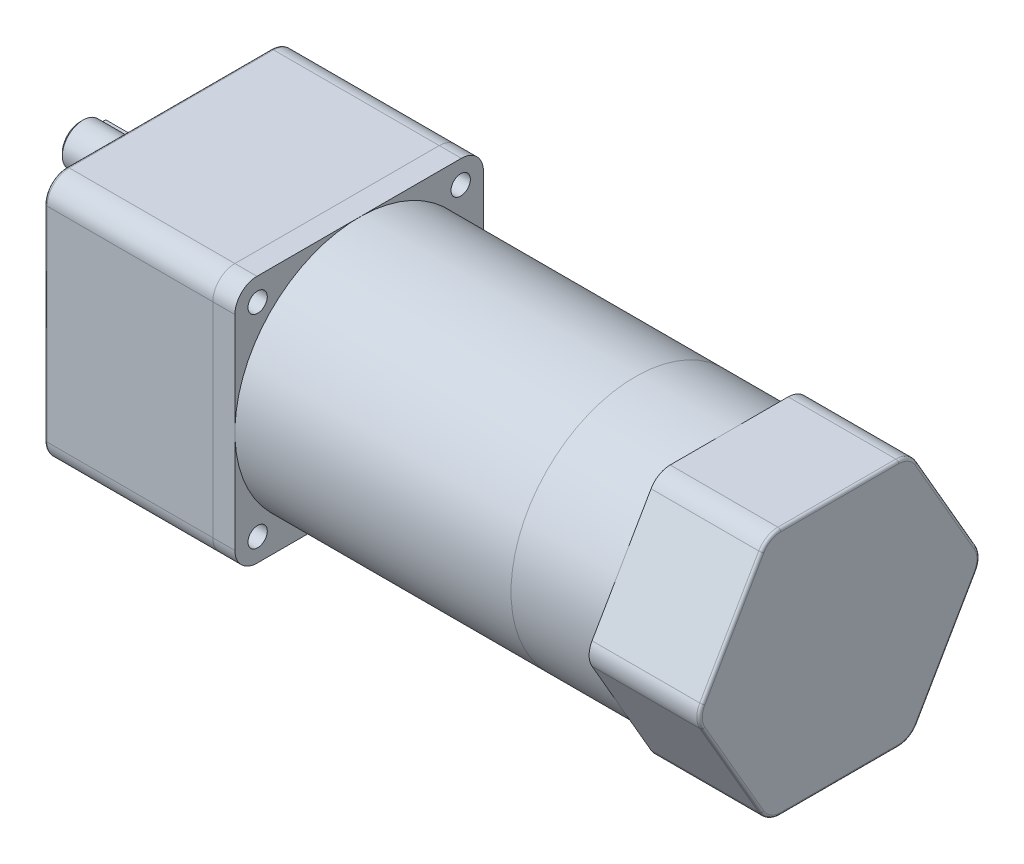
ISO-10303-21;
HEADER;
FILE_DESCRIPTION(('STEP AP214'),'2;1');
FILE_NAME('part.step','',(''),(''),'','','');
FILE_SCHEMA(('AUTOMOTIVE_DESIGN { 1 0 10303 214 1 1 1 1 }'));
ENDSEC;
DATA;
#1=APPLICATION_CONTEXT('core data for automotive mechanical design processes');
#2=APPLICATION_PROTOCOL_DEFINITION('international standard','automotive_design',2000,#1);
#3=PRODUCT_CONTEXT('',#1,'mechanical');
#4=PRODUCT('Part','Part','',(#3));
#5=PRODUCT_RELATED_PRODUCT_CATEGORY('part','',(#4));
#6=PRODUCT_DEFINITION_FORMATION('','',#4);
#7=PRODUCT_DEFINITION_CONTEXT('part definition',#1,'design');
#8=PRODUCT_DEFINITION('design','',#6,#7);
#9=PRODUCT_DEFINITION_SHAPE('','',#8);
#10=(LENGTH_UNIT() NAMED_UNIT(*) SI_UNIT(.MILLI.,.METRE.));
#11=(NAMED_UNIT(*) PLANE_ANGLE_UNIT() SI_UNIT($,.RADIAN.));
#12=(NAMED_UNIT(*) SI_UNIT($,.STERADIAN.) SOLID_ANGLE_UNIT());
#13=UNCERTAINTY_MEASURE_WITH_UNIT(LENGTH_MEASURE(1.E-05),#10,'distance_accuracy_value','');
#14=(GEOMETRIC_REPRESENTATION_CONTEXT(3) GLOBAL_UNCERTAINTY_ASSIGNED_CONTEXT((#13)) GLOBAL_UNIT_ASSIGNED_CONTEXT((#10,
#11,#12)) REPRESENTATION_CONTEXT('',''));
#15=CARTESIAN_POINT('',(0.,0.,0.));
#16=DIRECTION('',(0.,0.,1.));
#17=DIRECTION('',(1.,0.,0.));
#18=AXIS2_PLACEMENT_3D('',#15,#16,#17);
#19=CARTESIAN_POINT('',(-9.5,18.,-9.5));
#20=DIRECTION('',(0.,0.,1.));
#21=DIRECTION('',(1.,0.,0.));
#22=AXIS2_PLACEMENT_3D('',#19,#20,#21);
#23=CYLINDRICAL_SURFACE('',#22,2.5);
#24=DIRECTION('',(0.,0.,1.));
#25=VECTOR('',#24,1.);
#26=CARTESIAN_POINT('',(-9.5,15.5,-9.5));
#27=LINE('',#26,#25);
#28=CARTESIAN_POINT('',(-9.5,15.5,-9.2));
#29=VERTEX_POINT('',#28);
#30=CARTESIAN_POINT('',(-9.5,15.5,-4.5));
#31=VERTEX_POINT('',#30);
#32=EDGE_CURVE('E101',#29,#31,#27,.T.);
#33=ORIENTED_EDGE('',*,*,#32,.F.);
#34=CARTESIAN_POINT('',(-9.5,18.,-9.2));
#35=DIRECTION('',(0.,0.,-1.));
#36=DIRECTION('',(-1.,0.,0.));
#37=AXIS2_PLACEMENT_3D('',#34,#35,#36);
#38=CIRCLE('',#37,2.5);
#39=CARTESIAN_POINT('',(-9.5,20.5,-9.2));
#40=VERTEX_POINT('',#39);
#41=EDGE_CURVE('E144',#29,#40,#38,.F.);
#42=ORIENTED_EDGE('',*,*,#41,.T.);
#43=DIRECTION('',(0.,0.,1.));
#44=VECTOR('',#43,1.);
#45=CARTESIAN_POINT('',(-9.5,20.5,-9.5));
#46=LINE('',#45,#44);
#47=CARTESIAN_POINT('',(-9.5,20.5,-4.5));
#48=VERTEX_POINT('',#47);
#49=EDGE_CURVE('E123',#40,#48,#46,.T.);
#50=ORIENTED_EDGE('',*,*,#49,.T.);
#51=CARTESIAN_POINT('',(-9.5,18.,-4.5));
#52=DIRECTION('',(0.,0.,-1.));
#53=DIRECTION('',(-1.,0.,0.));
#54=AXIS2_PLACEMENT_3D('',#51,#52,#53);
#55=CIRCLE('',#54,2.5);
#56=EDGE_CURVE('E119',#48,#31,#55,.T.);
#57=ORIENTED_EDGE('',*,*,#56,.T.);
#58=EDGE_LOOP('',(#33,#42,#50,#57));
#59=FACE_BOUND('',#58,.T.);
#60=ADVANCED_FACE('F48',(#59),#23,.T.);
#61=CARTESIAN_POINT('',(-32.,15.5,-9.5));
#62=DIRECTION('',(0.,1.,0.));
#63=DIRECTION('',(-1.,0.,0.));
#64=AXIS2_PLACEMENT_3D('',#61,#62,#63);
#65=PLANE('',#64);
#66=DIRECTION('',(0.,0.,1.));
#67=VECTOR('',#66,1.);
#68=CARTESIAN_POINT('',(-32.,15.5,-9.5));
#69=LINE('',#68,#67);
#70=CARTESIAN_POINT('',(-32.,15.5,-9.2));
#71=VERTEX_POINT('',#70);
#72=CARTESIAN_POINT('',(-32.,15.5,-4.5));
#73=VERTEX_POINT('',#72);
#74=EDGE_CURVE('E113',#71,#73,#69,.T.);
#75=ORIENTED_EDGE('',*,*,#74,.F.);
#76=DIRECTION('',(1.,0.,0.));
#77=VECTOR('',#76,1.);
#78=CARTESIAN_POINT('',(-9.5,15.5,-9.2));
#79=LINE('',#78,#77);
#80=EDGE_CURVE('E107',#71,#29,#79,.T.);
#81=ORIENTED_EDGE('',*,*,#80,.T.);
#82=ORIENTED_EDGE('',*,*,#32,.T.);
#83=DIRECTION('',(-1.,0.,0.));
#84=VECTOR('',#83,1.);
#85=CARTESIAN_POINT('',(-32.,15.5,-4.5));
#86=LINE('',#85,#84);
#87=EDGE_CURVE('E104',#31,#73,#86,.T.);
#88=ORIENTED_EDGE('',*,*,#87,.T.);
#89=EDGE_LOOP('',(#75,#81,#82,#88));
#90=FACE_BOUND('',#89,.T.);
#91=ADVANCED_FACE('F103',(#90),#65,.F.);
#92=CARTESIAN_POINT('',(-32.,20.5,-9.5));
#93=DIRECTION('',(1.,0.,0.));
#94=DIRECTION('',(0.,0.,-1.));
#95=AXIS2_PLACEMENT_3D('',#92,#93,#94);
#96=PLANE('',#95);
#97=DIRECTION('',(0.,0.,1.));
#98=VECTOR('',#97,1.);
#99=CARTESIAN_POINT('',(-32.,20.5,-9.5));
#100=LINE('',#99,#98);
#101=CARTESIAN_POINT('',(-32.,20.5,-9.2));
#102=VERTEX_POINT('',#101);
#103=CARTESIAN_POINT('',(-32.,20.5,-4.5));
#104=VERTEX_POINT('',#103);
#105=EDGE_CURVE('E133',#102,#104,#100,.T.);
#106=ORIENTED_EDGE('',*,*,#105,.F.);
#107=DIRECTION('',(0.,-1.,0.));
#108=VECTOR('',#107,1.);
#109=CARTESIAN_POINT('',(-32.,15.5,-9.2));
#110=LINE('',#109,#108);
#111=EDGE_CURVE('E57',#102,#71,#110,.T.);
#112=ORIENTED_EDGE('',*,*,#111,.T.);
#113=ORIENTED_EDGE('',*,*,#74,.T.);
#114=DIRECTION('',(0.,1.,0.));
#115=VECTOR('',#114,1.);
#116=CARTESIAN_POINT('',(-32.,20.5,-4.5));
#117=LINE('',#116,#115);
#118=EDGE_CURVE('E121',#73,#104,#117,.T.);
#119=ORIENTED_EDGE('',*,*,#118,.T.);
#120=EDGE_LOOP('',(#106,#112,#113,#119));
#121=FACE_BOUND('',#120,.T.);
#122=ADVANCED_FACE('F168',(#121),#96,.F.);
#123=CARTESIAN_POINT('',(-9.5,20.5,-9.5));
#124=DIRECTION('',(0.,-1.,0.));
#125=DIRECTION('',(0.,0.,-1.));
#126=AXIS2_PLACEMENT_3D('',#123,#124,#125);
#127=PLANE('',#126);
#128=ORIENTED_EDGE('',*,*,#49,.F.);
#129=DIRECTION('',(-1.,0.,0.));
#130=VECTOR('',#129,1.);
#131=CARTESIAN_POINT('',(-32.,20.5,-9.2));
#132=LINE('',#131,#130);
#133=EDGE_CURVE('E12',#40,#102,#132,.T.);
#134=ORIENTED_EDGE('',*,*,#133,.T.);
#135=ORIENTED_EDGE('',*,*,#105,.T.);
#136=DIRECTION('',(1.,0.,0.));
#137=VECTOR('',#136,1.);
#138=CARTESIAN_POINT('',(-9.5,20.5,-4.5));
#139=LINE('',#138,#137);
#140=EDGE_CURVE('E130',#104,#48,#139,.T.);
#141=ORIENTED_EDGE('',*,*,#140,.T.);
#142=EDGE_LOOP('',(#128,#134,#135,#141));
#143=FACE_BOUND('',#142,.T.);
#144=ADVANCED_FACE('F167',(#143),#127,.F.);
#145=CARTESIAN_POINT('',(-9.5,18.,-9.5));
#146=DIRECTION('',(0.,0.,-1.));
#147=DIRECTION('',(-1.,0.,0.));
#148=AXIS2_PLACEMENT_3D('',#145,#146,#147);
#149=PLANE('',#148);
#150=DIRECTION('',(1.,0.,0.));
#151=VECTOR('',#150,1.);
#152=CARTESIAN_POINT('',(-9.5,20.2,-9.5));
#153=LINE('',#152,#151);
#154=CARTESIAN_POINT('',(-31.7,20.2,-9.5));
#155=VERTEX_POINT('',#154);
#156=CARTESIAN_POINT('',(-9.5,20.2,-9.5));
#157=VERTEX_POINT('',#156);
#158=EDGE_CURVE('E112',#155,#157,#153,.T.);
#159=ORIENTED_EDGE('',*,*,#158,.T.);
#160=CARTESIAN_POINT('',(-9.5,18.,-9.5));
#161=DIRECTION('',(0.,0.,-1.));
#162=DIRECTION('',(-1.,0.,0.));
#163=AXIS2_PLACEMENT_3D('',#160,#161,#162);
#164=CIRCLE('',#163,2.2);
#165=CARTESIAN_POINT('',(-9.5,15.8,-9.5));
#166=VERTEX_POINT('',#165);
#167=EDGE_CURVE('E141',#157,#166,#164,.T.);
#168=ORIENTED_EDGE('',*,*,#167,.T.);
#169=DIRECTION('',(-1.,0.,0.));
#170=VECTOR('',#169,1.);
#171=CARTESIAN_POINT('',(-32.,15.8,-9.5));
#172=LINE('',#171,#170);
#173=CARTESIAN_POINT('',(-31.7,15.8,-9.5));
#174=VERTEX_POINT('',#173);
#175=EDGE_CURVE('E139',#166,#174,#172,.T.);
#176=ORIENTED_EDGE('',*,*,#175,.T.);
#177=DIRECTION('',(0.,1.,0.));
#178=VECTOR('',#177,1.);
#179=CARTESIAN_POINT('',(-31.7,20.5,-9.5));
#180=LINE('',#179,#178);
#181=EDGE_CURVE('E137',#174,#155,#180,.T.);
#182=ORIENTED_EDGE('',*,*,#181,.T.);
#183=EDGE_LOOP('',(#159,#168,#176,#182));
#184=FACE_BOUND('',#183,.T.);
#185=ADVANCED_FACE('F162',(#184),#149,.T.);
#186=CARTESIAN_POINT('',(-9.5,18.,-4.5));
#187=DIRECTION('',(0.,0.,-1.));
#188=DIRECTION('',(-1.,0.,0.));
#189=AXIS2_PLACEMENT_3D('',#186,#187,#188);
#190=PLANE('',#189);
#191=ORIENTED_EDGE('',*,*,#56,.F.);
#192=ORIENTED_EDGE('',*,*,#140,.F.);
#193=ORIENTED_EDGE('',*,*,#118,.F.);
#194=ORIENTED_EDGE('',*,*,#87,.F.);
#195=EDGE_LOOP('',(#191,#192,#193,#194));
#196=FACE_BOUND('',#195,.T.);
#197=ADVANCED_FACE('F117',(#196),#190,.F.);
#198=CARTESIAN_POINT('',(-31.7,18.,-9.5));
#199=DIRECTION('',(-0.707106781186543,0.,-0.707106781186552));
#200=DIRECTION('',(0.,-1.,0.));
#201=AXIS2_PLACEMENT_3D('',#198,#199,#200);
#202=PLANE('',#201);
#203=DIRECTION('',(-0.577350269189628,-0.577350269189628,0.577350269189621));
#204=VECTOR('',#203,1.);
#205=CARTESIAN_POINT('',(-30.9666666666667,16.5333333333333,-10.2333333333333));
#206=LINE('',#205,#204);
#207=EDGE_CURVE('E127',#71,#174,#206,.F.);
#208=ORIENTED_EDGE('',*,*,#207,.F.);
#209=ORIENTED_EDGE('',*,*,#111,.F.);
#210=DIRECTION('',(-0.577350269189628,0.577350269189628,0.577350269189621));
#211=VECTOR('',#210,1.);
#212=CARTESIAN_POINT('',(-24.2999999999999,12.7999999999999,-16.9));
#213=LINE('',#212,#211);
#214=EDGE_CURVE('E52',#155,#102,#213,.T.);
#215=ORIENTED_EDGE('',*,*,#214,.F.);
#216=ORIENTED_EDGE('',*,*,#181,.F.);
#217=EDGE_LOOP('',(#208,#209,#215,#216));
#218=FACE_BOUND('',#217,.T.);
#219=ADVANCED_FACE('F50',(#218),#202,.T.);
#220=CARTESIAN_POINT('',(-9.5,20.2,-9.5));
#221=DIRECTION('',(0.,0.707106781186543,-0.707106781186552));
#222=DIRECTION('',(-1.,0.,0.));
#223=AXIS2_PLACEMENT_3D('',#220,#221,#222);
#224=PLANE('',#223);
#225=ORIENTED_EDGE('',*,*,#214,.T.);
#226=ORIENTED_EDGE('',*,*,#133,.F.);
#227=DIRECTION('',(0.,0.707106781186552,0.707106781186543));
#228=VECTOR('',#227,1.);
#229=CARTESIAN_POINT('',(-9.5,20.2,-9.5));
#230=LINE('',#229,#228);
#231=EDGE_CURVE('E150',#157,#40,#230,.T.);
#232=ORIENTED_EDGE('',*,*,#231,.F.);
#233=ORIENTED_EDGE('',*,*,#158,.F.);
#234=EDGE_LOOP('',(#225,#226,#232,#233));
#235=FACE_BOUND('',#234,.T.);
#236=ADVANCED_FACE('F185',(#235),#224,.T.);
#237=CARTESIAN_POINT('',(-9.5,15.8,-9.5));
#238=DIRECTION('',(0.,-0.707106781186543,-0.707106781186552));
#239=DIRECTION('',(1.,0.,0.));
#240=AXIS2_PLACEMENT_3D('',#237,#238,#239);
#241=PLANE('',#240);
#242=ORIENTED_EDGE('',*,*,#207,.T.);
#243=ORIENTED_EDGE('',*,*,#175,.F.);
#244=DIRECTION('',(0.,0.707106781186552,-0.707106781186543));
#245=VECTOR('',#244,1.);
#246=CARTESIAN_POINT('',(-9.5,15.5,-9.2));
#247=LINE('',#246,#245);
#248=EDGE_CURVE('E148',#29,#166,#247,.T.);
#249=ORIENTED_EDGE('',*,*,#248,.F.);
#250=ORIENTED_EDGE('',*,*,#80,.F.);
#251=EDGE_LOOP('',(#242,#243,#249,#250));
#252=FACE_BOUND('',#251,.T.);
#253=ADVANCED_FACE('F155',(#252),#241,.T.);
#254=CARTESIAN_POINT('',(-9.5,18.,-9.5));
#255=DIRECTION('',(0.,0.,1.));
#256=DIRECTION('',(1.,0.,0.));
#257=AXIS2_PLACEMENT_3D('',#254,#255,#256);
#258=CONICAL_SURFACE('',#257,2.2,0.785398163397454);
#259=ORIENTED_EDGE('',*,*,#231,.T.);
#260=ORIENTED_EDGE('',*,*,#41,.F.);
#261=ORIENTED_EDGE('',*,*,#248,.T.);
#262=ORIENTED_EDGE('',*,*,#167,.F.);
#263=EDGE_LOOP('',(#259,#260,#261,#262));
#264=FACE_BOUND('',#263,.T.);
#265=ADVANCED_FACE('F166',(#264),#258,.T.);
#266=CLOSED_SHELL('',(#60,#91,#122,#144,#185,#197,#219,#236,#253,#265));
#267=MANIFOLD_SOLID_BREP('B2',#266);
#268=CARTESIAN_POINT('',(-32.,18.,0.));
#269=DIRECTION('',(1.,0.,0.));
#270=DIRECTION('',(0.,0.,-1.));
#271=AXIS2_PLACEMENT_3D('',#268,#269,#270);
#272=CYLINDRICAL_SURFACE('',#271,7.5);
#273=CARTESIAN_POINT('',(-3.,18.,0.));
#274=DIRECTION('',(-1.,0.,0.));
#275=DIRECTION('',(0.,0.,1.));
#276=AXIS2_PLACEMENT_3D('',#273,#274,#275);
#277=CIRCLE('',#276,7.5);
#278=CARTESIAN_POINT('',(-3.,18.,7.5));
#279=VERTEX_POINT('',#278);
#280=EDGE_CURVE('E342',#279,#279,#277,.T.);
#281=ORIENTED_EDGE('',*,*,#280,.T.);
#282=EDGE_LOOP('',(#281));
#283=FACE_BOUND('',#282,.T.);
#284=DIRECTION('',(1.,0.,0.));
#285=VECTOR('',#284,1.);
#286=CARTESIAN_POINT('',(-32.,20.5,-7.07106781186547));
#287=LINE('',#286,#285);
#288=CARTESIAN_POINT('',(-31.,20.5,-7.07106781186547));
#289=VERTEX_POINT('',#288);
#290=CARTESIAN_POINT('',(-9.5,20.5,-7.07106781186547));
#291=VERTEX_POINT('',#290);
#292=EDGE_CURVE('E331',#289,#291,#287,.T.);
#293=ORIENTED_EDGE('',*,*,#292,.F.);
#294=CARTESIAN_POINT('',(-31.,18.,0.));
#295=DIRECTION('',(-1.,0.,0.));
#296=DIRECTION('',(0.,0.,1.));
#297=AXIS2_PLACEMENT_3D('',#294,#295,#296);
#298=CIRCLE('',#297,7.5);
#299=CARTESIAN_POINT('',(-31.,15.5,-7.07106781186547));
#300=VERTEX_POINT('',#299);
#301=EDGE_CURVE('E275',#289,#300,#298,.F.);
#302=ORIENTED_EDGE('',*,*,#301,.T.);
#303=DIRECTION('',(1.,0.,0.));
#304=VECTOR('',#303,1.);
#305=CARTESIAN_POINT('',(-32.,15.5,-7.07106781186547));
#306=LINE('',#305,#304);
#307=CARTESIAN_POINT('',(-9.5,15.5,-7.07106781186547));
#308=VERTEX_POINT('',#307);
#309=EDGE_CURVE('E333',#308,#300,#306,.F.);
#310=ORIENTED_EDGE('',*,*,#309,.F.);
#311=CARTESIAN_POINT('',(-9.5,20.5,-7.07106781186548));
#312=CARTESIAN_POINT('',(-9.43179292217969,20.5000089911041,-7.07105693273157));
#313=CARTESIAN_POINT('',(-9.36359192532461,20.4972088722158,-7.07205443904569));
#314=CARTESIAN_POINT('',(-9.22771896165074,20.4860604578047,-7.07598524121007));
#315=CARTESIAN_POINT('',(-9.16004685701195,20.477713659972,-7.07891801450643));
#316=CARTESIAN_POINT('',(-9.02590951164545,20.455574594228,-7.08662705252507));
#317=CARTESIAN_POINT('',(-8.95944129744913,20.4417984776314,-7.09139784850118));
#318=CARTESIAN_POINT('',(-8.8279917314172,20.4089418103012,-7.10262619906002));
#319=CARTESIAN_POINT('',(-8.7630104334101,20.3898610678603,-7.10908381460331));
#320=CARTESIAN_POINT('',(-8.57103842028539,20.324915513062,-7.13069940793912));
#321=CARTESIAN_POINT('',(-8.44682084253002,20.2713141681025,-7.14811243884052));
#322=CARTESIAN_POINT('',(-8.20912318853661,20.1451778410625,-7.1869703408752));
#323=CARTESIAN_POINT('',(-8.09564976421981,20.0726312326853,-7.20841768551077));
#324=CARTESIAN_POINT('',(-7.8782070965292,19.9076299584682,-7.25386182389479));
#325=CARTESIAN_POINT('',(-7.7747148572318,19.8145628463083,-7.27792189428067));
#326=CARTESIAN_POINT('',(-7.5844828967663,19.6124707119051,-7.32534626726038));
#327=CARTESIAN_POINT('',(-7.497746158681,19.5034428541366,-7.34871044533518));
#328=CARTESIAN_POINT('',(-7.34130177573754,19.2690092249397,-7.39284706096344));
#329=CARTESIAN_POINT('',(-7.27209769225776,19.1432502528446,-7.41353593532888));
#330=CARTESIAN_POINT('',(-7.1560192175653,18.8810730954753,-7.44924021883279));
#331=CARTESIAN_POINT('',(-7.10913800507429,18.7446581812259,-7.46425736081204));
#332=CARTESIAN_POINT('',(-7.04066072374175,18.4700733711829,-7.48647677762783));
#333=CARTESIAN_POINT('',(-7.01824182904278,18.3321295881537,-7.49393272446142));
#334=CARTESIAN_POINT('',(-6.99670924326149,18.0542474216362,-7.50109021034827));
#335=CARTESIAN_POINT('',(-6.99758999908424,17.9143095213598,-7.50079359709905));
#336=CARTESIAN_POINT('',(-7.0221107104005,17.6422403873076,-7.49265096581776));
#337=CARTESIAN_POINT('',(-7.04485659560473,17.5100182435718,-7.48510152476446));
#338=CARTESIAN_POINT('',(-7.1109829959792,17.2513898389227,-7.46367401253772));
#339=CARTESIAN_POINT('',(-7.15436465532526,17.1249839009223,-7.44979559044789));
#340=CARTESIAN_POINT('',(-7.26105342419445,16.8796184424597,-7.41689170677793));
#341=CARTESIAN_POINT('',(-7.32461511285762,16.760778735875,-7.39780094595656));
#342=CARTESIAN_POINT('',(-7.46964987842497,16.5351885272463,-7.35645969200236));
#343=CARTESIAN_POINT('',(-7.55112782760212,16.4284413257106,-7.33420833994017));
#344=CARTESIAN_POINT('',(-7.73417762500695,16.2247566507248,-7.28765679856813));
#345=CARTESIAN_POINT('',(-7.83651385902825,16.128515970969,-7.26330946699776));
#346=CARTESIAN_POINT('',(-8.05610372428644,15.9543199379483,-7.21618726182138));
#347=CARTESIAN_POINT('',(-8.17336215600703,15.8763704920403,-7.19341289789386));
#348=CARTESIAN_POINT('',(-8.42170044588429,15.7399916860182,-7.15175078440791));
#349=CARTESIAN_POINT('',(-8.55295878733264,15.6818674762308,-7.13292537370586));
#350=CARTESIAN_POINT('',(-8.8241174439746,15.5888494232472,-7.10202742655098));
#351=CARTESIAN_POINT('',(-8.96400373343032,15.5539189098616,-7.08994423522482));
#352=CARTESIAN_POINT('',(-9.17104659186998,15.5208546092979,-7.078413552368));
#353=CARTESIAN_POINT('',(-9.23660347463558,15.5130373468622,-7.07566669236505));
#354=CARTESIAN_POINT('',(-9.36809519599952,15.502613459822,-7.07199258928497));
#355=CARTESIAN_POINT('',(-9.43402943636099,15.5000001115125,-7.0710629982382));
#356=CARTESIAN_POINT('',(-9.5,15.5,-7.07106781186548));
#357=B_SPLINE_CURVE_WITH_KNOTS('',3,(#311,#312,#313,#314,#315,#316,#317,#318,#319,#320,#321,
#322,#323,#324,#325,#326,#327,#328,#329,#330,#331,#332,#333,#334,#335,#336,#337,#338,#339,#340,
#341,#342,#343,#344,#345,#346,#347,#348,#349,#350,#351,#352,#353,#354,#355,#356),.UNSPECIFIED.,
.F.,.F.,(4,2,2,2,2,2,2,2,2,2,2,2,2,2,2,2,2,2,2,2,2,2,4),(0.,0.20454621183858,0.409037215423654,
0.612924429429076,0.816819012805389,1.22401016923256,1.63145179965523,2.0532786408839,
2.47518051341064,2.90809434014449,3.34087579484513,3.75860278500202,4.17623021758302,
4.57747647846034,4.97874498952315,5.38529148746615,5.79194868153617,6.21771736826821,
6.64362337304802,7.07581676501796,7.50732520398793,7.70536340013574,7.90314555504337),.UNSPECIFIED.);
#358=EDGE_CURVE('E345',#291,#308,#357,.T.);
#359=ORIENTED_EDGE('',*,*,#358,.F.);
#360=EDGE_LOOP('',(#293,#302,#310,#359));
#361=FACE_BOUND('',#360,.T.);
#362=ADVANCED_FACE('F262',(#283,#361),#272,.T.);
#363=CARTESIAN_POINT('',(-32.,18.,0.));
#364=DIRECTION('',(-1.,0.,0.));
#365=DIRECTION('',(0.,0.,1.));
#366=AXIS2_PLACEMENT_3D('',#363,#364,#365);
#367=PLANE('',#366);
#368=DIRECTION('',(0.,0.,-1.));
#369=VECTOR('',#368,1.);
#370=CARTESIAN_POINT('',(-32.,15.5,-4.5));
#371=LINE('',#370,#369);
#372=CARTESIAN_POINT('',(-32.,15.5,-4.5));
#373=VERTEX_POINT('',#372);
#374=CARTESIAN_POINT('',(-32.,15.5,-6.00000000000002));
#375=VERTEX_POINT('',#374);
#376=EDGE_CURVE('E337',#373,#375,#371,.T.);
#377=ORIENTED_EDGE('',*,*,#376,.T.);
#378=CARTESIAN_POINT('',(-32.,18.,0.));
#379=DIRECTION('',(-1.,0.,0.));
#380=DIRECTION('',(0.,0.,1.));
#381=AXIS2_PLACEMENT_3D('',#378,#379,#380);
#382=CIRCLE('',#381,6.50000000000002);
#383=CARTESIAN_POINT('',(-32.,20.5,-6.00000000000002));
#384=VERTEX_POINT('',#383);
#385=EDGE_CURVE('E351',#375,#384,#382,.T.);
#386=ORIENTED_EDGE('',*,*,#385,.T.);
#387=DIRECTION('',(0.,0.,-1.));
#388=VECTOR('',#387,1.);
#389=CARTESIAN_POINT('',(-32.,20.5,-4.5));
#390=LINE('',#389,#388);
#391=CARTESIAN_POINT('',(-32.,20.5,-4.5));
#392=VERTEX_POINT('',#391);
#393=EDGE_CURVE('E334',#392,#384,#390,.T.);
#394=ORIENTED_EDGE('',*,*,#393,.F.);
#395=DIRECTION('',(0.,-1.,0.));
#396=VECTOR('',#395,1.);
#397=CARTESIAN_POINT('',(-32.,20.5,-4.5));
#398=LINE('',#397,#396);
#399=EDGE_CURVE('E318',#392,#373,#398,.T.);
#400=ORIENTED_EDGE('',*,*,#399,.T.);
#401=EDGE_LOOP('',(#377,#386,#394,#400));
#402=FACE_BOUND('',#401,.T.);
#403=ADVANCED_FACE('F361',(#402),#367,.T.);
#404=CARTESIAN_POINT('',(-3.,18.,0.));
#405=DIRECTION('',(-1.,0.,0.));
#406=DIRECTION('',(0.,0.,1.));
#407=AXIS2_PLACEMENT_3D('',#404,#405,#406);
#408=PLANE('',#407);
#409=ORIENTED_EDGE('',*,*,#280,.F.);
#410=EDGE_LOOP('',(#409));
#411=FACE_BOUND('',#410,.T.);
#412=ADVANCED_FACE('F359',(#411),#408,.F.);
#413=CARTESIAN_POINT('',(-9.5,18.,-4.5));
#414=DIRECTION('',(0.,0.,-1.));
#415=DIRECTION('',(-1.,0.,0.));
#416=AXIS2_PLACEMENT_3D('',#413,#414,#415);
#417=CYLINDRICAL_SURFACE('',#416,2.5);
#418=DIRECTION('',(0.,0.,-1.));
#419=VECTOR('',#418,1.);
#420=CARTESIAN_POINT('',(-9.5,20.5,-4.5));
#421=LINE('',#420,#419);
#422=CARTESIAN_POINT('',(-9.5,20.5,-4.5));
#423=VERTEX_POINT('',#422);
#424=EDGE_CURVE('E326',#423,#291,#421,.T.);
#425=ORIENTED_EDGE('',*,*,#424,.T.);
#426=ORIENTED_EDGE('',*,*,#358,.T.);
#427=DIRECTION('',(0.,0.,-1.));
#428=VECTOR('',#427,1.);
#429=CARTESIAN_POINT('',(-9.5,15.5,-4.5));
#430=LINE('',#429,#428);
#431=CARTESIAN_POINT('',(-9.5,15.5,-4.5));
#432=VERTEX_POINT('',#431);
#433=EDGE_CURVE('E328',#432,#308,#430,.T.);
#434=ORIENTED_EDGE('',*,*,#433,.F.);
#435=CARTESIAN_POINT('',(-9.5,18.,-4.5));
#436=DIRECTION('',(0.,0.,1.));
#437=DIRECTION('',(1.,0.,0.));
#438=AXIS2_PLACEMENT_3D('',#435,#436,#437);
#439=CIRCLE('',#438,2.5);
#440=EDGE_CURVE('E316',#432,#423,#439,.T.);
#441=ORIENTED_EDGE('',*,*,#440,.T.);
#442=EDGE_LOOP('',(#425,#426,#434,#441));
#443=FACE_BOUND('',#442,.T.);
#444=ADVANCED_FACE('F325',(#443),#417,.F.);
#445=CARTESIAN_POINT('',(-9.5,20.5,-4.5));
#446=DIRECTION('',(0.,-1.,0.));
#447=DIRECTION('',(0.,0.,-1.));
#448=AXIS2_PLACEMENT_3D('',#445,#446,#447);
#449=PLANE('',#448);
#450=ORIENTED_EDGE('',*,*,#393,.T.);
#451=CARTESIAN_POINT('',(-32.,20.5,-6.00000000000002));
#452=CARTESIAN_POINT('',(-31.9171731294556,20.5,-6.0897273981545));
#453=CARTESIAN_POINT('',(-31.8341996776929,20.5,-6.17931930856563));
#454=CARTESIAN_POINT('',(-31.6679908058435,20.5,-6.35825867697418));
#455=CARTESIAN_POINT('',(-31.5847553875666,20.5,-6.44760613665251));
#456=CARTESIAN_POINT('',(-31.4180527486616,20.5,-6.62608424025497));
#457=CARTESIAN_POINT('',(-31.3345855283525,20.5,-6.7152148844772));
#458=CARTESIAN_POINT('',(-31.1674427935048,20.5,-6.89328182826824));
#459=CARTESIAN_POINT('',(-31.0837672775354,20.5,-6.98221812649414));
#460=CARTESIAN_POINT('',(-31.,20.5,-7.07106781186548));
#461=B_SPLINE_CURVE_WITH_KNOTS('',3,(#451,#452,#453,#454,#455,#456,#457,#458,#459,#460),
.UNSPECIFIED.,.F.,.F.,(4,2,2,2,4),(0.,0.366335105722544,0.732667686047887,1.0989997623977,
1.46533436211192),.UNSPECIFIED.);
#462=EDGE_CURVE('E289',#384,#289,#461,.T.);
#463=ORIENTED_EDGE('',*,*,#462,.T.);
#464=ORIENTED_EDGE('',*,*,#292,.T.);
#465=ORIENTED_EDGE('',*,*,#424,.F.);
#466=DIRECTION('',(-1.,0.,0.));
#467=VECTOR('',#466,1.);
#468=CARTESIAN_POINT('',(-9.5,20.5,-4.5));
#469=LINE('',#468,#467);
#470=EDGE_CURVE('E313',#423,#392,#469,.T.);
#471=ORIENTED_EDGE('',*,*,#470,.T.);
#472=EDGE_LOOP('',(#450,#463,#464,#465,#471));
#473=FACE_BOUND('',#472,.T.);
#474=ADVANCED_FACE('F330',(#473),#449,.T.);
#475=CARTESIAN_POINT('',(-32.,15.5,-4.5));
#476=DIRECTION('',(0.,1.,0.));
#477=DIRECTION('',(0.,0.,1.));
#478=AXIS2_PLACEMENT_3D('',#475,#476,#477);
#479=PLANE('',#478);
#480=ORIENTED_EDGE('',*,*,#309,.T.);
#481=CARTESIAN_POINT('',(-31.,15.5,-7.07106781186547));
#482=CARTESIAN_POINT('',(-31.0837672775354,15.5,-6.98221812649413));
#483=CARTESIAN_POINT('',(-31.1674427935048,15.5,-6.89328182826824));
#484=CARTESIAN_POINT('',(-31.3345855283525,15.5,-6.7152148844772));
#485=CARTESIAN_POINT('',(-31.4180527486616,15.5,-6.62608424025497));
#486=CARTESIAN_POINT('',(-31.5847553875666,15.5,-6.44760613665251));
#487=CARTESIAN_POINT('',(-31.6679908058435,15.5,-6.35825867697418));
#488=CARTESIAN_POINT('',(-31.8341996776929,15.5,-6.17931930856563));
#489=CARTESIAN_POINT('',(-31.9171731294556,15.5,-6.08972739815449));
#490=CARTESIAN_POINT('',(-32.,15.5,-6.00000000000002));
#491=B_SPLINE_CURVE_WITH_KNOTS('',3,(#481,#482,#483,#484,#485,#486,#487,#488,#489,#490),
.UNSPECIFIED.,.F.,.F.,(4,2,2,2,4),(0.,0.366334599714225,0.732666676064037,1.09899925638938,
1.46533436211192),.UNSPECIFIED.);
#492=EDGE_CURVE('E46',#300,#375,#491,.T.);
#493=ORIENTED_EDGE('',*,*,#492,.T.);
#494=ORIENTED_EDGE('',*,*,#376,.F.);
#495=DIRECTION('',(1.,0.,0.));
#496=VECTOR('',#495,1.);
#497=CARTESIAN_POINT('',(-32.,15.5,-4.5));
#498=LINE('',#497,#496);
#499=EDGE_CURVE('E383',#373,#432,#498,.T.);
#500=ORIENTED_EDGE('',*,*,#499,.T.);
#501=ORIENTED_EDGE('',*,*,#433,.T.);
#502=EDGE_LOOP('',(#480,#493,#494,#500,#501));
#503=FACE_BOUND('',#502,.T.);
#504=ADVANCED_FACE('F387',(#503),#479,.T.);
#505=CARTESIAN_POINT('',(-9.5,18.,-4.5));
#506=DIRECTION('',(0.,0.,1.));
#507=DIRECTION('',(1.,0.,0.));
#508=AXIS2_PLACEMENT_3D('',#505,#506,#507);
#509=PLANE('',#508);
#510=ORIENTED_EDGE('',*,*,#440,.F.);
#511=ORIENTED_EDGE('',*,*,#499,.F.);
#512=ORIENTED_EDGE('',*,*,#399,.F.);
#513=ORIENTED_EDGE('',*,*,#470,.F.);
#514=EDGE_LOOP('',(#510,#511,#512,#513));
#515=FACE_BOUND('',#514,.T.);
#516=ADVANCED_FACE('F315',(#515),#509,.F.);
#517=CARTESIAN_POINT('',(-32.,18.,0.));
#518=DIRECTION('',(1.,0.,0.));
#519=DIRECTION('',(0.,0.,-1.));
#520=AXIS2_PLACEMENT_3D('',#517,#518,#519);
#521=CONICAL_SURFACE('',#520,6.50000000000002,0.785398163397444);
#522=ORIENTED_EDGE('',*,*,#492,.F.);
#523=ORIENTED_EDGE('',*,*,#301,.F.);
#524=ORIENTED_EDGE('',*,*,#462,.F.);
#525=ORIENTED_EDGE('',*,*,#385,.F.);
#526=EDGE_LOOP('',(#522,#523,#524,#525));
#527=FACE_BOUND('',#526,.T.);
#528=ADVANCED_FACE('F264',(#527),#521,.T.);
#529=CLOSED_SHELL('',(#362,#403,#412,#444,#474,#504,#516,#528));
#530=MANIFOLD_SOLID_BREP('B6',#529);
#531=CARTESIAN_POINT('',(0.,-37.,37.));
#532=DIRECTION('',(-1.,0.,0.));
#533=DIRECTION('',(0.,0.,1.));
#534=AXIS2_PLACEMENT_3D('',#531,#532,#533);
#535=PLANE('',#534);
#536=CARTESIAN_POINT('',(0.,0.,0.));
#537=DIRECTION('',(-1.,0.,0.));
#538=DIRECTION('',(0.,0.,1.));
#539=AXIS2_PLACEMENT_3D('',#536,#537,#538);
#540=CIRCLE('',#539,41.9);
#541=CARTESIAN_POINT('',(0.,0.,41.9));
#542=VERTEX_POINT('',#541);
#543=EDGE_CURVE('E260',#542,#542,#540,.F.);
#544=ORIENTED_EDGE('',*,*,#543,.T.);
#545=EDGE_LOOP('',(#544));
#546=FACE_BOUND('',#545,.T.);
#547=CARTESIAN_POINT('',(0.,-37.,-37.));
#548=DIRECTION('',(-1.,0.,0.));
#549=DIRECTION('',(0.,0.,1.));
#550=AXIS2_PLACEMENT_3D('',#547,#548,#549);
#551=CIRCLE('',#550,7.);
#552=CARTESIAN_POINT('',(0.,-37.,-44.));
#553=VERTEX_POINT('',#552);
#554=CARTESIAN_POINT('',(0.,-44.,-36.9999999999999));
#555=VERTEX_POINT('',#554);
#556=EDGE_CURVE('E613',#553,#555,#551,.T.);
#557=ORIENTED_EDGE('',*,*,#556,.T.);
#558=DIRECTION('',(0.,0.,-1.));
#559=VECTOR('',#558,1.);
#560=CARTESIAN_POINT('',(0.,-44.,37.));
#561=LINE('',#560,#559);
#562=CARTESIAN_POINT('',(0.,-44.,37.));
#563=VERTEX_POINT('',#562);
#564=EDGE_CURVE('E609',#555,#563,#561,.F.);
#565=ORIENTED_EDGE('',*,*,#564,.T.);
#566=CARTESIAN_POINT('',(0.,-37.,37.));
#567=DIRECTION('',(-1.,0.,0.));
#568=DIRECTION('',(0.,0.,1.));
#569=AXIS2_PLACEMENT_3D('',#566,#567,#568);
#570=CIRCLE('',#569,7.);
#571=CARTESIAN_POINT('',(0.,-37.,44.));
#572=VERTEX_POINT('',#571);
#573=EDGE_CURVE('E612',#563,#572,#570,.T.);
#574=ORIENTED_EDGE('',*,*,#573,.T.);
#575=DIRECTION('',(0.,-1.,0.));
#576=VECTOR('',#575,1.);
#577=CARTESIAN_POINT('',(0.,36.9999999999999,44.));
#578=LINE('',#577,#576);
#579=CARTESIAN_POINT('',(0.,36.9999999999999,44.));
#580=VERTEX_POINT('',#579);
#581=EDGE_CURVE('E576',#572,#580,#578,.F.);
#582=ORIENTED_EDGE('',*,*,#581,.T.);
#583=CARTESIAN_POINT('',(0.,37.,37.));
#584=DIRECTION('',(-1.,0.,0.));
#585=DIRECTION('',(0.,0.,1.));
#586=AXIS2_PLACEMENT_3D('',#583,#584,#585);
#587=CIRCLE('',#586,7.);
#588=CARTESIAN_POINT('',(0.,44.,37.));
#589=VERTEX_POINT('',#588);
#590=EDGE_CURVE('E620',#580,#589,#587,.T.);
#591=ORIENTED_EDGE('',*,*,#590,.T.);
#592=DIRECTION('',(0.,0.,1.));
#593=VECTOR('',#592,1.);
#594=CARTESIAN_POINT('',(0.,44.,-36.9999999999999));
#595=LINE('',#594,#593);
#596=CARTESIAN_POINT('',(0.,44.,-36.9999999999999));
#597=VERTEX_POINT('',#596);
#598=EDGE_CURVE('E618',#589,#597,#595,.F.);
#599=ORIENTED_EDGE('',*,*,#598,.T.);
#600=CARTESIAN_POINT('',(0.,37.,-37.));
#601=DIRECTION('',(-1.,0.,0.));
#602=DIRECTION('',(0.,0.,1.));
#603=AXIS2_PLACEMENT_3D('',#600,#601,#602);
#604=CIRCLE('',#603,7.);
#605=CARTESIAN_POINT('',(0.,36.9999999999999,-44.));
#606=VERTEX_POINT('',#605);
#607=EDGE_CURVE('E616',#597,#606,#604,.T.);
#608=ORIENTED_EDGE('',*,*,#607,.T.);
#609=DIRECTION('',(0.,1.,0.));
#610=VECTOR('',#609,1.);
#611=CARTESIAN_POINT('',(0.,-37.,-44.));
#612=LINE('',#611,#610);
#613=EDGE_CURVE('E570',#606,#553,#612,.F.);
#614=ORIENTED_EDGE('',*,*,#613,.T.);
#615=EDGE_LOOP('',(#557,#565,#574,#582,#591,#599,#608,#614));
#616=FACE_BOUND('',#615,.T.);
#617=CARTESIAN_POINT('',(0.,-36.7695526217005,-36.7695526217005));
#618=DIRECTION('',(-1.,0.,0.));
#619=DIRECTION('',(0.,0.,1.));
#620=AXIS2_PLACEMENT_3D('',#617,#618,#619);
#621=CIRCLE('',#620,2.49999999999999);
#622=CARTESIAN_POINT('',(0.,-36.7695526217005,-34.2695526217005));
#623=VERTEX_POINT('',#622);
#624=EDGE_CURVE('E657',#623,#623,#621,.T.);
#625=ORIENTED_EDGE('',*,*,#624,.F.);
#626=EDGE_LOOP('',(#625));
#627=FACE_BOUND('',#626,.T.);
#628=CARTESIAN_POINT('',(0.,36.7695526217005,-36.7695526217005));
#629=DIRECTION('',(-1.,0.,0.));
#630=DIRECTION('',(0.,0.,1.));
#631=AXIS2_PLACEMENT_3D('',#628,#629,#630);
#632=CIRCLE('',#631,2.49999999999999);
#633=CARTESIAN_POINT('',(0.,36.7695526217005,-34.2695526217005));
#634=VERTEX_POINT('',#633);
#635=EDGE_CURVE('E663',#634,#634,#632,.T.);
#636=ORIENTED_EDGE('',*,*,#635,.F.);
#637=EDGE_LOOP('',(#636));
#638=FACE_BOUND('',#637,.T.);
#639=CARTESIAN_POINT('',(0.,-36.7695526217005,36.7695526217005));
#640=DIRECTION('',(-1.,0.,0.));
#641=DIRECTION('',(0.,0.,1.));
#642=AXIS2_PLACEMENT_3D('',#639,#640,#641);
#643=CIRCLE('',#642,2.49999999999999);
#644=CARTESIAN_POINT('',(0.,-36.7695526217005,39.2695526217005));
#645=VERTEX_POINT('',#644);
#646=EDGE_CURVE('E669',#645,#645,#643,.T.);
#647=ORIENTED_EDGE('',*,*,#646,.F.);
#648=EDGE_LOOP('',(#647));
#649=FACE_BOUND('',#648,.T.);
#650=CARTESIAN_POINT('',(0.,36.7695526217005,36.7695526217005));
#651=DIRECTION('',(-1.,0.,0.));
#652=DIRECTION('',(0.,0.,1.));
#653=AXIS2_PLACEMENT_3D('',#650,#651,#652);
#654=CIRCLE('',#653,2.49999999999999);
#655=CARTESIAN_POINT('',(0.,36.7695526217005,39.2695526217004));
#656=VERTEX_POINT('',#655);
#657=EDGE_CURVE('E675',#656,#656,#654,.T.);
#658=ORIENTED_EDGE('',*,*,#657,.F.);
#659=EDGE_LOOP('',(#658));
#660=FACE_BOUND('',#659,.T.);
#661=ADVANCED_FACE('F452',(#546,#616,#627,#638,#649,#660),#535,.T.);
#662=CARTESIAN_POINT('',(61.,-37.,37.));
#663=DIRECTION('',(-1.,0.,0.));
#664=DIRECTION('',(0.,0.,1.));
#665=AXIS2_PLACEMENT_3D('',#662,#663,#664);
#666=CYLINDRICAL_SURFACE('',#665,8.);
#667=DIRECTION('',(-1.,0.,0.));
#668=VECTOR('',#667,1.);
#669=CARTESIAN_POINT('',(61.,-37.,45.));
#670=LINE('',#669,#668);
#671=CARTESIAN_POINT('',(61.,-37.,45.));
#672=VERTEX_POINT('',#671);
#673=CARTESIAN_POINT('',(1.00000000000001,-37.,45.));
#674=VERTEX_POINT('',#673);
#675=EDGE_CURVE('E552',#672,#674,#670,.T.);
#676=ORIENTED_EDGE('',*,*,#675,.T.);
#677=CARTESIAN_POINT('',(1.,-37.,37.));
#678=DIRECTION('',(-1.,0.,0.));
#679=DIRECTION('',(0.,0.,1.));
#680=AXIS2_PLACEMENT_3D('',#677,#678,#679);
#681=CIRCLE('',#680,8.);
#682=CARTESIAN_POINT('',(1.00000000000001,-45.,37.));
#683=VERTEX_POINT('',#682);
#684=EDGE_CURVE('E566',#674,#683,#681,.F.);
#685=ORIENTED_EDGE('',*,*,#684,.T.);
#686=DIRECTION('',(-1.,0.,0.));
#687=VECTOR('',#686,1.);
#688=CARTESIAN_POINT('',(61.,-45.,37.));
#689=LINE('',#688,#687);
#690=CARTESIAN_POINT('',(61.,-45.,37.));
#691=VERTEX_POINT('',#690);
#692=EDGE_CURVE('E586',#691,#683,#689,.T.);
#693=ORIENTED_EDGE('',*,*,#692,.F.);
#694=CARTESIAN_POINT('',(61.,-37.,37.));
#695=DIRECTION('',(1.,0.,0.));
#696=DIRECTION('',(0.,0.,1.));
#697=AXIS2_PLACEMENT_3D('',#694,#695,#696);
#698=CIRCLE('',#697,8.);
#699=EDGE_CURVE('E569',#672,#691,#698,.T.);
#700=ORIENTED_EDGE('',*,*,#699,.F.);
#701=EDGE_LOOP('',(#676,#685,#693,#700));
#702=FACE_BOUND('',#701,.T.);
#703=ADVANCED_FACE('F563',(#702),#666,.T.);
#704=CARTESIAN_POINT('',(61.,-45.,37.));
#705=DIRECTION('',(0.,1.,0.));
#706=DIRECTION('',(0.,0.,1.));
#707=AXIS2_PLACEMENT_3D('',#704,#705,#706);
#708=PLANE('',#707);
#709=ORIENTED_EDGE('',*,*,#692,.T.);
#710=DIRECTION('',(0.,0.,-1.));
#711=VECTOR('',#710,1.);
#712=CARTESIAN_POINT('',(1.,-45.,-36.9999999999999));
#713=LINE('',#712,#711);
#714=CARTESIAN_POINT('',(1.00000000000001,-45.,-36.9999999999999));
#715=VERTEX_POINT('',#714);
#716=EDGE_CURVE('E588',#683,#715,#713,.T.);
#717=ORIENTED_EDGE('',*,*,#716,.T.);
#718=DIRECTION('',(-1.,0.,0.));
#719=VECTOR('',#718,1.);
#720=CARTESIAN_POINT('',(61.,-45.,-36.9999999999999));
#721=LINE('',#720,#719);
#722=CARTESIAN_POINT('',(61.,-45.,-36.9999999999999));
#723=VERTEX_POINT('',#722);
#724=EDGE_CURVE('E608',#723,#715,#721,.T.);
#725=ORIENTED_EDGE('',*,*,#724,.F.);
#726=DIRECTION('',(0.,0.,-1.));
#727=VECTOR('',#726,1.);
#728=CARTESIAN_POINT('',(61.,-45.,37.));
#729=LINE('',#728,#727);
#730=EDGE_CURVE('E650',#691,#723,#729,.T.);
#731=ORIENTED_EDGE('',*,*,#730,.F.);
#732=EDGE_LOOP('',(#709,#717,#725,#731));
#733=FACE_BOUND('',#732,.T.);
#734=ADVANCED_FACE('F707',(#733),#708,.F.);
#735=CARTESIAN_POINT('',(61.,-37.,-37.));
#736=DIRECTION('',(-1.,0.,0.));
#737=DIRECTION('',(0.,0.,1.));
#738=AXIS2_PLACEMENT_3D('',#735,#736,#737);
#739=CYLINDRICAL_SURFACE('',#738,8.);
#740=ORIENTED_EDGE('',*,*,#724,.T.);
#741=CARTESIAN_POINT('',(1.,-37.,-37.));
#742=DIRECTION('',(-1.,0.,0.));
#743=DIRECTION('',(0.,0.,1.));
#744=AXIS2_PLACEMENT_3D('',#741,#742,#743);
#745=CIRCLE('',#744,8.);
#746=CARTESIAN_POINT('',(1.00000000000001,-37.,-45.));
#747=VERTEX_POINT('',#746);
#748=EDGE_CURVE('E606',#715,#747,#745,.F.);
#749=ORIENTED_EDGE('',*,*,#748,.T.);
#750=DIRECTION('',(-1.,0.,0.));
#751=VECTOR('',#750,1.);
#752=CARTESIAN_POINT('',(61.,-37.,-45.));
#753=LINE('',#752,#751);
#754=CARTESIAN_POINT('',(61.,-37.,-45.));
#755=VERTEX_POINT('',#754);
#756=EDGE_CURVE('E605',#755,#747,#753,.T.);
#757=ORIENTED_EDGE('',*,*,#756,.F.);
#758=CARTESIAN_POINT('',(61.,-37.,-37.));
#759=DIRECTION('',(1.,0.,0.));
#760=DIRECTION('',(0.,0.,-1.));
#761=AXIS2_PLACEMENT_3D('',#758,#759,#760);
#762=CIRCLE('',#761,8.);
#763=EDGE_CURVE('E648',#723,#755,#762,.T.);
#764=ORIENTED_EDGE('',*,*,#763,.F.);
#765=EDGE_LOOP('',(#740,#749,#757,#764));
#766=FACE_BOUND('',#765,.T.);
#767=ADVANCED_FACE('F818',(#766),#739,.T.);
#768=CARTESIAN_POINT('',(61.,-37.,-45.));
#769=DIRECTION('',(0.,0.,1.));
#770=DIRECTION('',(1.,0.,0.));
#771=AXIS2_PLACEMENT_3D('',#768,#769,#770);
#772=PLANE('',#771);
#773=ORIENTED_EDGE('',*,*,#756,.T.);
#774=DIRECTION('',(0.,1.,0.));
#775=VECTOR('',#774,1.);
#776=CARTESIAN_POINT('',(1.,36.9999999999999,-45.));
#777=LINE('',#776,#775);
#778=CARTESIAN_POINT('',(1.00000000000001,36.9999999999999,-45.));
#779=VERTEX_POINT('',#778);
#780=EDGE_CURVE('E603',#747,#779,#777,.T.);
#781=ORIENTED_EDGE('',*,*,#780,.T.);
#782=DIRECTION('',(-1.,0.,0.));
#783=VECTOR('',#782,1.);
#784=CARTESIAN_POINT('',(61.,36.9999999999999,-45.));
#785=LINE('',#784,#783);
#786=CARTESIAN_POINT('',(61.,36.9999999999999,-45.));
#787=VERTEX_POINT('',#786);
#788=EDGE_CURVE('E602',#787,#779,#785,.T.);
#789=ORIENTED_EDGE('',*,*,#788,.F.);
#790=DIRECTION('',(0.,1.,0.));
#791=VECTOR('',#790,1.);
#792=CARTESIAN_POINT('',(61.,-37.,-45.));
#793=LINE('',#792,#791);
#794=EDGE_CURVE('E646',#755,#787,#793,.T.);
#795=ORIENTED_EDGE('',*,*,#794,.F.);
#796=EDGE_LOOP('',(#773,#781,#789,#795));
#797=FACE_BOUND('',#796,.T.);
#798=ADVANCED_FACE('F847',(#797),#772,.F.);
#799=CARTESIAN_POINT('',(61.,37.,-37.));
#800=DIRECTION('',(-1.,0.,0.));
#801=DIRECTION('',(0.,0.,1.));
#802=AXIS2_PLACEMENT_3D('',#799,#800,#801);
#803=CYLINDRICAL_SURFACE('',#802,8.);
#804=ORIENTED_EDGE('',*,*,#788,.T.);
#805=CARTESIAN_POINT('',(1.,37.,-37.));
#806=DIRECTION('',(-1.,0.,0.));
#807=DIRECTION('',(0.,0.,1.));
#808=AXIS2_PLACEMENT_3D('',#805,#806,#807);
#809=CIRCLE('',#808,8.);
#810=CARTESIAN_POINT('',(1.00000000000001,45.,-36.9999999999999));
#811=VERTEX_POINT('',#810);
#812=EDGE_CURVE('E600',#779,#811,#809,.F.);
#813=ORIENTED_EDGE('',*,*,#812,.T.);
#814=DIRECTION('',(-1.,0.,0.));
#815=VECTOR('',#814,1.);
#816=CARTESIAN_POINT('',(61.,45.,-36.9999999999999));
#817=LINE('',#816,#815);
#818=CARTESIAN_POINT('',(61.,45.,-36.9999999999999));
#819=VERTEX_POINT('',#818);
#820=EDGE_CURVE('E599',#819,#811,#817,.T.);
#821=ORIENTED_EDGE('',*,*,#820,.F.);
#822=CARTESIAN_POINT('',(61.,37.,-37.));
#823=DIRECTION('',(1.,0.,0.));
#824=DIRECTION('',(0.,0.,1.));
#825=AXIS2_PLACEMENT_3D('',#822,#823,#824);
#826=CIRCLE('',#825,8.);
#827=EDGE_CURVE('E644',#787,#819,#826,.T.);
#828=ORIENTED_EDGE('',*,*,#827,.F.);
#829=EDGE_LOOP('',(#804,#813,#821,#828));
#830=FACE_BOUND('',#829,.T.);
#831=ADVANCED_FACE('F850',(#830),#803,.T.);
#832=CARTESIAN_POINT('',(61.,45.,37.));
#833=DIRECTION('',(0.,-1.,0.));
#834=DIRECTION('',(0.,0.,-1.));
#835=AXIS2_PLACEMENT_3D('',#832,#833,#834);
#836=PLANE('',#835);
#837=ORIENTED_EDGE('',*,*,#820,.T.);
#838=DIRECTION('',(0.,0.,1.));
#839=VECTOR('',#838,1.);
#840=CARTESIAN_POINT('',(1.,45.,37.));
#841=LINE('',#840,#839);
#842=CARTESIAN_POINT('',(1.00000000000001,45.,37.));
#843=VERTEX_POINT('',#842);
#844=EDGE_CURVE('E597',#811,#843,#841,.T.);
#845=ORIENTED_EDGE('',*,*,#844,.T.);
#846=DIRECTION('',(-1.,0.,0.));
#847=VECTOR('',#846,1.);
#848=CARTESIAN_POINT('',(61.,45.,37.));
#849=LINE('',#848,#847);
#850=CARTESIAN_POINT('',(61.,45.,37.));
#851=VERTEX_POINT('',#850);
#852=EDGE_CURVE('E596',#851,#843,#849,.T.);
#853=ORIENTED_EDGE('',*,*,#852,.F.);
#854=DIRECTION('',(0.,0.,1.));
#855=VECTOR('',#854,1.);
#856=CARTESIAN_POINT('',(61.,45.,37.));
#857=LINE('',#856,#855);
#858=EDGE_CURVE('E642',#819,#851,#857,.T.);
#859=ORIENTED_EDGE('',*,*,#858,.F.);
#860=EDGE_LOOP('',(#837,#845,#853,#859));
#861=FACE_BOUND('',#860,.T.);
#862=ADVANCED_FACE('F853',(#861),#836,.F.);
#863=CARTESIAN_POINT('',(61.,37.,37.));
#864=DIRECTION('',(-1.,0.,0.));
#865=DIRECTION('',(0.,0.,1.));
#866=AXIS2_PLACEMENT_3D('',#863,#864,#865);
#867=CYLINDRICAL_SURFACE('',#866,8.);
#868=ORIENTED_EDGE('',*,*,#852,.T.);
#869=CARTESIAN_POINT('',(1.,37.,37.));
#870=DIRECTION('',(-1.,0.,0.));
#871=DIRECTION('',(0.,0.,1.));
#872=AXIS2_PLACEMENT_3D('',#869,#870,#871);
#873=CIRCLE('',#872,8.);
#874=CARTESIAN_POINT('',(1.00000000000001,36.9999999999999,45.));
#875=VERTEX_POINT('',#874);
#876=EDGE_CURVE('E594',#843,#875,#873,.F.);
#877=ORIENTED_EDGE('',*,*,#876,.T.);
#878=DIRECTION('',(-1.,0.,0.));
#879=VECTOR('',#878,1.);
#880=CARTESIAN_POINT('',(61.,36.9999999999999,45.));
#881=LINE('',#880,#879);
#882=CARTESIAN_POINT('',(61.,36.9999999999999,45.));
#883=VERTEX_POINT('',#882);
#884=EDGE_CURVE('E555',#883,#875,#881,.T.);
#885=ORIENTED_EDGE('',*,*,#884,.F.);
#886=CARTESIAN_POINT('',(61.,37.,37.));
#887=DIRECTION('',(1.,0.,0.));
#888=DIRECTION('',(0.,0.,1.));
#889=AXIS2_PLACEMENT_3D('',#886,#887,#888);
#890=CIRCLE('',#889,8.);
#891=EDGE_CURVE('E640',#851,#883,#890,.T.);
#892=ORIENTED_EDGE('',*,*,#891,.F.);
#893=EDGE_LOOP('',(#868,#877,#885,#892));
#894=FACE_BOUND('',#893,.T.);
#895=ADVANCED_FACE('F826',(#894),#867,.T.);
#896=CARTESIAN_POINT('',(61.,-37.,45.));
#897=DIRECTION('',(0.,0.,-1.));
#898=DIRECTION('',(-1.,0.,0.));
#899=AXIS2_PLACEMENT_3D('',#896,#897,#898);
#900=PLANE('',#899);
#901=ORIENTED_EDGE('',*,*,#884,.T.);
#902=DIRECTION('',(0.,-1.,0.));
#903=VECTOR('',#902,1.);
#904=CARTESIAN_POINT('',(1.,-37.,45.));
#905=LINE('',#904,#903);
#906=EDGE_CURVE('E548',#875,#674,#905,.T.);
#907=ORIENTED_EDGE('',*,*,#906,.T.);
#908=ORIENTED_EDGE('',*,*,#675,.F.);
#909=DIRECTION('',(0.,-1.,0.));
#910=VECTOR('',#909,1.);
#911=CARTESIAN_POINT('',(61.,-37.,45.));
#912=LINE('',#911,#910);
#913=EDGE_CURVE('E637',#883,#672,#912,.T.);
#914=ORIENTED_EDGE('',*,*,#913,.F.);
#915=EDGE_LOOP('',(#901,#907,#908,#914));
#916=FACE_BOUND('',#915,.T.);
#917=ADVANCED_FACE('F550',(#916),#900,.F.);
#918=CARTESIAN_POINT('',(61.,-37.,37.));
#919=DIRECTION('',(-1.,0.,0.));
#920=DIRECTION('',(0.,0.,1.));
#921=AXIS2_PLACEMENT_3D('',#918,#919,#920);
#922=PLANE('',#921);
#923=CARTESIAN_POINT('',(61.,36.7695526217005,36.7695526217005));
#924=DIRECTION('',(-1.,0.,0.));
#925=DIRECTION('',(0.,0.,1.));
#926=AXIS2_PLACEMENT_3D('',#923,#924,#925);
#927=CIRCLE('',#926,3.5);
#928=CARTESIAN_POINT('',(61.,36.7695526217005,33.2695526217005));
#929=VERTEX_POINT('',#928);
#930=EDGE_CURVE('E560',#929,#929,#927,.T.);
#931=ORIENTED_EDGE('',*,*,#930,.T.);
#932=EDGE_LOOP('',(#931));
#933=FACE_BOUND('',#932,.T.);
#934=CARTESIAN_POINT('',(61.,36.7695526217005,-36.7695526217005));
#935=DIRECTION('',(-1.,0.,0.));
#936=DIRECTION('',(0.,0.,1.));
#937=AXIS2_PLACEMENT_3D('',#934,#935,#936);
#938=CIRCLE('',#937,3.5);
#939=CARTESIAN_POINT('',(61.,36.7695526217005,-40.2695526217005));
#940=VERTEX_POINT('',#939);
#941=EDGE_CURVE('E785',#940,#940,#938,.T.);
#942=ORIENTED_EDGE('',*,*,#941,.T.);
#943=EDGE_LOOP('',(#942));
#944=FACE_BOUND('',#943,.T.);
#945=CARTESIAN_POINT('',(61.,-36.7695526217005,-36.7695526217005));
#946=DIRECTION('',(-1.,0.,0.));
#947=DIRECTION('',(0.,0.,1.));
#948=AXIS2_PLACEMENT_3D('',#945,#946,#947);
#949=CIRCLE('',#948,3.5);
#950=CARTESIAN_POINT('',(61.,-36.7695526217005,-40.2695526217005));
#951=VERTEX_POINT('',#950);
#952=EDGE_CURVE('E788',#951,#951,#949,.T.);
#953=ORIENTED_EDGE('',*,*,#952,.T.);
#954=EDGE_LOOP('',(#953));
#955=FACE_BOUND('',#954,.T.);
#956=CARTESIAN_POINT('',(61.,-36.7695526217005,36.7695526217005));
#957=DIRECTION('',(-1.,0.,0.));
#958=DIRECTION('',(0.,0.,1.));
#959=AXIS2_PLACEMENT_3D('',#956,#957,#958);
#960=CIRCLE('',#959,3.5);
#961=CARTESIAN_POINT('',(61.,-36.7695526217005,33.2695526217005));
#962=VERTEX_POINT('',#961);
#963=EDGE_CURVE('E653',#962,#962,#960,.T.);
#964=ORIENTED_EDGE('',*,*,#963,.T.);
#965=EDGE_LOOP('',(#964));
#966=FACE_BOUND('',#965,.T.);
#967=ORIENTED_EDGE('',*,*,#699,.T.);
#968=ORIENTED_EDGE('',*,*,#730,.T.);
#969=ORIENTED_EDGE('',*,*,#763,.T.);
#970=ORIENTED_EDGE('',*,*,#794,.T.);
#971=ORIENTED_EDGE('',*,*,#827,.T.);
#972=ORIENTED_EDGE('',*,*,#858,.T.);
#973=ORIENTED_EDGE('',*,*,#891,.T.);
#974=ORIENTED_EDGE('',*,*,#913,.T.);
#975=EDGE_LOOP('',(#967,#968,#969,#970,#971,#972,#973,#974));
#976=FACE_BOUND('',#975,.T.);
#977=ADVANCED_FACE('F713',(#933,#944,#955,#966,#976),#922,.F.);
#978=CARTESIAN_POINT('',(1.,44.,37.));
#979=DIRECTION('',(0.,0.,-1.));
#980=DIRECTION('',(-1.,0.,0.));
#981=AXIS2_PLACEMENT_3D('',#978,#979,#980);
#982=CYLINDRICAL_SURFACE('',#981,1.);
#983=CARTESIAN_POINT('',(1.,44.,-36.9999999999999));
#984=DIRECTION('',(0.,0.,-1.));
#985=DIRECTION('',(0.,1.,0.));
#986=AXIS2_PLACEMENT_3D('',#983,#984,#985);
#987=CIRCLE('',#986,1.);
#988=EDGE_CURVE('E797',#597,#811,#987,.T.);
#989=ORIENTED_EDGE('',*,*,#988,.F.);
#990=ORIENTED_EDGE('',*,*,#598,.F.);
#991=CARTESIAN_POINT('',(1.,44.,37.));
#992=DIRECTION('',(0.,0.,1.));
#993=DIRECTION('',(1.,0.,0.));
#994=AXIS2_PLACEMENT_3D('',#991,#992,#993);
#995=CIRCLE('',#994,1.);
#996=EDGE_CURVE('E639',#843,#589,#995,.T.);
#997=ORIENTED_EDGE('',*,*,#996,.F.);
#998=ORIENTED_EDGE('',*,*,#844,.F.);
#999=EDGE_LOOP('',(#989,#990,#997,#998));
#1000=FACE_BOUND('',#999,.T.);
#1001=ADVANCED_FACE('F716',(#1000),#982,.T.);
#1002=CARTESIAN_POINT('',(1.,37.,37.));
#1003=DIRECTION('',(-1.,0.,0.));
#1004=DIRECTION('',(0.,0.,1.));
#1005=AXIS2_PLACEMENT_3D('',#1002,#1003,#1004);
#1006=TOROIDAL_SURFACE('',#1005,7.,1.);
#1007=ORIENTED_EDGE('',*,*,#996,.T.);
#1008=ORIENTED_EDGE('',*,*,#590,.F.);
#1009=CARTESIAN_POINT('',(1.,36.9999999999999,44.));
#1010=DIRECTION('',(0.,-1.,0.));
#1011=DIRECTION('',(0.,0.,-1.));
#1012=AXIS2_PLACEMENT_3D('',#1009,#1010,#1011);
#1013=CIRCLE('',#1012,1.);
#1014=EDGE_CURVE('E800',#875,#580,#1013,.T.);
#1015=ORIENTED_EDGE('',*,*,#1014,.F.);
#1016=ORIENTED_EDGE('',*,*,#876,.F.);
#1017=EDGE_LOOP('',(#1007,#1008,#1015,#1016));
#1018=FACE_BOUND('',#1017,.T.);
#1019=ADVANCED_FACE('F830',(#1018),#1006,.T.);
#1020=CARTESIAN_POINT('',(1.,37.,-37.));
#1021=DIRECTION('',(-1.,0.,0.));
#1022=DIRECTION('',(0.,0.,1.));
#1023=AXIS2_PLACEMENT_3D('',#1020,#1021,#1022);
#1024=TOROIDAL_SURFACE('',#1023,7.,1.);
#1025=ORIENTED_EDGE('',*,*,#988,.T.);
#1026=ORIENTED_EDGE('',*,*,#812,.F.);
#1027=CARTESIAN_POINT('',(1.,36.9999999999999,-44.));
#1028=DIRECTION('',(0.,-1.,0.));
#1029=DIRECTION('',(0.,0.,-1.));
#1030=AXIS2_PLACEMENT_3D('',#1027,#1028,#1029);
#1031=CIRCLE('',#1030,1.);
#1032=EDGE_CURVE('E580',#606,#779,#1031,.T.);
#1033=ORIENTED_EDGE('',*,*,#1032,.F.);
#1034=ORIENTED_EDGE('',*,*,#607,.F.);
#1035=EDGE_LOOP('',(#1025,#1026,#1033,#1034));
#1036=FACE_BOUND('',#1035,.T.);
#1037=ADVANCED_FACE('F841',(#1036),#1024,.T.);
#1038=CARTESIAN_POINT('',(1.,-37.,44.));
#1039=DIRECTION('',(0.,1.,0.));
#1040=DIRECTION('',(0.,0.,1.));
#1041=AXIS2_PLACEMENT_3D('',#1038,#1039,#1040);
#1042=CYLINDRICAL_SURFACE('',#1041,1.);
#1043=ORIENTED_EDGE('',*,*,#1014,.T.);
#1044=ORIENTED_EDGE('',*,*,#581,.F.);
#1045=CARTESIAN_POINT('',(1.,-37.,44.));
#1046=DIRECTION('',(0.,-1.,0.));
#1047=DIRECTION('',(0.,0.,-1.));
#1048=AXIS2_PLACEMENT_3D('',#1045,#1046,#1047);
#1049=CIRCLE('',#1048,1.);
#1050=EDGE_CURVE('E574',#674,#572,#1049,.T.);
#1051=ORIENTED_EDGE('',*,*,#1050,.F.);
#1052=ORIENTED_EDGE('',*,*,#906,.F.);
#1053=EDGE_LOOP('',(#1043,#1044,#1051,#1052));
#1054=FACE_BOUND('',#1053,.T.);
#1055=ADVANCED_FACE('F575',(#1054),#1042,.T.);
#1056=CARTESIAN_POINT('',(1.,-37.,-44.));
#1057=DIRECTION('',(0.,-1.,0.));
#1058=DIRECTION('',(0.,0.,-1.));
#1059=AXIS2_PLACEMENT_3D('',#1056,#1057,#1058);
#1060=CYLINDRICAL_SURFACE('',#1059,1.);
#1061=ORIENTED_EDGE('',*,*,#1032,.T.);
#1062=ORIENTED_EDGE('',*,*,#780,.F.);
#1063=CARTESIAN_POINT('',(1.,-37.,-44.));
#1064=DIRECTION('',(0.,-1.,0.));
#1065=DIRECTION('',(0.,0.,-1.));
#1066=AXIS2_PLACEMENT_3D('',#1063,#1064,#1065);
#1067=CIRCLE('',#1066,1.);
#1068=EDGE_CURVE('E579',#553,#747,#1067,.T.);
#1069=ORIENTED_EDGE('',*,*,#1068,.F.);
#1070=ORIENTED_EDGE('',*,*,#613,.F.);
#1071=EDGE_LOOP('',(#1061,#1062,#1069,#1070));
#1072=FACE_BOUND('',#1071,.T.);
#1073=ADVANCED_FACE('F845',(#1072),#1060,.T.);
#1074=CARTESIAN_POINT('',(1.,-37.,37.));
#1075=DIRECTION('',(-1.,0.,0.));
#1076=DIRECTION('',(0.,0.,1.));
#1077=AXIS2_PLACEMENT_3D('',#1074,#1075,#1076);
#1078=TOROIDAL_SURFACE('',#1077,7.,1.);
#1079=ORIENTED_EDGE('',*,*,#1050,.T.);
#1080=ORIENTED_EDGE('',*,*,#573,.F.);
#1081=CARTESIAN_POINT('',(1.,-44.,37.));
#1082=DIRECTION('',(0.,0.,-1.));
#1083=DIRECTION('',(-1.,0.,0.));
#1084=AXIS2_PLACEMENT_3D('',#1081,#1082,#1083);
#1085=CIRCLE('',#1084,1.);
#1086=EDGE_CURVE('E584',#683,#563,#1085,.T.);
#1087=ORIENTED_EDGE('',*,*,#1086,.F.);
#1088=ORIENTED_EDGE('',*,*,#684,.F.);
#1089=EDGE_LOOP('',(#1079,#1080,#1087,#1088));
#1090=FACE_BOUND('',#1089,.T.);
#1091=ADVANCED_FACE('F583',(#1090),#1078,.T.);
#1092=CARTESIAN_POINT('',(1.,-37.,-37.));
#1093=DIRECTION('',(-1.,0.,0.));
#1094=DIRECTION('',(0.,0.,1.));
#1095=AXIS2_PLACEMENT_3D('',#1092,#1093,#1094);
#1096=TOROIDAL_SURFACE('',#1095,7.,1.);
#1097=ORIENTED_EDGE('',*,*,#1068,.T.);
#1098=ORIENTED_EDGE('',*,*,#748,.F.);
#1099=CARTESIAN_POINT('',(1.,-44.,-36.9999999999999));
#1100=DIRECTION('',(0.,0.,1.));
#1101=DIRECTION('',(1.,0.,0.));
#1102=AXIS2_PLACEMENT_3D('',#1099,#1100,#1101);
#1103=CIRCLE('',#1102,1.);
#1104=EDGE_CURVE('E591',#555,#715,#1103,.T.);
#1105=ORIENTED_EDGE('',*,*,#1104,.F.);
#1106=ORIENTED_EDGE('',*,*,#556,.F.);
#1107=EDGE_LOOP('',(#1097,#1098,#1105,#1106));
#1108=FACE_BOUND('',#1107,.T.);
#1109=ADVANCED_FACE('F811',(#1108),#1096,.T.);
#1110=CARTESIAN_POINT('',(1.,-44.,37.));
#1111=DIRECTION('',(0.,0.,1.));
#1112=DIRECTION('',(1.,0.,0.));
#1113=AXIS2_PLACEMENT_3D('',#1110,#1111,#1112);
#1114=CYLINDRICAL_SURFACE('',#1113,1.);
#1115=ORIENTED_EDGE('',*,*,#1086,.T.);
#1116=ORIENTED_EDGE('',*,*,#564,.F.);
#1117=ORIENTED_EDGE('',*,*,#1104,.T.);
#1118=ORIENTED_EDGE('',*,*,#716,.F.);
#1119=EDGE_LOOP('',(#1115,#1116,#1117,#1118));
#1120=FACE_BOUND('',#1119,.T.);
#1121=ADVANCED_FACE('F722',(#1120),#1114,.T.);
#1122=CARTESIAN_POINT('',(17.,-36.7695526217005,-36.7695526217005));
#1123=DIRECTION('',(-1.,0.,0.));
#1124=DIRECTION('',(0.,0.,1.));
#1125=AXIS2_PLACEMENT_3D('',#1122,#1123,#1124);
#1126=CONICAL_SURFACE('',#1125,2.49999999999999,1.02974425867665);
#1127=CARTESIAN_POINT('',(18.5021515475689,-36.7695526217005,-36.7695526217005));
#1128=VERTEX_POINT('',#1127);
#1129=VERTEX_LOOP('',#1128);
#1130=FACE_BOUND('',#1129,.T.);
#1131=CARTESIAN_POINT('',(17.,-36.7695526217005,-36.7695526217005));
#1132=DIRECTION('',(-1.,0.,0.));
#1133=DIRECTION('',(0.,0.,1.));
#1134=AXIS2_PLACEMENT_3D('',#1131,#1132,#1133);
#1135=CIRCLE('',#1134,2.49999999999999);
#1136=CARTESIAN_POINT('',(17.,-36.7695526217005,-34.2695526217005));
#1137=VERTEX_POINT('',#1136);
#1138=EDGE_CURVE('E654',#1137,#1137,#1135,.T.);
#1139=ORIENTED_EDGE('',*,*,#1138,.T.);
#1140=EDGE_LOOP('',(#1139));
#1141=FACE_BOUND('',#1140,.T.);
#1142=ADVANCED_FACE('F718',(#1130,#1141),#1126,.F.);
#1143=CARTESIAN_POINT('',(0.,-36.7695526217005,-36.7695526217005));
#1144=DIRECTION('',(-1.,0.,0.));
#1145=DIRECTION('',(0.,0.,1.));
#1146=AXIS2_PLACEMENT_3D('',#1143,#1144,#1145);
#1147=CYLINDRICAL_SURFACE('',#1146,2.49999999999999);
#1148=ORIENTED_EDGE('',*,*,#1138,.F.);
#1149=EDGE_LOOP('',(#1148));
#1150=FACE_BOUND('',#1149,.T.);
#1151=ORIENTED_EDGE('',*,*,#624,.T.);
#1152=EDGE_LOOP('',(#1151));
#1153=FACE_BOUND('',#1152,.T.);
#1154=ADVANCED_FACE('F721',(#1150,#1153),#1147,.F.);
#1155=CARTESIAN_POINT('',(17.,36.7695526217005,-36.7695526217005));
#1156=DIRECTION('',(-1.,0.,0.));
#1157=DIRECTION('',(0.,0.,1.));
#1158=AXIS2_PLACEMENT_3D('',#1155,#1156,#1157);
#1159=CONICAL_SURFACE('',#1158,2.49999999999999,1.02974425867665);
#1160=CARTESIAN_POINT('',(18.5021515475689,36.7695526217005,-36.7695526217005));
#1161=VERTEX_POINT('',#1160);
#1162=VERTEX_LOOP('',#1161);
#1163=FACE_BOUND('',#1162,.T.);
#1164=CARTESIAN_POINT('',(17.,36.7695526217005,-36.7695526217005));
#1165=DIRECTION('',(-1.,0.,0.));
#1166=DIRECTION('',(0.,0.,1.));
#1167=AXIS2_PLACEMENT_3D('',#1164,#1165,#1166);
#1168=CIRCLE('',#1167,2.49999999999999);
#1169=CARTESIAN_POINT('',(17.,36.7695526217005,-34.2695526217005));
#1170=VERTEX_POINT('',#1169);
#1171=EDGE_CURVE('E660',#1170,#1170,#1168,.T.);
#1172=ORIENTED_EDGE('',*,*,#1171,.T.);
#1173=EDGE_LOOP('',(#1172));
#1174=FACE_BOUND('',#1173,.T.);
#1175=ADVANCED_FACE('F726',(#1163,#1174),#1159,.F.);
#1176=CARTESIAN_POINT('',(0.,36.7695526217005,-36.7695526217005));
#1177=DIRECTION('',(-1.,0.,0.));
#1178=DIRECTION('',(0.,0.,1.));
#1179=AXIS2_PLACEMENT_3D('',#1176,#1177,#1178);
#1180=CYLINDRICAL_SURFACE('',#1179,2.49999999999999);
#1181=ORIENTED_EDGE('',*,*,#1171,.F.);
#1182=EDGE_LOOP('',(#1181));
#1183=FACE_BOUND('',#1182,.T.);
#1184=ORIENTED_EDGE('',*,*,#635,.T.);
#1185=EDGE_LOOP('',(#1184));
#1186=FACE_BOUND('',#1185,.T.);
#1187=ADVANCED_FACE('F730',(#1183,#1186),#1180,.F.);
#1188=CARTESIAN_POINT('',(17.,-36.7695526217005,36.7695526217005));
#1189=DIRECTION('',(-1.,0.,0.));
#1190=DIRECTION('',(0.,0.,1.));
#1191=AXIS2_PLACEMENT_3D('',#1188,#1189,#1190);
#1192=CONICAL_SURFACE('',#1191,2.49999999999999,1.02974425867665);
#1193=CARTESIAN_POINT('',(18.5021515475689,-36.7695526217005,36.7695526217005));
#1194=VERTEX_POINT('',#1193);
#1195=VERTEX_LOOP('',#1194);
#1196=FACE_BOUND('',#1195,.T.);
#1197=CARTESIAN_POINT('',(17.,-36.7695526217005,36.7695526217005));
#1198=DIRECTION('',(-1.,0.,0.));
#1199=DIRECTION('',(0.,0.,1.));
#1200=AXIS2_PLACEMENT_3D('',#1197,#1198,#1199);
#1201=CIRCLE('',#1200,2.49999999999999);
#1202=CARTESIAN_POINT('',(17.,-36.7695526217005,39.2695526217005));
#1203=VERTEX_POINT('',#1202);
#1204=EDGE_CURVE('E666',#1203,#1203,#1201,.T.);
#1205=ORIENTED_EDGE('',*,*,#1204,.T.);
#1206=EDGE_LOOP('',(#1205));
#1207=FACE_BOUND('',#1206,.T.);
#1208=ADVANCED_FACE('F734',(#1196,#1207),#1192,.F.);
#1209=CARTESIAN_POINT('',(0.,-36.7695526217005,36.7695526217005));
#1210=DIRECTION('',(-1.,0.,0.));
#1211=DIRECTION('',(0.,0.,1.));
#1212=AXIS2_PLACEMENT_3D('',#1209,#1210,#1211);
#1213=CYLINDRICAL_SURFACE('',#1212,2.49999999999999);
#1214=ORIENTED_EDGE('',*,*,#1204,.F.);
#1215=EDGE_LOOP('',(#1214));
#1216=FACE_BOUND('',#1215,.T.);
#1217=ORIENTED_EDGE('',*,*,#646,.T.);
#1218=EDGE_LOOP('',(#1217));
#1219=FACE_BOUND('',#1218,.T.);
#1220=ADVANCED_FACE('F738',(#1216,#1219),#1213,.F.);
#1221=CARTESIAN_POINT('',(17.,36.7695526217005,36.7695526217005));
#1222=DIRECTION('',(-1.,0.,0.));
#1223=DIRECTION('',(0.,0.,1.));
#1224=AXIS2_PLACEMENT_3D('',#1221,#1222,#1223);
#1225=CONICAL_SURFACE('',#1224,2.49999999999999,1.02974425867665);
#1226=CARTESIAN_POINT('',(18.5021515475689,36.7695526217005,36.7695526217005));
#1227=VERTEX_POINT('',#1226);
#1228=VERTEX_LOOP('',#1227);
#1229=FACE_BOUND('',#1228,.T.);
#1230=CARTESIAN_POINT('',(17.,36.7695526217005,36.7695526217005));
#1231=DIRECTION('',(-1.,0.,0.));
#1232=DIRECTION('',(0.,0.,1.));
#1233=AXIS2_PLACEMENT_3D('',#1230,#1231,#1232);
#1234=CIRCLE('',#1233,2.49999999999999);
#1235=CARTESIAN_POINT('',(17.,36.7695526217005,39.2695526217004));
#1236=VERTEX_POINT('',#1235);
#1237=EDGE_CURVE('E672',#1236,#1236,#1234,.T.);
#1238=ORIENTED_EDGE('',*,*,#1237,.T.);
#1239=EDGE_LOOP('',(#1238));
#1240=FACE_BOUND('',#1239,.T.);
#1241=ADVANCED_FACE('F741',(#1229,#1240),#1225,.F.);
#1242=CARTESIAN_POINT('',(0.,36.7695526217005,36.7695526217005));
#1243=DIRECTION('',(-1.,0.,0.));
#1244=DIRECTION('',(0.,0.,1.));
#1245=AXIS2_PLACEMENT_3D('',#1242,#1243,#1244);
#1246=CYLINDRICAL_SURFACE('',#1245,2.49999999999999);
#1247=ORIENTED_EDGE('',*,*,#1237,.F.);
#1248=EDGE_LOOP('',(#1247));
#1249=FACE_BOUND('',#1248,.T.);
#1250=ORIENTED_EDGE('',*,*,#657,.T.);
#1251=EDGE_LOOP('',(#1250));
#1252=FACE_BOUND('',#1251,.T.);
#1253=ADVANCED_FACE('F745',(#1249,#1252),#1246,.F.);
#1254=CARTESIAN_POINT('',(43.,-36.7695526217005,36.7695526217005));
#1255=DIRECTION('',(1.,0.,0.));
#1256=DIRECTION('',(0.,0.,-1.));
#1257=AXIS2_PLACEMENT_3D('',#1254,#1255,#1256);
#1258=CYLINDRICAL_SURFACE('',#1257,3.5);
#1259=CARTESIAN_POINT('',(43.,-36.7695526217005,36.7695526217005));
#1260=DIRECTION('',(1.,0.,0.));
#1261=DIRECTION('',(0.,0.,-1.));
#1262=AXIS2_PLACEMENT_3D('',#1259,#1260,#1261);
#1263=CIRCLE('',#1262,3.5);
#1264=CARTESIAN_POINT('',(43.,-36.7695526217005,33.2695526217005));
#1265=VERTEX_POINT('',#1264);
#1266=EDGE_CURVE('E678',#1265,#1265,#1263,.T.);
#1267=CARTESIAN_POINT('',(43.,-36.7695526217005,33.2695526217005));
#1268=CARTESIAN_POINT('',(43.1875,-36.7695526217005,33.2695526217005));
#1269=CARTESIAN_POINT('',(43.375,-36.7695526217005,33.2695526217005));
#1270=CARTESIAN_POINT('',(43.75,-36.7695526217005,33.2695526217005));
#1271=CARTESIAN_POINT('',(43.9375,-36.7695526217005,33.2695526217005));
#1272=CARTESIAN_POINT('',(44.3125,-36.7695526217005,33.2695526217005));
#1273=CARTESIAN_POINT('',(44.5,-36.7695526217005,33.2695526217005));
#1274=CARTESIAN_POINT('',(44.875,-36.7695526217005,33.2695526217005));
#1275=CARTESIAN_POINT('',(45.0625,-36.7695526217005,33.2695526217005));
#1276=CARTESIAN_POINT('',(45.4375,-36.7695526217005,33.2695526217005));
#1277=CARTESIAN_POINT('',(45.625,-36.7695526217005,33.2695526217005));
#1278=CARTESIAN_POINT('',(46.,-36.7695526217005,33.2695526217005));
#1279=CARTESIAN_POINT('',(46.1875,-36.7695526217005,33.2695526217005));
#1280=CARTESIAN_POINT('',(46.5625,-36.7695526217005,33.2695526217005));
#1281=CARTESIAN_POINT('',(46.75,-36.7695526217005,33.2695526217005));
#1282=CARTESIAN_POINT('',(47.125,-36.7695526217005,33.2695526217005));
#1283=CARTESIAN_POINT('',(47.3125,-36.7695526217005,33.2695526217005));
#1284=CARTESIAN_POINT('',(47.6875,-36.7695526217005,33.2695526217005));
#1285=CARTESIAN_POINT('',(47.875,-36.7695526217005,33.2695526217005));
#1286=CARTESIAN_POINT('',(48.25,-36.7695526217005,33.2695526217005));
#1287=CARTESIAN_POINT('',(48.4375,-36.7695526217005,33.2695526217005));
#1288=CARTESIAN_POINT('',(48.8125,-36.7695526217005,33.2695526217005));
#1289=CARTESIAN_POINT('',(49.,-36.7695526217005,33.2695526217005));
#1290=CARTESIAN_POINT('',(49.375,-36.7695526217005,33.2695526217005));
#1291=CARTESIAN_POINT('',(49.5625,-36.7695526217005,33.2695526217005));
#1292=CARTESIAN_POINT('',(49.9375,-36.7695526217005,33.2695526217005));
#1293=CARTESIAN_POINT('',(50.125,-36.7695526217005,33.2695526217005));
#1294=CARTESIAN_POINT('',(50.5,-36.7695526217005,33.2695526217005));
#1295=CARTESIAN_POINT('',(50.6875,-36.7695526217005,33.2695526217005));
#1296=CARTESIAN_POINT('',(51.0625,-36.7695526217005,33.2695526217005));
#1297=CARTESIAN_POINT('',(51.25,-36.7695526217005,33.2695526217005));
#1298=CARTESIAN_POINT('',(51.625,-36.7695526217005,33.2695526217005));
#1299=CARTESIAN_POINT('',(51.8125,-36.7695526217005,33.2695526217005));
#1300=CARTESIAN_POINT('',(52.1875,-36.7695526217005,33.2695526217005));
#1301=CARTESIAN_POINT('',(52.375,-36.7695526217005,33.2695526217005));
#1302=CARTESIAN_POINT('',(52.75,-36.7695526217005,33.2695526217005));
#1303=CARTESIAN_POINT('',(52.9375,-36.7695526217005,33.2695526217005));
#1304=CARTESIAN_POINT('',(53.3125,-36.7695526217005,33.2695526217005));
#1305=CARTESIAN_POINT('',(53.5,-36.7695526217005,33.2695526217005));
#1306=CARTESIAN_POINT('',(53.875,-36.7695526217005,33.2695526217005));
#1307=CARTESIAN_POINT('',(54.0625,-36.7695526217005,33.2695526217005));
#1308=CARTESIAN_POINT('',(54.4375,-36.7695526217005,33.2695526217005));
#1309=CARTESIAN_POINT('',(54.625,-36.7695526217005,33.2695526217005));
#1310=CARTESIAN_POINT('',(55.,-36.7695526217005,33.2695526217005));
#1311=CARTESIAN_POINT('',(55.1875,-36.7695526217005,33.2695526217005));
#1312=CARTESIAN_POINT('',(55.5625,-36.7695526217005,33.2695526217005));
#1313=CARTESIAN_POINT('',(55.75,-36.7695526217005,33.2695526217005));
#1314=CARTESIAN_POINT('',(56.125,-36.7695526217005,33.2695526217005));
#1315=CARTESIAN_POINT('',(56.3125,-36.7695526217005,33.2695526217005));
#1316=CARTESIAN_POINT('',(56.6875,-36.7695526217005,33.2695526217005));
#1317=CARTESIAN_POINT('',(56.875,-36.7695526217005,33.2695526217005));
#1318=CARTESIAN_POINT('',(57.25,-36.7695526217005,33.2695526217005));
#1319=CARTESIAN_POINT('',(57.4375,-36.7695526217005,33.2695526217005));
#1320=CARTESIAN_POINT('',(57.8125,-36.7695526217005,33.2695526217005));
#1321=CARTESIAN_POINT('',(58.,-36.7695526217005,33.2695526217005));
#1322=CARTESIAN_POINT('',(58.375,-36.7695526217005,33.2695526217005));
#1323=CARTESIAN_POINT('',(58.5625,-36.7695526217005,33.2695526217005));
#1324=CARTESIAN_POINT('',(58.9375,-36.7695526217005,33.2695526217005));
#1325=CARTESIAN_POINT('',(59.125,-36.7695526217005,33.2695526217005));
#1326=CARTESIAN_POINT('',(59.5,-36.7695526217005,33.2695526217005));
#1327=CARTESIAN_POINT('',(59.6875,-36.7695526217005,33.2695526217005));
#1328=CARTESIAN_POINT('',(60.0625,-36.7695526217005,33.2695526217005));
#1329=CARTESIAN_POINT('',(60.25,-36.7695526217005,33.2695526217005));
#1330=CARTESIAN_POINT('',(60.625,-36.7695526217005,33.2695526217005));
#1331=CARTESIAN_POINT('',(60.8125,-36.7695526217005,33.2695526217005));
#1332=CARTESIAN_POINT('',(61.,-36.7695526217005,33.2695526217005));
#1333=B_SPLINE_CURVE_WITH_KNOTS('',3,(#1267,#1268,#1269,#1270,#1271,#1272,#1273,#1274,#1275,
#1276,#1277,#1278,#1279,#1280,#1281,#1282,#1283,#1284,#1285,#1286,#1287,#1288,#1289,#1290,#1291,
#1292,#1293,#1294,#1295,#1296,#1297,#1298,#1299,#1300,#1301,#1302,#1303,#1304,#1305,#1306,#1307,
#1308,#1309,#1310,#1311,#1312,#1313,#1314,#1315,#1316,#1317,#1318,#1319,#1320,#1321,#1322,#1323,
#1324,#1325,#1326,#1327,#1328,#1329,#1330,#1331,#1332),.UNSPECIFIED.,.F.,.F.,(4,2,2,2,2,2,2,2,2,
2,2,2,2,2,2,2,2,2,2,2,2,2,2,2,2,2,2,2,2,2,2,2,4),(0.,0.5625,1.125,1.6875,2.25,2.8125,3.375,
3.9375,4.5,5.0625,5.62500000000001,6.18750000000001,6.75,7.3125,7.875,8.4375,9.,9.5625,10.125,
10.6875,11.25,11.8125,12.375,12.9375,13.5,14.0625,14.625,15.1875,15.75,16.3125,16.875,17.4375,
18.),.UNSPECIFIED.);
#1334=EDGE_CURVE('BSEAM748',#1265,#962,#1333,.T.);
#1335=ORIENTED_EDGE('',*,*,#1266,.F.);
#1336=ORIENTED_EDGE('',*,*,#963,.F.);
#1337=ORIENTED_EDGE('',*,*,#1334,.T.);
#1338=ORIENTED_EDGE('',*,*,#1334,.F.);
#1339=EDGE_LOOP('',(#1335,#1337,#1336,#1338));
#1340=FACE_BOUND('',#1339,.T.);
#1341=ADVANCED_FACE('F748',(#1340),#1258,.F.);
#1342=CARTESIAN_POINT('',(43.,0.,0.));
#1343=DIRECTION('',(1.,0.,0.));
#1344=DIRECTION('',(0.,0.,-1.));
#1345=AXIS2_PLACEMENT_3D('',#1342,#1343,#1344);
#1346=PLANE('',#1345);
#1347=ORIENTED_EDGE('',*,*,#1266,.T.);
#1348=EDGE_LOOP('',(#1347));
#1349=FACE_BOUND('',#1348,.T.);
#1350=ADVANCED_FACE('F752',(#1349),#1346,.T.);
#1351=CARTESIAN_POINT('',(43.,-36.7695526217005,-36.7695526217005));
#1352=DIRECTION('',(1.,0.,0.));
#1353=DIRECTION('',(0.,0.,-1.));
#1354=AXIS2_PLACEMENT_3D('',#1351,#1352,#1353);
#1355=CYLINDRICAL_SURFACE('',#1354,3.5);
#1356=CARTESIAN_POINT('',(43.,-36.7695526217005,-36.7695526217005));
#1357=DIRECTION('',(1.,0.,0.));
#1358=DIRECTION('',(0.,0.,-1.));
#1359=AXIS2_PLACEMENT_3D('',#1356,#1357,#1358);
#1360=CIRCLE('',#1359,3.5);
#1361=CARTESIAN_POINT('',(43.,-36.7695526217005,-40.2695526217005));
#1362=VERTEX_POINT('',#1361);
#1363=EDGE_CURVE('E681',#1362,#1362,#1360,.T.);
#1364=CARTESIAN_POINT('',(43.,-36.7695526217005,-40.2695526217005));
#1365=CARTESIAN_POINT('',(43.1875,-36.7695526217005,-40.2695526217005));
#1366=CARTESIAN_POINT('',(43.375,-36.7695526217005,-40.2695526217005));
#1367=CARTESIAN_POINT('',(43.75,-36.7695526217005,-40.2695526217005));
#1368=CARTESIAN_POINT('',(43.9375,-36.7695526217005,-40.2695526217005));
#1369=CARTESIAN_POINT('',(44.3125,-36.7695526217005,-40.2695526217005));
#1370=CARTESIAN_POINT('',(44.5,-36.7695526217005,-40.2695526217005));
#1371=CARTESIAN_POINT('',(44.875,-36.7695526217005,-40.2695526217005));
#1372=CARTESIAN_POINT('',(45.0625,-36.7695526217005,-40.2695526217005));
#1373=CARTESIAN_POINT('',(45.4375,-36.7695526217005,-40.2695526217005));
#1374=CARTESIAN_POINT('',(45.625,-36.7695526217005,-40.2695526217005));
#1375=CARTESIAN_POINT('',(46.,-36.7695526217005,-40.2695526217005));
#1376=CARTESIAN_POINT('',(46.1875,-36.7695526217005,-40.2695526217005));
#1377=CARTESIAN_POINT('',(46.5625,-36.7695526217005,-40.2695526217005));
#1378=CARTESIAN_POINT('',(46.75,-36.7695526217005,-40.2695526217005));
#1379=CARTESIAN_POINT('',(47.125,-36.7695526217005,-40.2695526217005));
#1380=CARTESIAN_POINT('',(47.3125,-36.7695526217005,-40.2695526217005));
#1381=CARTESIAN_POINT('',(47.6875,-36.7695526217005,-40.2695526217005));
#1382=CARTESIAN_POINT('',(47.875,-36.7695526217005,-40.2695526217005));
#1383=CARTESIAN_POINT('',(48.25,-36.7695526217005,-40.2695526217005));
#1384=CARTESIAN_POINT('',(48.4375,-36.7695526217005,-40.2695526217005));
#1385=CARTESIAN_POINT('',(48.8125,-36.7695526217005,-40.2695526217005));
#1386=CARTESIAN_POINT('',(49.,-36.7695526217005,-40.2695526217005));
#1387=CARTESIAN_POINT('',(49.375,-36.7695526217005,-40.2695526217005));
#1388=CARTESIAN_POINT('',(49.5625,-36.7695526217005,-40.2695526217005));
#1389=CARTESIAN_POINT('',(49.9375,-36.7695526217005,-40.2695526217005));
#1390=CARTESIAN_POINT('',(50.125,-36.7695526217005,-40.2695526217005));
#1391=CARTESIAN_POINT('',(50.5,-36.7695526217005,-40.2695526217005));
#1392=CARTESIAN_POINT('',(50.6875,-36.7695526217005,-40.2695526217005));
#1393=CARTESIAN_POINT('',(51.0625,-36.7695526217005,-40.2695526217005));
#1394=CARTESIAN_POINT('',(51.25,-36.7695526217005,-40.2695526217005));
#1395=CARTESIAN_POINT('',(51.625,-36.7695526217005,-40.2695526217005));
#1396=CARTESIAN_POINT('',(51.8125,-36.7695526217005,-40.2695526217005));
#1397=CARTESIAN_POINT('',(52.1875,-36.7695526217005,-40.2695526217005));
#1398=CARTESIAN_POINT('',(52.375,-36.7695526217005,-40.2695526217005));
#1399=CARTESIAN_POINT('',(52.75,-36.7695526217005,-40.2695526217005));
#1400=CARTESIAN_POINT('',(52.9375,-36.7695526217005,-40.2695526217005));
#1401=CARTESIAN_POINT('',(53.3125,-36.7695526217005,-40.2695526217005));
#1402=CARTESIAN_POINT('',(53.5,-36.7695526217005,-40.2695526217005));
#1403=CARTESIAN_POINT('',(53.875,-36.7695526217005,-40.2695526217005));
#1404=CARTESIAN_POINT('',(54.0625,-36.7695526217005,-40.2695526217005));
#1405=CARTESIAN_POINT('',(54.4375,-36.7695526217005,-40.2695526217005));
#1406=CARTESIAN_POINT('',(54.625,-36.7695526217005,-40.2695526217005));
#1407=CARTESIAN_POINT('',(55.,-36.7695526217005,-40.2695526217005));
#1408=CARTESIAN_POINT('',(55.1875,-36.7695526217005,-40.2695526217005));
#1409=CARTESIAN_POINT('',(55.5625,-36.7695526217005,-40.2695526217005));
#1410=CARTESIAN_POINT('',(55.75,-36.7695526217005,-40.2695526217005));
#1411=CARTESIAN_POINT('',(56.125,-36.7695526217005,-40.2695526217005));
#1412=CARTESIAN_POINT('',(56.3125,-36.7695526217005,-40.2695526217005));
#1413=CARTESIAN_POINT('',(56.6875,-36.7695526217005,-40.2695526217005));
#1414=CARTESIAN_POINT('',(56.875,-36.7695526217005,-40.2695526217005));
#1415=CARTESIAN_POINT('',(57.25,-36.7695526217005,-40.2695526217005));
#1416=CARTESIAN_POINT('',(57.4375,-36.7695526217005,-40.2695526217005));
#1417=CARTESIAN_POINT('',(57.8125,-36.7695526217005,-40.2695526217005));
#1418=CARTESIAN_POINT('',(58.,-36.7695526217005,-40.2695526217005));
#1419=CARTESIAN_POINT('',(58.375,-36.7695526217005,-40.2695526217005));
#1420=CARTESIAN_POINT('',(58.5625,-36.7695526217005,-40.2695526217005));
#1421=CARTESIAN_POINT('',(58.9375,-36.7695526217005,-40.2695526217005));
#1422=CARTESIAN_POINT('',(59.125,-36.7695526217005,-40.2695526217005));
#1423=CARTESIAN_POINT('',(59.5,-36.7695526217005,-40.2695526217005));
#1424=CARTESIAN_POINT('',(59.6875,-36.7695526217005,-40.2695526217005));
#1425=CARTESIAN_POINT('',(60.0625,-36.7695526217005,-40.2695526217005));
#1426=CARTESIAN_POINT('',(60.25,-36.7695526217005,-40.2695526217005));
#1427=CARTESIAN_POINT('',(60.625,-36.7695526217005,-40.2695526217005));
#1428=CARTESIAN_POINT('',(60.8125,-36.7695526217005,-40.2695526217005));
#1429=CARTESIAN_POINT('',(61.,-36.7695526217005,-40.2695526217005));
#1430=B_SPLINE_CURVE_WITH_KNOTS('',3,(#1364,#1365,#1366,#1367,#1368,#1369,#1370,#1371,#1372,
#1373,#1374,#1375,#1376,#1377,#1378,#1379,#1380,#1381,#1382,#1383,#1384,#1385,#1386,#1387,#1388,
#1389,#1390,#1391,#1392,#1393,#1394,#1395,#1396,#1397,#1398,#1399,#1400,#1401,#1402,#1403,#1404,
#1405,#1406,#1407,#1408,#1409,#1410,#1411,#1412,#1413,#1414,#1415,#1416,#1417,#1418,#1419,#1420,
#1421,#1422,#1423,#1424,#1425,#1426,#1427,#1428,#1429),.UNSPECIFIED.,.F.,.F.,(4,2,2,2,2,2,2,2,2,
2,2,2,2,2,2,2,2,2,2,2,2,2,2,2,2,2,2,2,2,2,2,2,4),(0.,0.5625,1.125,1.6875,2.25,2.8125,3.375,
3.9375,4.5,5.0625,5.62500000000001,6.18750000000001,6.75,7.3125,7.875,8.4375,9.,9.5625,10.125,
10.6875,11.25,11.8125,12.375,12.9375,13.5,14.0625,14.625,15.1875,15.75,16.3125,16.875,17.4375,
18.),.UNSPECIFIED.);
#1431=EDGE_CURVE('BSEAM756',#1362,#951,#1430,.T.);
#1432=ORIENTED_EDGE('',*,*,#1363,.F.);
#1433=ORIENTED_EDGE('',*,*,#952,.F.);
#1434=ORIENTED_EDGE('',*,*,#1431,.T.);
#1435=ORIENTED_EDGE('',*,*,#1431,.F.);
#1436=EDGE_LOOP('',(#1432,#1434,#1433,#1435));
#1437=FACE_BOUND('',#1436,.T.);
#1438=ADVANCED_FACE('F756',(#1437),#1355,.F.);
#1439=CARTESIAN_POINT('',(43.,0.,0.));
#1440=DIRECTION('',(1.,0.,0.));
#1441=DIRECTION('',(0.,0.,-1.));
#1442=AXIS2_PLACEMENT_3D('',#1439,#1440,#1441);
#1443=PLANE('',#1442);
#1444=ORIENTED_EDGE('',*,*,#1363,.T.);
#1445=EDGE_LOOP('',(#1444));
#1446=FACE_BOUND('',#1445,.T.);
#1447=ADVANCED_FACE('F760',(#1446),#1443,.T.);
#1448=CARTESIAN_POINT('',(43.,36.7695526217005,-36.7695526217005));
#1449=DIRECTION('',(1.,0.,0.));
#1450=DIRECTION('',(0.,0.,-1.));
#1451=AXIS2_PLACEMENT_3D('',#1448,#1449,#1450);
#1452=CYLINDRICAL_SURFACE('',#1451,3.5);
#1453=CARTESIAN_POINT('',(43.,36.7695526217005,-36.7695526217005));
#1454=DIRECTION('',(1.,0.,0.));
#1455=DIRECTION('',(0.,0.,-1.));
#1456=AXIS2_PLACEMENT_3D('',#1453,#1454,#1455);
#1457=CIRCLE('',#1456,3.5);
#1458=CARTESIAN_POINT('',(43.,36.7695526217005,-40.2695526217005));
#1459=VERTEX_POINT('',#1458);
#1460=EDGE_CURVE('E684',#1459,#1459,#1457,.T.);
#1461=CARTESIAN_POINT('',(43.,36.7695526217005,-40.2695526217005));
#1462=CARTESIAN_POINT('',(43.1875,36.7695526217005,-40.2695526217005));
#1463=CARTESIAN_POINT('',(43.375,36.7695526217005,-40.2695526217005));
#1464=CARTESIAN_POINT('',(43.75,36.7695526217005,-40.2695526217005));
#1465=CARTESIAN_POINT('',(43.9375,36.7695526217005,-40.2695526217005));
#1466=CARTESIAN_POINT('',(44.3125,36.7695526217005,-40.2695526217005));
#1467=CARTESIAN_POINT('',(44.5,36.7695526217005,-40.2695526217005));
#1468=CARTESIAN_POINT('',(44.875,36.7695526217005,-40.2695526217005));
#1469=CARTESIAN_POINT('',(45.0625,36.7695526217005,-40.2695526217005));
#1470=CARTESIAN_POINT('',(45.4375,36.7695526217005,-40.2695526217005));
#1471=CARTESIAN_POINT('',(45.625,36.7695526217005,-40.2695526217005));
#1472=CARTESIAN_POINT('',(46.,36.7695526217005,-40.2695526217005));
#1473=CARTESIAN_POINT('',(46.1875,36.7695526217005,-40.2695526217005));
#1474=CARTESIAN_POINT('',(46.5625,36.7695526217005,-40.2695526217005));
#1475=CARTESIAN_POINT('',(46.75,36.7695526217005,-40.2695526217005));
#1476=CARTESIAN_POINT('',(47.125,36.7695526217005,-40.2695526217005));
#1477=CARTESIAN_POINT('',(47.3125,36.7695526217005,-40.2695526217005));
#1478=CARTESIAN_POINT('',(47.6875,36.7695526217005,-40.2695526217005));
#1479=CARTESIAN_POINT('',(47.875,36.7695526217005,-40.2695526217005));
#1480=CARTESIAN_POINT('',(48.25,36.7695526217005,-40.2695526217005));
#1481=CARTESIAN_POINT('',(48.4375,36.7695526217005,-40.2695526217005));
#1482=CARTESIAN_POINT('',(48.8125,36.7695526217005,-40.2695526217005));
#1483=CARTESIAN_POINT('',(49.,36.7695526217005,-40.2695526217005));
#1484=CARTESIAN_POINT('',(49.375,36.7695526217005,-40.2695526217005));
#1485=CARTESIAN_POINT('',(49.5625,36.7695526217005,-40.2695526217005));
#1486=CARTESIAN_POINT('',(49.9375,36.7695526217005,-40.2695526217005));
#1487=CARTESIAN_POINT('',(50.125,36.7695526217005,-40.2695526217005));
#1488=CARTESIAN_POINT('',(50.5,36.7695526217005,-40.2695526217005));
#1489=CARTESIAN_POINT('',(50.6875,36.7695526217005,-40.2695526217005));
#1490=CARTESIAN_POINT('',(51.0625,36.7695526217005,-40.2695526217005));
#1491=CARTESIAN_POINT('',(51.25,36.7695526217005,-40.2695526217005));
#1492=CARTESIAN_POINT('',(51.625,36.7695526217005,-40.2695526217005));
#1493=CARTESIAN_POINT('',(51.8125,36.7695526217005,-40.2695526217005));
#1494=CARTESIAN_POINT('',(52.1875,36.7695526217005,-40.2695526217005));
#1495=CARTESIAN_POINT('',(52.375,36.7695526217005,-40.2695526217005));
#1496=CARTESIAN_POINT('',(52.75,36.7695526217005,-40.2695526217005));
#1497=CARTESIAN_POINT('',(52.9375,36.7695526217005,-40.2695526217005));
#1498=CARTESIAN_POINT('',(53.3125,36.7695526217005,-40.2695526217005));
#1499=CARTESIAN_POINT('',(53.5,36.7695526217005,-40.2695526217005));
#1500=CARTESIAN_POINT('',(53.875,36.7695526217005,-40.2695526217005));
#1501=CARTESIAN_POINT('',(54.0625,36.7695526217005,-40.2695526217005));
#1502=CARTESIAN_POINT('',(54.4375,36.7695526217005,-40.2695526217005));
#1503=CARTESIAN_POINT('',(54.625,36.7695526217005,-40.2695526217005));
#1504=CARTESIAN_POINT('',(55.,36.7695526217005,-40.2695526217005));
#1505=CARTESIAN_POINT('',(55.1875,36.7695526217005,-40.2695526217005));
#1506=CARTESIAN_POINT('',(55.5625,36.7695526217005,-40.2695526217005));
#1507=CARTESIAN_POINT('',(55.75,36.7695526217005,-40.2695526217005));
#1508=CARTESIAN_POINT('',(56.125,36.7695526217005,-40.2695526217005));
#1509=CARTESIAN_POINT('',(56.3125,36.7695526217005,-40.2695526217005));
#1510=CARTESIAN_POINT('',(56.6875,36.7695526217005,-40.2695526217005));
#1511=CARTESIAN_POINT('',(56.875,36.7695526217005,-40.2695526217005));
#1512=CARTESIAN_POINT('',(57.25,36.7695526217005,-40.2695526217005));
#1513=CARTESIAN_POINT('',(57.4375,36.7695526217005,-40.2695526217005));
#1514=CARTESIAN_POINT('',(57.8125,36.7695526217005,-40.2695526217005));
#1515=CARTESIAN_POINT('',(58.,36.7695526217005,-40.2695526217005));
#1516=CARTESIAN_POINT('',(58.375,36.7695526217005,-40.2695526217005));
#1517=CARTESIAN_POINT('',(58.5625,36.7695526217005,-40.2695526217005));
#1518=CARTESIAN_POINT('',(58.9375,36.7695526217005,-40.2695526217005));
#1519=CARTESIAN_POINT('',(59.125,36.7695526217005,-40.2695526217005));
#1520=CARTESIAN_POINT('',(59.5,36.7695526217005,-40.2695526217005));
#1521=CARTESIAN_POINT('',(59.6875,36.7695526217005,-40.2695526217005));
#1522=CARTESIAN_POINT('',(60.0625,36.7695526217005,-40.2695526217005));
#1523=CARTESIAN_POINT('',(60.25,36.7695526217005,-40.2695526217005));
#1524=CARTESIAN_POINT('',(60.625,36.7695526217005,-40.2695526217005));
#1525=CARTESIAN_POINT('',(60.8125,36.7695526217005,-40.2695526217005));
#1526=CARTESIAN_POINT('',(61.,36.7695526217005,-40.2695526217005));
#1527=B_SPLINE_CURVE_WITH_KNOTS('',3,(#1461,#1462,#1463,#1464,#1465,#1466,#1467,#1468,#1469,
#1470,#1471,#1472,#1473,#1474,#1475,#1476,#1477,#1478,#1479,#1480,#1481,#1482,#1483,#1484,#1485,
#1486,#1487,#1488,#1489,#1490,#1491,#1492,#1493,#1494,#1495,#1496,#1497,#1498,#1499,#1500,#1501,
#1502,#1503,#1504,#1505,#1506,#1507,#1508,#1509,#1510,#1511,#1512,#1513,#1514,#1515,#1516,#1517,
#1518,#1519,#1520,#1521,#1522,#1523,#1524,#1525,#1526),.UNSPECIFIED.,.F.,.F.,(4,2,2,2,2,2,2,2,2,
2,2,2,2,2,2,2,2,2,2,2,2,2,2,2,2,2,2,2,2,2,2,2,4),(0.,0.5625,1.125,1.6875,2.25,2.8125,3.375,
3.9375,4.5,5.0625,5.62500000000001,6.18750000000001,6.75,7.3125,7.875,8.4375,9.,9.5625,10.125,
10.6875,11.25,11.8125,12.375,12.9375,13.5,14.0625,14.625,15.1875,15.75,16.3125,16.875,17.4375,
18.),.UNSPECIFIED.);
#1528=EDGE_CURVE('BSEAM764',#1459,#940,#1527,.T.);
#1529=ORIENTED_EDGE('',*,*,#1460,.F.);
#1530=ORIENTED_EDGE('',*,*,#941,.F.);
#1531=ORIENTED_EDGE('',*,*,#1528,.T.);
#1532=ORIENTED_EDGE('',*,*,#1528,.F.);
#1533=EDGE_LOOP('',(#1529,#1531,#1530,#1532));
#1534=FACE_BOUND('',#1533,.T.);
#1535=ADVANCED_FACE('F764',(#1534),#1452,.F.);
#1536=CARTESIAN_POINT('',(43.,0.,0.));
#1537=DIRECTION('',(1.,0.,0.));
#1538=DIRECTION('',(0.,0.,-1.));
#1539=AXIS2_PLACEMENT_3D('',#1536,#1537,#1538);
#1540=PLANE('',#1539);
#1541=ORIENTED_EDGE('',*,*,#1460,.T.);
#1542=EDGE_LOOP('',(#1541));
#1543=FACE_BOUND('',#1542,.T.);
#1544=ADVANCED_FACE('F768',(#1543),#1540,.T.);
#1545=CARTESIAN_POINT('',(43.,36.7695526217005,36.7695526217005));
#1546=DIRECTION('',(1.,0.,0.));
#1547=DIRECTION('',(0.,0.,-1.));
#1548=AXIS2_PLACEMENT_3D('',#1545,#1546,#1547);
#1549=CYLINDRICAL_SURFACE('',#1548,3.5);
#1550=CARTESIAN_POINT('',(43.,36.7695526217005,36.7695526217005));
#1551=DIRECTION('',(1.,0.,0.));
#1552=DIRECTION('',(0.,0.,-1.));
#1553=AXIS2_PLACEMENT_3D('',#1550,#1551,#1552);
#1554=CIRCLE('',#1553,3.5);
#1555=CARTESIAN_POINT('',(43.,36.7695526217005,33.2695526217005));
#1556=VERTEX_POINT('',#1555);
#1557=EDGE_CURVE('E687',#1556,#1556,#1554,.T.);
#1558=CARTESIAN_POINT('',(43.,36.7695526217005,33.2695526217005));
#1559=CARTESIAN_POINT('',(43.1875,36.7695526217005,33.2695526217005));
#1560=CARTESIAN_POINT('',(43.375,36.7695526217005,33.2695526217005));
#1561=CARTESIAN_POINT('',(43.75,36.7695526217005,33.2695526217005));
#1562=CARTESIAN_POINT('',(43.9375,36.7695526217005,33.2695526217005));
#1563=CARTESIAN_POINT('',(44.3125,36.7695526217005,33.2695526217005));
#1564=CARTESIAN_POINT('',(44.5,36.7695526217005,33.2695526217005));
#1565=CARTESIAN_POINT('',(44.875,36.7695526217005,33.2695526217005));
#1566=CARTESIAN_POINT('',(45.0625,36.7695526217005,33.2695526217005));
#1567=CARTESIAN_POINT('',(45.4375,36.7695526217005,33.2695526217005));
#1568=CARTESIAN_POINT('',(45.625,36.7695526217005,33.2695526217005));
#1569=CARTESIAN_POINT('',(46.,36.7695526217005,33.2695526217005));
#1570=CARTESIAN_POINT('',(46.1875,36.7695526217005,33.2695526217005));
#1571=CARTESIAN_POINT('',(46.5625,36.7695526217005,33.2695526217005));
#1572=CARTESIAN_POINT('',(46.75,36.7695526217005,33.2695526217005));
#1573=CARTESIAN_POINT('',(47.125,36.7695526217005,33.2695526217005));
#1574=CARTESIAN_POINT('',(47.3125,36.7695526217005,33.2695526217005));
#1575=CARTESIAN_POINT('',(47.6875,36.7695526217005,33.2695526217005));
#1576=CARTESIAN_POINT('',(47.875,36.7695526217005,33.2695526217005));
#1577=CARTESIAN_POINT('',(48.25,36.7695526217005,33.2695526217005));
#1578=CARTESIAN_POINT('',(48.4375,36.7695526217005,33.2695526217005));
#1579=CARTESIAN_POINT('',(48.8125,36.7695526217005,33.2695526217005));
#1580=CARTESIAN_POINT('',(49.,36.7695526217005,33.2695526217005));
#1581=CARTESIAN_POINT('',(49.375,36.7695526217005,33.2695526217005));
#1582=CARTESIAN_POINT('',(49.5625,36.7695526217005,33.2695526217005));
#1583=CARTESIAN_POINT('',(49.9375,36.7695526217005,33.2695526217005));
#1584=CARTESIAN_POINT('',(50.125,36.7695526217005,33.2695526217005));
#1585=CARTESIAN_POINT('',(50.5,36.7695526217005,33.2695526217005));
#1586=CARTESIAN_POINT('',(50.6875,36.7695526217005,33.2695526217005));
#1587=CARTESIAN_POINT('',(51.0625,36.7695526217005,33.2695526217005));
#1588=CARTESIAN_POINT('',(51.25,36.7695526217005,33.2695526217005));
#1589=CARTESIAN_POINT('',(51.625,36.7695526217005,33.2695526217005));
#1590=CARTESIAN_POINT('',(51.8125,36.7695526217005,33.2695526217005));
#1591=CARTESIAN_POINT('',(52.1875,36.7695526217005,33.2695526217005));
#1592=CARTESIAN_POINT('',(52.375,36.7695526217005,33.2695526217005));
#1593=CARTESIAN_POINT('',(52.75,36.7695526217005,33.2695526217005));
#1594=CARTESIAN_POINT('',(52.9375,36.7695526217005,33.2695526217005));
#1595=CARTESIAN_POINT('',(53.3125,36.7695526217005,33.2695526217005));
#1596=CARTESIAN_POINT('',(53.5,36.7695526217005,33.2695526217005));
#1597=CARTESIAN_POINT('',(53.875,36.7695526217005,33.2695526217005));
#1598=CARTESIAN_POINT('',(54.0625,36.7695526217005,33.2695526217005));
#1599=CARTESIAN_POINT('',(54.4375,36.7695526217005,33.2695526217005));
#1600=CARTESIAN_POINT('',(54.625,36.7695526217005,33.2695526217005));
#1601=CARTESIAN_POINT('',(55.,36.7695526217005,33.2695526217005));
#1602=CARTESIAN_POINT('',(55.1875,36.7695526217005,33.2695526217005));
#1603=CARTESIAN_POINT('',(55.5625,36.7695526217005,33.2695526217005));
#1604=CARTESIAN_POINT('',(55.75,36.7695526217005,33.2695526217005));
#1605=CARTESIAN_POINT('',(56.125,36.7695526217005,33.2695526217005));
#1606=CARTESIAN_POINT('',(56.3125,36.7695526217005,33.2695526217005));
#1607=CARTESIAN_POINT('',(56.6875,36.7695526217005,33.2695526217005));
#1608=CARTESIAN_POINT('',(56.875,36.7695526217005,33.2695526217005));
#1609=CARTESIAN_POINT('',(57.25,36.7695526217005,33.2695526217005));
#1610=CARTESIAN_POINT('',(57.4375,36.7695526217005,33.2695526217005));
#1611=CARTESIAN_POINT('',(57.8125,36.7695526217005,33.2695526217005));
#1612=CARTESIAN_POINT('',(58.,36.7695526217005,33.2695526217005));
#1613=CARTESIAN_POINT('',(58.375,36.7695526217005,33.2695526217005));
#1614=CARTESIAN_POINT('',(58.5625,36.7695526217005,33.2695526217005));
#1615=CARTESIAN_POINT('',(58.9375,36.7695526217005,33.2695526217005));
#1616=CARTESIAN_POINT('',(59.125,36.7695526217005,33.2695526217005));
#1617=CARTESIAN_POINT('',(59.5,36.7695526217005,33.2695526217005));
#1618=CARTESIAN_POINT('',(59.6875,36.7695526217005,33.2695526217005));
#1619=CARTESIAN_POINT('',(60.0625,36.7695526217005,33.2695526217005));
#1620=CARTESIAN_POINT('',(60.25,36.7695526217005,33.2695526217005));
#1621=CARTESIAN_POINT('',(60.625,36.7695526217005,33.2695526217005));
#1622=CARTESIAN_POINT('',(60.8125,36.7695526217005,33.2695526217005));
#1623=CARTESIAN_POINT('',(61.,36.7695526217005,33.2695526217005));
#1624=B_SPLINE_CURVE_WITH_KNOTS('',3,(#1558,#1559,#1560,#1561,#1562,#1563,#1564,#1565,#1566,
#1567,#1568,#1569,#1570,#1571,#1572,#1573,#1574,#1575,#1576,#1577,#1578,#1579,#1580,#1581,#1582,
#1583,#1584,#1585,#1586,#1587,#1588,#1589,#1590,#1591,#1592,#1593,#1594,#1595,#1596,#1597,#1598,
#1599,#1600,#1601,#1602,#1603,#1604,#1605,#1606,#1607,#1608,#1609,#1610,#1611,#1612,#1613,#1614,
#1615,#1616,#1617,#1618,#1619,#1620,#1621,#1622,#1623),.UNSPECIFIED.,.F.,.F.,(4,2,2,2,2,2,2,2,2,
2,2,2,2,2,2,2,2,2,2,2,2,2,2,2,2,2,2,2,2,2,2,2,4),(0.,0.5625,1.125,1.6875,2.25,2.8125,3.375,
3.9375,4.5,5.0625,5.62500000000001,6.18750000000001,6.75,7.3125,7.875,8.4375,9.,9.5625,10.125,
10.6875,11.25,11.8125,12.375,12.9375,13.5,14.0625,14.625,15.1875,15.75,16.3125,16.875,17.4375,
18.),.UNSPECIFIED.);
#1625=EDGE_CURVE('BSEAM772',#1556,#929,#1624,.T.);
#1626=ORIENTED_EDGE('',*,*,#1557,.F.);
#1627=ORIENTED_EDGE('',*,*,#930,.F.);
#1628=ORIENTED_EDGE('',*,*,#1625,.T.);
#1629=ORIENTED_EDGE('',*,*,#1625,.F.);
#1630=EDGE_LOOP('',(#1626,#1628,#1627,#1629));
#1631=FACE_BOUND('',#1630,.T.);
#1632=ADVANCED_FACE('F772',(#1631),#1549,.F.);
#1633=CARTESIAN_POINT('',(43.,0.,0.));
#1634=DIRECTION('',(1.,0.,0.));
#1635=DIRECTION('',(0.,0.,-1.));
#1636=AXIS2_PLACEMENT_3D('',#1633,#1634,#1635);
#1637=PLANE('',#1636);
#1638=ORIENTED_EDGE('',*,*,#1557,.T.);
#1639=EDGE_LOOP('',(#1638));
#1640=FACE_BOUND('',#1639,.T.);
#1641=ADVANCED_FACE('F699',(#1640),#1637,.T.);
#1642=CARTESIAN_POINT('',(0.5,0.,0.));
#1643=DIRECTION('',(-1.,0.,0.));
#1644=DIRECTION('',(0.,0.,1.));
#1645=AXIS2_PLACEMENT_3D('',#1642,#1643,#1644);
#1646=PLANE('',#1645);
#1647=CARTESIAN_POINT('',(0.5,0.,0.));
#1648=DIRECTION('',(-1.,0.,0.));
#1649=DIRECTION('',(0.,0.,1.));
#1650=AXIS2_PLACEMENT_3D('',#1647,#1648,#1649);
#1651=CIRCLE('',#1650,41.4);
#1652=CARTESIAN_POINT('',(0.5,0.,41.4));
#1653=VERTEX_POINT('',#1652);
#1654=EDGE_CURVE('E460',#1653,#1653,#1651,.T.);
#1655=ORIENTED_EDGE('',*,*,#1654,.T.);
#1656=EDGE_LOOP('',(#1655));
#1657=FACE_BOUND('',#1656,.T.);
#1658=ADVANCED_FACE('F692',(#1657),#1646,.T.);
#1659=CARTESIAN_POINT('',(0.5,0.,0.));
#1660=DIRECTION('',(-1.,0.,0.));
#1661=DIRECTION('',(0.,0.,1.));
#1662=AXIS2_PLACEMENT_3D('',#1659,#1660,#1661);
#1663=TOROIDAL_SURFACE('',#1662,41.9,0.5);
#1664=ORIENTED_EDGE('',*,*,#543,.F.);
#1665=EDGE_LOOP('',(#1664));
#1666=FACE_BOUND('',#1665,.T.);
#1667=ORIENTED_EDGE('',*,*,#1654,.F.);
#1668=EDGE_LOOP('',(#1667));
#1669=FACE_BOUND('',#1668,.T.);
#1670=ADVANCED_FACE('F454',(#1666,#1669),#1663,.T.);
#1671=CLOSED_SHELL('',(#661,#703,#734,#767,#798,#831,#862,#895,#917,#977,#1001,#1019,#1037,
#1055,#1073,#1091,#1109,#1121,#1142,#1154,#1175,#1187,#1208,#1220,#1241,#1253,#1341,#1350,#1438,
#1447,#1535,#1544,#1632,#1641,#1658,#1670));
#1672=MANIFOLD_SOLID_BREP('B40',#1671);
#1673=CARTESIAN_POINT('',(243.,0.,42.7239199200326));
#1674=DIRECTION('',(-1.,0.,0.));
#1675=DIRECTION('',(0.,0.,1.));
#1676=AXIS2_PLACEMENT_3D('',#1673,#1674,#1675);
#1677=CYLINDRICAL_SURFACE('',#1676,8.);
#1678=DIRECTION('',(-1.,0.,0.));
#1679=VECTOR('',#1678,1.);
#1680=CARTESIAN_POINT('',(243.,-4.00000000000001,49.6521231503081));
#1681=LINE('',#1680,#1679);
#1682=CARTESIAN_POINT('',(242.,-4.00000000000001,49.6521231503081));
#1683=VERTEX_POINT('',#1682);
#1684=CARTESIAN_POINT('',(203.,-4.00000000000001,49.6521231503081));
#1685=VERTEX_POINT('',#1684);
#1686=EDGE_CURVE('E1274',#1683,#1685,#1681,.T.);
#1687=ORIENTED_EDGE('',*,*,#1686,.F.);
#1688=CARTESIAN_POINT('',(242.,0.,42.7239199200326));
#1689=DIRECTION('',(1.,0.,0.));
#1690=DIRECTION('',(0.,0.,-1.));
#1691=AXIS2_PLACEMENT_3D('',#1688,#1689,#1690);
#1692=CIRCLE('',#1691,8.);
#1693=CARTESIAN_POINT('',(242.,4.00000000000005,49.6521231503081));
#1694=VERTEX_POINT('',#1693);
#1695=EDGE_CURVE('E450',#1683,#1694,#1692,.F.);
#1696=ORIENTED_EDGE('',*,*,#1695,.T.);
#1697=DIRECTION('',(-1.,0.,0.));
#1698=VECTOR('',#1697,1.);
#1699=CARTESIAN_POINT('',(243.,4.00000000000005,49.6521231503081));
#1700=LINE('',#1699,#1698);
#1701=CARTESIAN_POINT('',(203.,4.00000000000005,49.6521231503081));
#1702=VERTEX_POINT('',#1701);
#1703=EDGE_CURVE('E1295',#1694,#1702,#1700,.T.);
#1704=ORIENTED_EDGE('',*,*,#1703,.T.);
#1705=CARTESIAN_POINT('',(203.,0.,42.7239199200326));
#1706=DIRECTION('',(1.,0.,0.));
#1707=DIRECTION('',(0.,0.,-1.));
#1708=AXIS2_PLACEMENT_3D('',#1705,#1706,#1707);
#1709=CIRCLE('',#1708,8.);
#1710=EDGE_CURVE('E1289',#1702,#1685,#1709,.T.);
#1711=ORIENTED_EDGE('',*,*,#1710,.T.);
#1712=EDGE_LOOP('',(#1687,#1696,#1704,#1711));
#1713=FACE_BOUND('',#1712,.T.);
#1714=ADVANCED_FACE('F1150',(#1713),#1677,.T.);
#1715=CARTESIAN_POINT('',(243.,-4.00000000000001,49.6521231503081));
#1716=DIRECTION('',(0.,0.5,-0.866025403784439));
#1717=DIRECTION('',(0.,0.866025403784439,0.5));
#1718=AXIS2_PLACEMENT_3D('',#1715,#1716,#1717);
#1719=PLANE('',#1718);
#1720=DIRECTION('',(-1.,0.,0.));
#1721=VECTOR('',#1720,1.);
#1722=CARTESIAN_POINT('',(243.,-41.0000000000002,28.2901631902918));
#1723=LINE('',#1722,#1721);
#1724=CARTESIAN_POINT('',(242.,-41.0000000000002,28.2901631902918));
#1725=VERTEX_POINT('',#1724);
#1726=CARTESIAN_POINT('',(203.,-41.0000000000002,28.2901631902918));
#1727=VERTEX_POINT('',#1726);
#1728=EDGE_CURVE('E1283',#1725,#1727,#1723,.T.);
#1729=ORIENTED_EDGE('',*,*,#1728,.F.);
#1730=DIRECTION('',(0.,-0.866025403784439,-0.5));
#1731=VECTOR('',#1730,1.);
#1732=CARTESIAN_POINT('',(242.,-4.00000000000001,49.6521231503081));
#1733=LINE('',#1732,#1731);
#1734=EDGE_CURVE('E1159',#1725,#1683,#1733,.F.);
#1735=ORIENTED_EDGE('',*,*,#1734,.T.);
#1736=ORIENTED_EDGE('',*,*,#1686,.T.);
#1737=DIRECTION('',(0.,-0.866025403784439,-0.5));
#1738=VECTOR('',#1737,1.);
#1739=CARTESIAN_POINT('',(203.,-4.00000000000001,49.6521231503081));
#1740=LINE('',#1739,#1738);
#1741=EDGE_CURVE('E1277',#1685,#1727,#1740,.T.);
#1742=ORIENTED_EDGE('',*,*,#1741,.T.);
#1743=EDGE_LOOP('',(#1729,#1735,#1736,#1742));
#1744=FACE_BOUND('',#1743,.T.);
#1745=ADVANCED_FACE('F1276',(#1744),#1719,.F.);
#1746=CARTESIAN_POINT('',(243.,-37.0000000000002,21.3619599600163));
#1747=DIRECTION('',(-1.,0.,0.));
#1748=DIRECTION('',(0.,0.,1.));
#1749=AXIS2_PLACEMENT_3D('',#1746,#1747,#1748);
#1750=CYLINDRICAL_SURFACE('',#1749,8.);
#1751=DIRECTION('',(-1.,0.,0.));
#1752=VECTOR('',#1751,1.);
#1753=CARTESIAN_POINT('',(243.,-45.0000000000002,21.3619599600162));
#1754=LINE('',#1753,#1752);
#1755=CARTESIAN_POINT('',(242.,-45.0000000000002,21.3619599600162));
#1756=VERTEX_POINT('',#1755);
#1757=CARTESIAN_POINT('',(203.,-45.0000000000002,21.3619599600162));
#1758=VERTEX_POINT('',#1757);
#1759=EDGE_CURVE('E1345',#1756,#1758,#1754,.T.);
#1760=ORIENTED_EDGE('',*,*,#1759,.F.);
#1761=CARTESIAN_POINT('',(242.,-37.0000000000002,21.3619599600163));
#1762=DIRECTION('',(1.,0.,0.));
#1763=DIRECTION('',(0.,0.,-1.));
#1764=AXIS2_PLACEMENT_3D('',#1761,#1762,#1763);
#1765=CIRCLE('',#1764,8.);
#1766=EDGE_CURVE('E1174',#1756,#1725,#1765,.F.);
#1767=ORIENTED_EDGE('',*,*,#1766,.T.);
#1768=ORIENTED_EDGE('',*,*,#1728,.T.);
#1769=CARTESIAN_POINT('',(203.,-37.0000000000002,21.3619599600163));
#1770=DIRECTION('',(1.,0.,0.));
#1771=DIRECTION('',(0.,0.,-1.));
#1772=AXIS2_PLACEMENT_3D('',#1769,#1770,#1771);
#1773=CIRCLE('',#1772,8.);
#1774=EDGE_CURVE('E1292',#1727,#1758,#1773,.T.);
#1775=ORIENTED_EDGE('',*,*,#1774,.T.);
#1776=EDGE_LOOP('',(#1760,#1767,#1768,#1775));
#1777=FACE_BOUND('',#1776,.T.);
#1778=ADVANCED_FACE('F1512',(#1777),#1750,.T.);
#1779=CARTESIAN_POINT('',(243.,-45.0000000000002,21.3619599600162));
#1780=DIRECTION('',(0.,1.,0.));
#1781=DIRECTION('',(0.,0.,1.));
#1782=AXIS2_PLACEMENT_3D('',#1779,#1780,#1781);
#1783=PLANE('',#1782);
#1784=DIRECTION('',(-1.,0.,0.));
#1785=VECTOR('',#1784,1.);
#1786=CARTESIAN_POINT('',(243.,-45.0000000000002,-21.3619599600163));
#1787=LINE('',#1786,#1785);
#1788=CARTESIAN_POINT('',(242.,-45.0000000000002,-21.3619599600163));
#1789=VERTEX_POINT('',#1788);
#1790=CARTESIAN_POINT('',(203.,-45.0000000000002,-21.3619599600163));
#1791=VERTEX_POINT('',#1790);
#1792=EDGE_CURVE('E1343',#1789,#1791,#1787,.T.);
#1793=ORIENTED_EDGE('',*,*,#1792,.F.);
#1794=DIRECTION('',(0.,0.,-1.));
#1795=VECTOR('',#1794,1.);
#1796=CARTESIAN_POINT('',(242.,-45.0000000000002,21.3619599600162));
#1797=LINE('',#1796,#1795);
#1798=EDGE_CURVE('E1389',#1789,#1756,#1797,.F.);
#1799=ORIENTED_EDGE('',*,*,#1798,.T.);
#1800=ORIENTED_EDGE('',*,*,#1759,.T.);
#1801=DIRECTION('',(0.,0.,-1.));
#1802=VECTOR('',#1801,1.);
#1803=CARTESIAN_POINT('',(203.,-45.0000000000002,21.3619599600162));
#1804=LINE('',#1803,#1802);
#1805=EDGE_CURVE('E1302',#1758,#1791,#1804,.T.);
#1806=ORIENTED_EDGE('',*,*,#1805,.T.);
#1807=EDGE_LOOP('',(#1793,#1799,#1800,#1806));
#1808=FACE_BOUND('',#1807,.T.);
#1809=ADVANCED_FACE('F1511',(#1808),#1783,.F.);
#1810=CARTESIAN_POINT('',(243.,-37.0000000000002,-21.3619599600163));
#1811=DIRECTION('',(-1.,0.,0.));
#1812=DIRECTION('',(0.,0.,1.));
#1813=AXIS2_PLACEMENT_3D('',#1810,#1811,#1812);
#1814=CYLINDRICAL_SURFACE('',#1813,8.);
#1815=DIRECTION('',(-1.,0.,0.));
#1816=VECTOR('',#1815,1.);
#1817=CARTESIAN_POINT('',(243.,-41.0000000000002,-28.2901631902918));
#1818=LINE('',#1817,#1816);
#1819=CARTESIAN_POINT('',(242.,-41.0000000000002,-28.2901631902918));
#1820=VERTEX_POINT('',#1819);
#1821=CARTESIAN_POINT('',(203.,-41.0000000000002,-28.2901631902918));
#1822=VERTEX_POINT('',#1821);
#1823=EDGE_CURVE('E1341',#1820,#1822,#1818,.T.);
#1824=ORIENTED_EDGE('',*,*,#1823,.F.);
#1825=CARTESIAN_POINT('',(242.,-37.0000000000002,-21.3619599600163));
#1826=DIRECTION('',(1.,0.,0.));
#1827=DIRECTION('',(0.,0.,-1.));
#1828=AXIS2_PLACEMENT_3D('',#1825,#1826,#1827);
#1829=CIRCLE('',#1828,8.);
#1830=EDGE_CURVE('E1387',#1820,#1789,#1829,.F.);
#1831=ORIENTED_EDGE('',*,*,#1830,.T.);
#1832=ORIENTED_EDGE('',*,*,#1792,.T.);
#1833=CARTESIAN_POINT('',(203.,-37.0000000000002,-21.3619599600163));
#1834=DIRECTION('',(1.,0.,0.));
#1835=DIRECTION('',(0.,0.,-1.));
#1836=AXIS2_PLACEMENT_3D('',#1833,#1834,#1835);
#1837=CIRCLE('',#1836,8.);
#1838=EDGE_CURVE('E1305',#1791,#1822,#1837,.T.);
#1839=ORIENTED_EDGE('',*,*,#1838,.T.);
#1840=EDGE_LOOP('',(#1824,#1831,#1832,#1839));
#1841=FACE_BOUND('',#1840,.T.);
#1842=ADVANCED_FACE('F1508',(#1841),#1814,.T.);
#1843=CARTESIAN_POINT('',(243.,-41.0000000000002,-28.2901631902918));
#1844=DIRECTION('',(0.,0.5,0.866025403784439));
#1845=DIRECTION('',(0.,-0.866025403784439,0.5));
#1846=AXIS2_PLACEMENT_3D('',#1843,#1844,#1845);
#1847=PLANE('',#1846);
#1848=DIRECTION('',(-1.,0.,0.));
#1849=VECTOR('',#1848,1.);
#1850=CARTESIAN_POINT('',(243.,-4.00000000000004,-49.6521231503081));
#1851=LINE('',#1850,#1849);
#1852=CARTESIAN_POINT('',(242.,-4.00000000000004,-49.6521231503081));
#1853=VERTEX_POINT('',#1852);
#1854=CARTESIAN_POINT('',(203.,-4.00000000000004,-49.6521231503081));
#1855=VERTEX_POINT('',#1854);
#1856=EDGE_CURVE('E1339',#1853,#1855,#1851,.T.);
#1857=ORIENTED_EDGE('',*,*,#1856,.F.);
#1858=DIRECTION('',(0.,0.866025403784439,-0.5));
#1859=VECTOR('',#1858,1.);
#1860=CARTESIAN_POINT('',(242.,-41.0000000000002,-28.2901631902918));
#1861=LINE('',#1860,#1859);
#1862=EDGE_CURVE('E1385',#1853,#1820,#1861,.F.);
#1863=ORIENTED_EDGE('',*,*,#1862,.T.);
#1864=ORIENTED_EDGE('',*,*,#1823,.T.);
#1865=DIRECTION('',(0.,0.866025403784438,-0.5));
#1866=VECTOR('',#1865,1.);
#1867=CARTESIAN_POINT('',(203.,-41.0000000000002,-28.2901631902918));
#1868=LINE('',#1867,#1866);
#1869=EDGE_CURVE('E1308',#1822,#1855,#1868,.T.);
#1870=ORIENTED_EDGE('',*,*,#1869,.T.);
#1871=EDGE_LOOP('',(#1857,#1863,#1864,#1870));
#1872=FACE_BOUND('',#1871,.T.);
#1873=ADVANCED_FACE('F1502',(#1872),#1847,.F.);
#1874=CARTESIAN_POINT('',(243.,0.,-42.7239199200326));
#1875=DIRECTION('',(-1.,0.,0.));
#1876=DIRECTION('',(0.,0.,1.));
#1877=AXIS2_PLACEMENT_3D('',#1874,#1875,#1876);
#1878=CYLINDRICAL_SURFACE('',#1877,8.);
#1879=DIRECTION('',(-1.,0.,0.));
#1880=VECTOR('',#1879,1.);
#1881=CARTESIAN_POINT('',(243.,4.00000000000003,-49.6521231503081));
#1882=LINE('',#1881,#1880);
#1883=CARTESIAN_POINT('',(242.,4.00000000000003,-49.6521231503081));
#1884=VERTEX_POINT('',#1883);
#1885=CARTESIAN_POINT('',(203.,4.00000000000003,-49.6521231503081));
#1886=VERTEX_POINT('',#1885);
#1887=EDGE_CURVE('E1337',#1884,#1886,#1882,.T.);
#1888=ORIENTED_EDGE('',*,*,#1887,.F.);
#1889=CARTESIAN_POINT('',(242.,0.,-42.7239199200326));
#1890=DIRECTION('',(1.,0.,0.));
#1891=DIRECTION('',(0.,0.,-1.));
#1892=AXIS2_PLACEMENT_3D('',#1889,#1890,#1891);
#1893=CIRCLE('',#1892,8.);
#1894=EDGE_CURVE('E1383',#1884,#1853,#1893,.F.);
#1895=ORIENTED_EDGE('',*,*,#1894,.T.);
#1896=ORIENTED_EDGE('',*,*,#1856,.T.);
#1897=CARTESIAN_POINT('',(203.,0.,-42.7239199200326));
#1898=DIRECTION('',(1.,0.,0.));
#1899=DIRECTION('',(0.,0.,-1.));
#1900=AXIS2_PLACEMENT_3D('',#1897,#1898,#1899);
#1901=CIRCLE('',#1900,8.);
#1902=EDGE_CURVE('E1311',#1855,#1886,#1901,.T.);
#1903=ORIENTED_EDGE('',*,*,#1902,.T.);
#1904=EDGE_LOOP('',(#1888,#1895,#1896,#1903));
#1905=FACE_BOUND('',#1904,.T.);
#1906=ADVANCED_FACE('F1500',(#1905),#1878,.T.);
#1907=CARTESIAN_POINT('',(243.,4.00000000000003,-49.6521231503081));
#1908=DIRECTION('',(0.,-0.5,0.866025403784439));
#1909=DIRECTION('',(0.,-0.866025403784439,-0.5));
#1910=AXIS2_PLACEMENT_3D('',#1907,#1908,#1909);
#1911=PLANE('',#1910);
#1912=DIRECTION('',(-1.,0.,0.));
#1913=VECTOR('',#1912,1.);
#1914=CARTESIAN_POINT('',(243.,41.0000000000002,-28.2901631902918));
#1915=LINE('',#1914,#1913);
#1916=CARTESIAN_POINT('',(242.,41.0000000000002,-28.2901631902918));
#1917=VERTEX_POINT('',#1916);
#1918=CARTESIAN_POINT('',(203.,41.0000000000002,-28.2901631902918));
#1919=VERTEX_POINT('',#1918);
#1920=EDGE_CURVE('E1335',#1917,#1919,#1915,.T.);
#1921=ORIENTED_EDGE('',*,*,#1920,.F.);
#1922=DIRECTION('',(0.,0.866025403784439,0.5));
#1923=VECTOR('',#1922,1.);
#1924=CARTESIAN_POINT('',(242.,4.00000000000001,-49.6521231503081));
#1925=LINE('',#1924,#1923);
#1926=EDGE_CURVE('E1381',#1917,#1884,#1925,.F.);
#1927=ORIENTED_EDGE('',*,*,#1926,.T.);
#1928=ORIENTED_EDGE('',*,*,#1887,.T.);
#1929=DIRECTION('',(0.,0.866025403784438,0.5));
#1930=VECTOR('',#1929,1.);
#1931=CARTESIAN_POINT('',(203.,4.00000000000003,-49.6521231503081));
#1932=LINE('',#1931,#1930);
#1933=EDGE_CURVE('E1314',#1886,#1919,#1932,.T.);
#1934=ORIENTED_EDGE('',*,*,#1933,.T.);
#1935=EDGE_LOOP('',(#1921,#1927,#1928,#1934));
#1936=FACE_BOUND('',#1935,.T.);
#1937=ADVANCED_FACE('F1488',(#1936),#1911,.F.);
#1938=CARTESIAN_POINT('',(243.,37.0000000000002,-21.3619599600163));
#1939=DIRECTION('',(-1.,0.,0.));
#1940=DIRECTION('',(0.,0.,1.));
#1941=AXIS2_PLACEMENT_3D('',#1938,#1939,#1940);
#1942=CYLINDRICAL_SURFACE('',#1941,8.);
#1943=DIRECTION('',(-1.,0.,0.));
#1944=VECTOR('',#1943,1.);
#1945=CARTESIAN_POINT('',(243.,45.0000000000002,-21.3619599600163));
#1946=LINE('',#1945,#1944);
#1947=CARTESIAN_POINT('',(242.,45.0000000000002,-21.3619599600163));
#1948=VERTEX_POINT('',#1947);
#1949=CARTESIAN_POINT('',(203.,45.0000000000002,-21.3619599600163));
#1950=VERTEX_POINT('',#1949);
#1951=EDGE_CURVE('E1333',#1948,#1950,#1946,.T.);
#1952=ORIENTED_EDGE('',*,*,#1951,.F.);
#1953=CARTESIAN_POINT('',(242.,37.0000000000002,-21.3619599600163));
#1954=DIRECTION('',(1.,0.,0.));
#1955=DIRECTION('',(0.,0.,-1.));
#1956=AXIS2_PLACEMENT_3D('',#1953,#1954,#1955);
#1957=CIRCLE('',#1956,8.);
#1958=EDGE_CURVE('E1379',#1948,#1917,#1957,.F.);
#1959=ORIENTED_EDGE('',*,*,#1958,.T.);
#1960=ORIENTED_EDGE('',*,*,#1920,.T.);
#1961=CARTESIAN_POINT('',(203.,37.0000000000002,-21.3619599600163));
#1962=DIRECTION('',(1.,0.,0.));
#1963=DIRECTION('',(0.,0.,1.));
#1964=AXIS2_PLACEMENT_3D('',#1961,#1962,#1963);
#1965=CIRCLE('',#1964,8.);
#1966=EDGE_CURVE('E1317',#1919,#1950,#1965,.T.);
#1967=ORIENTED_EDGE('',*,*,#1966,.T.);
#1968=EDGE_LOOP('',(#1952,#1959,#1960,#1967));
#1969=FACE_BOUND('',#1968,.T.);
#1970=ADVANCED_FACE('F1485',(#1969),#1942,.T.);
#1971=CARTESIAN_POINT('',(243.,45.0000000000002,-21.3619599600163));
#1972=DIRECTION('',(0.,-1.,0.));
#1973=DIRECTION('',(0.,0.,-1.));
#1974=AXIS2_PLACEMENT_3D('',#1971,#1972,#1973);
#1975=PLANE('',#1974);
#1976=DIRECTION('',(-1.,0.,0.));
#1977=VECTOR('',#1976,1.);
#1978=CARTESIAN_POINT('',(243.,45.0000000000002,21.3619599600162));
#1979=LINE('',#1978,#1977);
#1980=CARTESIAN_POINT('',(242.,45.0000000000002,21.3619599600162));
#1981=VERTEX_POINT('',#1980);
#1982=CARTESIAN_POINT('',(203.,45.0000000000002,21.3619599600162));
#1983=VERTEX_POINT('',#1982);
#1984=EDGE_CURVE('E1331',#1981,#1983,#1979,.T.);
#1985=ORIENTED_EDGE('',*,*,#1984,.F.);
#1986=DIRECTION('',(0.,0.,1.));
#1987=VECTOR('',#1986,1.);
#1988=CARTESIAN_POINT('',(242.,45.0000000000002,-21.3619599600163));
#1989=LINE('',#1988,#1987);
#1990=EDGE_CURVE('E1377',#1981,#1948,#1989,.F.);
#1991=ORIENTED_EDGE('',*,*,#1990,.T.);
#1992=ORIENTED_EDGE('',*,*,#1951,.T.);
#1993=DIRECTION('',(0.,0.,1.));
#1994=VECTOR('',#1993,1.);
#1995=CARTESIAN_POINT('',(203.,45.0000000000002,-21.3619599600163));
#1996=LINE('',#1995,#1994);
#1997=EDGE_CURVE('E1320',#1950,#1983,#1996,.T.);
#1998=ORIENTED_EDGE('',*,*,#1997,.T.);
#1999=EDGE_LOOP('',(#1985,#1991,#1992,#1998));
#2000=FACE_BOUND('',#1999,.T.);
#2001=ADVANCED_FACE('F1470',(#2000),#1975,.F.);
#2002=CARTESIAN_POINT('',(243.,37.0000000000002,21.3619599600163));
#2003=DIRECTION('',(-1.,0.,0.));
#2004=DIRECTION('',(0.,0.,1.));
#2005=AXIS2_PLACEMENT_3D('',#2002,#2003,#2004);
#2006=CYLINDRICAL_SURFACE('',#2005,8.);
#2007=DIRECTION('',(-1.,0.,0.));
#2008=VECTOR('',#2007,1.);
#2009=CARTESIAN_POINT('',(243.,41.0000000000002,28.2901631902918));
#2010=LINE('',#2009,#2008);
#2011=CARTESIAN_POINT('',(242.,41.0000000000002,28.2901631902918));
#2012=VERTEX_POINT('',#2011);
#2013=CARTESIAN_POINT('',(203.,41.0000000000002,28.2901631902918));
#2014=VERTEX_POINT('',#2013);
#2015=EDGE_CURVE('E1329',#2012,#2014,#2010,.T.);
#2016=ORIENTED_EDGE('',*,*,#2015,.F.);
#2017=CARTESIAN_POINT('',(242.,37.0000000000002,21.3619599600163));
#2018=DIRECTION('',(1.,0.,0.));
#2019=DIRECTION('',(0.,0.,-1.));
#2020=AXIS2_PLACEMENT_3D('',#2017,#2018,#2019);
#2021=CIRCLE('',#2020,8.);
#2022=EDGE_CURVE('E1375',#2012,#1981,#2021,.F.);
#2023=ORIENTED_EDGE('',*,*,#2022,.T.);
#2024=ORIENTED_EDGE('',*,*,#1984,.T.);
#2025=CARTESIAN_POINT('',(203.,37.0000000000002,21.3619599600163));
#2026=DIRECTION('',(1.,0.,0.));
#2027=DIRECTION('',(0.,0.,-1.));
#2028=AXIS2_PLACEMENT_3D('',#2025,#2026,#2027);
#2029=CIRCLE('',#2028,8.);
#2030=EDGE_CURVE('E1323',#1983,#2014,#2029,.T.);
#2031=ORIENTED_EDGE('',*,*,#2030,.T.);
#2032=EDGE_LOOP('',(#2016,#2023,#2024,#2031));
#2033=FACE_BOUND('',#2032,.T.);
#2034=ADVANCED_FACE('F1467',(#2033),#2006,.T.);
#2035=CARTESIAN_POINT('',(243.,41.0000000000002,28.2901631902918));
#2036=DIRECTION('',(0.,-0.5,-0.866025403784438));
#2037=DIRECTION('',(0.,0.866025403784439,-0.5));
#2038=AXIS2_PLACEMENT_3D('',#2035,#2036,#2037);
#2039=PLANE('',#2038);
#2040=ORIENTED_EDGE('',*,*,#1703,.F.);
#2041=DIRECTION('',(0.,-0.866025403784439,0.5));
#2042=VECTOR('',#2041,1.);
#2043=CARTESIAN_POINT('',(242.,41.0000000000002,28.2901631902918));
#2044=LINE('',#2043,#2042);
#2045=EDGE_CURVE('E1372',#1694,#2012,#2044,.F.);
#2046=ORIENTED_EDGE('',*,*,#2045,.T.);
#2047=ORIENTED_EDGE('',*,*,#2015,.T.);
#2048=DIRECTION('',(0.,-0.866025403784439,0.5));
#2049=VECTOR('',#2048,1.);
#2050=CARTESIAN_POINT('',(203.,41.0000000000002,28.2901631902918));
#2051=LINE('',#2050,#2049);
#2052=EDGE_CURVE('E1326',#2014,#1702,#2051,.T.);
#2053=ORIENTED_EDGE('',*,*,#2052,.T.);
#2054=EDGE_LOOP('',(#2040,#2046,#2047,#2053));
#2055=FACE_BOUND('',#2054,.T.);
#2056=ADVANCED_FACE('F1454',(#2055),#2039,.F.);
#2057=CARTESIAN_POINT('',(243.,0.,42.7239199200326));
#2058=DIRECTION('',(1.,0.,0.));
#2059=DIRECTION('',(0.,0.,-1.));
#2060=AXIS2_PLACEMENT_3D('',#2057,#2058,#2059);
#2061=PLANE('',#2060);
#2062=CARTESIAN_POINT('',(243.,37.0000000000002,21.3619599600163));
#2063=DIRECTION('',(1.,0.,0.));
#2064=DIRECTION('',(0.,0.,-1.));
#2065=AXIS2_PLACEMENT_3D('',#2062,#2063,#2064);
#2066=CIRCLE('',#2065,7.);
#2067=CARTESIAN_POINT('',(243.,44.0000000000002,21.3619599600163));
#2068=VERTEX_POINT('',#2067);
#2069=CARTESIAN_POINT('',(243.,40.5000000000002,27.4241377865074));
#2070=VERTEX_POINT('',#2069);
#2071=EDGE_CURVE('E1367',#2068,#2070,#2066,.T.);
#2072=ORIENTED_EDGE('',*,*,#2071,.T.);
#2073=DIRECTION('',(0.,-0.866025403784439,0.5));
#2074=VECTOR('',#2073,1.);
#2075=CARTESIAN_POINT('',(243.,3.50000000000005,48.7860977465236));
#2076=LINE('',#2075,#2074);
#2077=CARTESIAN_POINT('',(243.,3.50000000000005,48.7860977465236));
#2078=VERTEX_POINT('',#2077);
#2079=EDGE_CURVE('E1369',#2070,#2078,#2076,.T.);
#2080=ORIENTED_EDGE('',*,*,#2079,.T.);
#2081=CARTESIAN_POINT('',(243.,0.,42.7239199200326));
#2082=DIRECTION('',(1.,0.,0.));
#2083=DIRECTION('',(0.,0.,-1.));
#2084=AXIS2_PLACEMENT_3D('',#2081,#2082,#2083);
#2085=CIRCLE('',#2084,7.);
#2086=CARTESIAN_POINT('',(243.,-3.50000000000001,48.7860977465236));
#2087=VERTEX_POINT('',#2086);
#2088=EDGE_CURVE('E1282',#2078,#2087,#2085,.T.);
#2089=ORIENTED_EDGE('',*,*,#2088,.T.);
#2090=DIRECTION('',(0.,-0.866025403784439,-0.5));
#2091=VECTOR('',#2090,1.);
#2092=CARTESIAN_POINT('',(243.,-40.5000000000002,27.4241377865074));
#2093=LINE('',#2092,#2091);
#2094=CARTESIAN_POINT('',(243.,-40.5000000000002,27.4241377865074));
#2095=VERTEX_POINT('',#2094);
#2096=EDGE_CURVE('E1349',#2087,#2095,#2093,.T.);
#2097=ORIENTED_EDGE('',*,*,#2096,.T.);
#2098=CARTESIAN_POINT('',(243.,-37.0000000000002,21.3619599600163));
#2099=DIRECTION('',(1.,0.,0.));
#2100=DIRECTION('',(0.,0.,-1.));
#2101=AXIS2_PLACEMENT_3D('',#2098,#2099,#2100);
#2102=CIRCLE('',#2101,7.);
#2103=CARTESIAN_POINT('',(243.,-44.0000000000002,21.3619599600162));
#2104=VERTEX_POINT('',#2103);
#2105=EDGE_CURVE('E1351',#2095,#2104,#2102,.T.);
#2106=ORIENTED_EDGE('',*,*,#2105,.T.);
#2107=DIRECTION('',(0.,0.,-1.));
#2108=VECTOR('',#2107,1.);
#2109=CARTESIAN_POINT('',(243.,-44.0000000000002,-21.3619599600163));
#2110=LINE('',#2109,#2108);
#2111=CARTESIAN_POINT('',(243.,-44.0000000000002,-21.3619599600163));
#2112=VERTEX_POINT('',#2111);
#2113=EDGE_CURVE('E1353',#2104,#2112,#2110,.T.);
#2114=ORIENTED_EDGE('',*,*,#2113,.T.);
#2115=CARTESIAN_POINT('',(243.,-37.0000000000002,-21.3619599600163));
#2116=DIRECTION('',(1.,0.,0.));
#2117=DIRECTION('',(0.,0.,-1.));
#2118=AXIS2_PLACEMENT_3D('',#2115,#2116,#2117);
#2119=CIRCLE('',#2118,7.);
#2120=CARTESIAN_POINT('',(243.,-40.5000000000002,-27.4241377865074));
#2121=VERTEX_POINT('',#2120);
#2122=EDGE_CURVE('E1355',#2112,#2121,#2119,.T.);
#2123=ORIENTED_EDGE('',*,*,#2122,.T.);
#2124=DIRECTION('',(0.,0.866025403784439,-0.5));
#2125=VECTOR('',#2124,1.);
#2126=CARTESIAN_POINT('',(243.,-3.50000000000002,-48.7860977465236));
#2127=LINE('',#2126,#2125);
#2128=CARTESIAN_POINT('',(243.,-3.50000000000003,-48.7860977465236));
#2129=VERTEX_POINT('',#2128);
#2130=EDGE_CURVE('E1357',#2121,#2129,#2127,.T.);
#2131=ORIENTED_EDGE('',*,*,#2130,.T.);
#2132=CARTESIAN_POINT('',(243.,0.,-42.7239199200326));
#2133=DIRECTION('',(1.,0.,0.));
#2134=DIRECTION('',(0.,0.,-1.));
#2135=AXIS2_PLACEMENT_3D('',#2132,#2133,#2134);
#2136=CIRCLE('',#2135,7.);
#2137=CARTESIAN_POINT('',(243.,3.50000000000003,-48.7860977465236));
#2138=VERTEX_POINT('',#2137);
#2139=EDGE_CURVE('E1359',#2129,#2138,#2136,.T.);
#2140=ORIENTED_EDGE('',*,*,#2139,.T.);
#2141=DIRECTION('',(0.,0.866025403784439,0.5));
#2142=VECTOR('',#2141,1.);
#2143=CARTESIAN_POINT('',(243.,40.5000000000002,-27.4241377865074));
#2144=LINE('',#2143,#2142);
#2145=CARTESIAN_POINT('',(243.,40.5000000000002,-27.4241377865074));
#2146=VERTEX_POINT('',#2145);
#2147=EDGE_CURVE('E1361',#2138,#2146,#2144,.T.);
#2148=ORIENTED_EDGE('',*,*,#2147,.T.);
#2149=CARTESIAN_POINT('',(243.,37.0000000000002,-21.3619599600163));
#2150=DIRECTION('',(1.,0.,0.));
#2151=DIRECTION('',(0.,0.,-1.));
#2152=AXIS2_PLACEMENT_3D('',#2149,#2150,#2151);
#2153=CIRCLE('',#2152,7.);
#2154=CARTESIAN_POINT('',(243.,44.0000000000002,-21.3619599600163));
#2155=VERTEX_POINT('',#2154);
#2156=EDGE_CURVE('E1363',#2146,#2155,#2153,.T.);
#2157=ORIENTED_EDGE('',*,*,#2156,.T.);
#2158=DIRECTION('',(0.,0.,1.));
#2159=VECTOR('',#2158,1.);
#2160=CARTESIAN_POINT('',(243.,44.0000000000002,21.3619599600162));
#2161=LINE('',#2160,#2159);
#2162=EDGE_CURVE('E1365',#2155,#2068,#2161,.T.);
#2163=ORIENTED_EDGE('',*,*,#2162,.T.);
#2164=EDGE_LOOP('',(#2072,#2080,#2089,#2097,#2106,#2114,#2123,#2131,#2140,#2148,#2157,#2163));
#2165=FACE_BOUND('',#2164,.T.);
#2166=ADVANCED_FACE('F1433',(#2165),#2061,.T.);
#2167=CARTESIAN_POINT('',(203.,0.,42.7239199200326));
#2168=DIRECTION('',(1.,0.,0.));
#2169=DIRECTION('',(0.,0.,-1.));
#2170=AXIS2_PLACEMENT_3D('',#2167,#2168,#2169);
#2171=PLANE('',#2170);
#2172=ORIENTED_EDGE('',*,*,#1710,.F.);
#2173=ORIENTED_EDGE('',*,*,#2052,.F.);
#2174=ORIENTED_EDGE('',*,*,#2030,.F.);
#2175=ORIENTED_EDGE('',*,*,#1997,.F.);
#2176=ORIENTED_EDGE('',*,*,#1966,.F.);
#2177=ORIENTED_EDGE('',*,*,#1933,.F.);
#2178=ORIENTED_EDGE('',*,*,#1902,.F.);
#2179=ORIENTED_EDGE('',*,*,#1869,.F.);
#2180=ORIENTED_EDGE('',*,*,#1838,.F.);
#2181=ORIENTED_EDGE('',*,*,#1805,.F.);
#2182=ORIENTED_EDGE('',*,*,#1774,.F.);
#2183=ORIENTED_EDGE('',*,*,#1741,.F.);
#2184=EDGE_LOOP('',(#2172,#2173,#2174,#2175,#2176,#2177,#2178,#2179,#2180,#2181,#2182,#2183));
#2185=FACE_BOUND('',#2184,.T.);
#2186=ADVANCED_FACE('F1287',(#2185),#2171,.F.);
#2187=CARTESIAN_POINT('',(242.,-40.5000000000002,-27.4241377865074));
#2188=DIRECTION('',(0.,-0.866025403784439,0.5));
#2189=DIRECTION('',(0.,-0.5,-0.866025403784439));
#2190=AXIS2_PLACEMENT_3D('',#2187,#2188,#2189);
#2191=CYLINDRICAL_SURFACE('',#2190,1.);
#2192=CARTESIAN_POINT('',(242.,-40.5000000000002,-27.4241377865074));
#2193=DIRECTION('',(0.,-0.866025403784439,0.5));
#2194=DIRECTION('',(0.,-0.5,-0.866025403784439));
#2195=AXIS2_PLACEMENT_3D('',#2192,#2193,#2194);
#2196=CIRCLE('',#2195,1.);
#2197=EDGE_CURVE('E1299',#1820,#2121,#2196,.T.);
#2198=ORIENTED_EDGE('',*,*,#2197,.F.);
#2199=ORIENTED_EDGE('',*,*,#1862,.F.);
#2200=CARTESIAN_POINT('',(242.,-3.50000000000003,-48.7860977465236));
#2201=DIRECTION('',(0.,0.866025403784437,-0.500000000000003));
#2202=DIRECTION('',(0.,0.500000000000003,0.866025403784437));
#2203=AXIS2_PLACEMENT_3D('',#2200,#2201,#2202);
#2204=CIRCLE('',#2203,1.);
#2205=EDGE_CURVE('E1154',#2129,#1853,#2204,.T.);
#2206=ORIENTED_EDGE('',*,*,#2205,.F.);
#2207=ORIENTED_EDGE('',*,*,#2130,.F.);
#2208=EDGE_LOOP('',(#2198,#2199,#2206,#2207));
#2209=FACE_BOUND('',#2208,.T.);
#2210=ADVANCED_FACE('F1152',(#2209),#2191,.T.);
#2211=CARTESIAN_POINT('',(242.,0.,-42.7239199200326));
#2212=DIRECTION('',(1.,0.,0.));
#2213=DIRECTION('',(0.,0.,-1.));
#2214=AXIS2_PLACEMENT_3D('',#2211,#2212,#2213);
#2215=TOROIDAL_SURFACE('',#2214,7.,1.);
#2216=ORIENTED_EDGE('',*,*,#2205,.T.);
#2217=ORIENTED_EDGE('',*,*,#1894,.F.);
#2218=CARTESIAN_POINT('',(242.,3.50000000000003,-48.7860977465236));
#2219=DIRECTION('',(0.,0.866025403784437,0.500000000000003));
#2220=DIRECTION('',(0.,-0.500000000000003,0.866025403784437));
#2221=AXIS2_PLACEMENT_3D('',#2218,#2219,#2220);
#2222=CIRCLE('',#2221,1.);
#2223=EDGE_CURVE('E1418',#2138,#1884,#2222,.T.);
#2224=ORIENTED_EDGE('',*,*,#2223,.F.);
#2225=ORIENTED_EDGE('',*,*,#2139,.F.);
#2226=EDGE_LOOP('',(#2216,#2217,#2224,#2225));
#2227=FACE_BOUND('',#2226,.T.);
#2228=ADVANCED_FACE('F1497',(#2227),#2215,.T.);
#2229=CARTESIAN_POINT('',(242.,-37.0000000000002,-21.3619599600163));
#2230=DIRECTION('',(1.,0.,0.));
#2231=DIRECTION('',(0.,0.,-1.));
#2232=AXIS2_PLACEMENT_3D('',#2229,#2230,#2231);
#2233=TOROIDAL_SURFACE('',#2232,7.,1.);
#2234=ORIENTED_EDGE('',*,*,#2197,.T.);
#2235=ORIENTED_EDGE('',*,*,#2122,.F.);
#2236=CARTESIAN_POINT('',(242.,-44.0000000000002,-21.3619599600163));
#2237=DIRECTION('',(0.,0.,1.));
#2238=DIRECTION('',(0.,-1.,0.));
#2239=AXIS2_PLACEMENT_3D('',#2236,#2237,#2238);
#2240=CIRCLE('',#2239,1.);
#2241=EDGE_CURVE('E1415',#1789,#2112,#2240,.T.);
#2242=ORIENTED_EDGE('',*,*,#2241,.F.);
#2243=ORIENTED_EDGE('',*,*,#1830,.F.);
#2244=EDGE_LOOP('',(#2234,#2235,#2242,#2243));
#2245=FACE_BOUND('',#2244,.T.);
#2246=ADVANCED_FACE('F1425',(#2245),#2233,.T.);
#2247=CARTESIAN_POINT('',(242.,40.5000000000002,-27.4241377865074));
#2248=DIRECTION('',(0.,-0.866025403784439,-0.5));
#2249=DIRECTION('',(0.,0.5,-0.866025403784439));
#2250=AXIS2_PLACEMENT_3D('',#2247,#2248,#2249);
#2251=CYLINDRICAL_SURFACE('',#2250,1.);
#2252=ORIENTED_EDGE('',*,*,#2223,.T.);
#2253=ORIENTED_EDGE('',*,*,#1926,.F.);
#2254=CARTESIAN_POINT('',(242.,40.5000000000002,-27.4241377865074));
#2255=DIRECTION('',(0.,0.866025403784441,0.499999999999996));
#2256=DIRECTION('',(0.,-0.499999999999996,0.866025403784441));
#2257=AXIS2_PLACEMENT_3D('',#2254,#2255,#2256);
#2258=CIRCLE('',#2257,1.);
#2259=EDGE_CURVE('E1412',#2146,#1917,#2258,.T.);
#2260=ORIENTED_EDGE('',*,*,#2259,.F.);
#2261=ORIENTED_EDGE('',*,*,#2147,.F.);
#2262=EDGE_LOOP('',(#2252,#2253,#2260,#2261));
#2263=FACE_BOUND('',#2262,.T.);
#2264=ADVANCED_FACE('F1493',(#2263),#2251,.T.);
#2265=CARTESIAN_POINT('',(242.,-44.0000000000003,42.7239199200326));
#2266=DIRECTION('',(0.,0.,1.));
#2267=DIRECTION('',(0.,-1.,0.));
#2268=AXIS2_PLACEMENT_3D('',#2265,#2266,#2267);
#2269=CYLINDRICAL_SURFACE('',#2268,1.);
#2270=ORIENTED_EDGE('',*,*,#2241,.T.);
#2271=ORIENTED_EDGE('',*,*,#2113,.F.);
#2272=CARTESIAN_POINT('',(242.,-44.0000000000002,21.3619599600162));
#2273=DIRECTION('',(0.,0.,1.));
#2274=DIRECTION('',(1.,0.,0.));
#2275=AXIS2_PLACEMENT_3D('',#2272,#2273,#2274);
#2276=CIRCLE('',#2275,1.);
#2277=EDGE_CURVE('E1409',#1756,#2104,#2276,.T.);
#2278=ORIENTED_EDGE('',*,*,#2277,.F.);
#2279=ORIENTED_EDGE('',*,*,#1798,.F.);
#2280=EDGE_LOOP('',(#2270,#2271,#2278,#2279));
#2281=FACE_BOUND('',#2280,.T.);
#2282=ADVANCED_FACE('F1439',(#2281),#2269,.T.);
#2283=CARTESIAN_POINT('',(242.,37.0000000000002,-21.3619599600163));
#2284=DIRECTION('',(1.,0.,0.));
#2285=DIRECTION('',(0.,0.,-1.));
#2286=AXIS2_PLACEMENT_3D('',#2283,#2284,#2285);
#2287=TOROIDAL_SURFACE('',#2286,7.,1.);
#2288=ORIENTED_EDGE('',*,*,#2259,.T.);
#2289=ORIENTED_EDGE('',*,*,#1958,.F.);
#2290=CARTESIAN_POINT('',(242.,44.0000000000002,-21.3619599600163));
#2291=DIRECTION('',(0.,0.,1.));
#2292=DIRECTION('',(1.,0.,0.));
#2293=AXIS2_PLACEMENT_3D('',#2290,#2291,#2292);
#2294=CIRCLE('',#2293,1.);
#2295=EDGE_CURVE('E1406',#2155,#1948,#2294,.T.);
#2296=ORIENTED_EDGE('',*,*,#2295,.F.);
#2297=ORIENTED_EDGE('',*,*,#2156,.F.);
#2298=EDGE_LOOP('',(#2288,#2289,#2296,#2297));
#2299=FACE_BOUND('',#2298,.T.);
#2300=ADVANCED_FACE('F1481',(#2299),#2287,.T.);
#2301=CARTESIAN_POINT('',(242.,-37.0000000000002,21.3619599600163));
#2302=DIRECTION('',(1.,0.,0.));
#2303=DIRECTION('',(0.,0.,-1.));
#2304=AXIS2_PLACEMENT_3D('',#2301,#2302,#2303);
#2305=TOROIDAL_SURFACE('',#2304,7.,1.);
#2306=ORIENTED_EDGE('',*,*,#2277,.T.);
#2307=ORIENTED_EDGE('',*,*,#2105,.F.);
#2308=CARTESIAN_POINT('',(242.,-40.5000000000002,27.4241377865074));
#2309=DIRECTION('',(0.,0.866025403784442,0.499999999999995));
#2310=DIRECTION('',(0.,-0.499999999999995,0.866025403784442));
#2311=AXIS2_PLACEMENT_3D('',#2308,#2309,#2310);
#2312=CIRCLE('',#2311,1.);
#2313=EDGE_CURVE('E1403',#1725,#2095,#2312,.T.);
#2314=ORIENTED_EDGE('',*,*,#2313,.F.);
#2315=ORIENTED_EDGE('',*,*,#1766,.F.);
#2316=EDGE_LOOP('',(#2306,#2307,#2314,#2315));
#2317=FACE_BOUND('',#2316,.T.);
#2318=ADVANCED_FACE('F1442',(#2317),#2305,.T.);
#2319=CARTESIAN_POINT('',(242.,44.0000000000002,42.7239199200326));
#2320=DIRECTION('',(0.,0.,-1.));
#2321=DIRECTION('',(-1.,0.,0.));
#2322=AXIS2_PLACEMENT_3D('',#2319,#2320,#2321);
#2323=CYLINDRICAL_SURFACE('',#2322,1.);
#2324=ORIENTED_EDGE('',*,*,#2295,.T.);
#2325=ORIENTED_EDGE('',*,*,#1990,.F.);
#2326=CARTESIAN_POINT('',(242.,44.0000000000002,21.3619599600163));
#2327=DIRECTION('',(0.,0.,1.));
#2328=DIRECTION('',(0.,-1.,0.));
#2329=AXIS2_PLACEMENT_3D('',#2326,#2327,#2328);
#2330=CIRCLE('',#2329,1.);
#2331=EDGE_CURVE('E1400',#2068,#1981,#2330,.T.);
#2332=ORIENTED_EDGE('',*,*,#2331,.F.);
#2333=ORIENTED_EDGE('',*,*,#2162,.F.);
#2334=EDGE_LOOP('',(#2324,#2325,#2332,#2333));
#2335=FACE_BOUND('',#2334,.T.);
#2336=ADVANCED_FACE('F1475',(#2335),#2323,.T.);
#2337=CARTESIAN_POINT('',(242.,-3.49999999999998,48.7860977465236));
#2338=DIRECTION('',(0.,0.866025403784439,0.5));
#2339=DIRECTION('',(0.,-0.5,0.866025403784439));
#2340=AXIS2_PLACEMENT_3D('',#2337,#2338,#2339);
#2341=CYLINDRICAL_SURFACE('',#2340,1.);
#2342=ORIENTED_EDGE('',*,*,#2313,.T.);
#2343=ORIENTED_EDGE('',*,*,#2096,.F.);
#2344=CARTESIAN_POINT('',(242.,-3.50000000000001,48.7860977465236));
#2345=DIRECTION('',(0.,0.866025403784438,0.500000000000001));
#2346=DIRECTION('',(0.,-0.500000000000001,0.866025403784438));
#2347=AXIS2_PLACEMENT_3D('',#2344,#2345,#2346);
#2348=CIRCLE('',#2347,1.);
#2349=EDGE_CURVE('E1397',#1683,#2087,#2348,.T.);
#2350=ORIENTED_EDGE('',*,*,#2349,.F.);
#2351=ORIENTED_EDGE('',*,*,#1734,.F.);
#2352=EDGE_LOOP('',(#2342,#2343,#2350,#2351));
#2353=FACE_BOUND('',#2352,.T.);
#2354=ADVANCED_FACE('F1446',(#2353),#2341,.T.);
#2355=CARTESIAN_POINT('',(242.,37.0000000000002,21.3619599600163));
#2356=DIRECTION('',(1.,0.,0.));
#2357=DIRECTION('',(0.,0.,-1.));
#2358=AXIS2_PLACEMENT_3D('',#2355,#2356,#2357);
#2359=TOROIDAL_SURFACE('',#2358,7.,1.);
#2360=ORIENTED_EDGE('',*,*,#2331,.T.);
#2361=ORIENTED_EDGE('',*,*,#2022,.F.);
#2362=CARTESIAN_POINT('',(242.,40.5000000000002,27.4241377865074));
#2363=DIRECTION('',(0.,-0.866025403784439,0.5));
#2364=DIRECTION('',(0.,-0.5,-0.866025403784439));
#2365=AXIS2_PLACEMENT_3D('',#2362,#2363,#2364);
#2366=CIRCLE('',#2365,1.);
#2367=EDGE_CURVE('E1395',#2070,#2012,#2366,.T.);
#2368=ORIENTED_EDGE('',*,*,#2367,.F.);
#2369=ORIENTED_EDGE('',*,*,#2071,.F.);
#2370=EDGE_LOOP('',(#2360,#2361,#2368,#2369));
#2371=FACE_BOUND('',#2370,.T.);
#2372=ADVANCED_FACE('F1463',(#2371),#2359,.T.);
#2373=CARTESIAN_POINT('',(242.,0.,42.7239199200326));
#2374=DIRECTION('',(1.,0.,0.));
#2375=DIRECTION('',(0.,0.,-1.));
#2376=AXIS2_PLACEMENT_3D('',#2373,#2374,#2375);
#2377=TOROIDAL_SURFACE('',#2376,7.,1.);
#2378=ORIENTED_EDGE('',*,*,#2349,.T.);
#2379=ORIENTED_EDGE('',*,*,#2088,.F.);
#2380=CARTESIAN_POINT('',(242.,3.50000000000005,48.7860977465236));
#2381=DIRECTION('',(0.,0.866025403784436,-0.500000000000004));
#2382=DIRECTION('',(0.,0.500000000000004,0.866025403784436));
#2383=AXIS2_PLACEMENT_3D('',#2380,#2381,#2382);
#2384=CIRCLE('',#2383,1.);
#2385=EDGE_CURVE('E1393',#1694,#2078,#2384,.T.);
#2386=ORIENTED_EDGE('',*,*,#2385,.F.);
#2387=ORIENTED_EDGE('',*,*,#1695,.F.);
#2388=EDGE_LOOP('',(#2378,#2379,#2386,#2387));
#2389=FACE_BOUND('',#2388,.T.);
#2390=ADVANCED_FACE('F1451',(#2389),#2377,.T.);
#2391=CARTESIAN_POINT('',(242.,3.50000000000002,48.7860977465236));
#2392=DIRECTION('',(0.,0.866025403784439,-0.5));
#2393=DIRECTION('',(0.,0.5,0.866025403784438));
#2394=AXIS2_PLACEMENT_3D('',#2391,#2392,#2393);
#2395=CYLINDRICAL_SURFACE('',#2394,1.);
#2396=ORIENTED_EDGE('',*,*,#2367,.T.);
#2397=ORIENTED_EDGE('',*,*,#2045,.F.);
#2398=ORIENTED_EDGE('',*,*,#2385,.T.);
#2399=ORIENTED_EDGE('',*,*,#2079,.F.);
#2400=EDGE_LOOP('',(#2396,#2397,#2398,#2399));
#2401=FACE_BOUND('',#2400,.T.);
#2402=ADVANCED_FACE('F1457',(#2401),#2395,.T.);
#2403=CLOSED_SHELL('',(#1714,#1745,#1778,#1809,#1842,#1873,#1906,#1937,#1970,#2001,#2034,#2056,
#2166,#2186,#2210,#2228,#2246,#2264,#2282,#2300,#2318,#2336,#2354,#2372,#2390,#2402));
#2404=MANIFOLD_SOLID_BREP('B254',#2403);
#2405=CARTESIAN_POINT('',(203.,0.,0.));
#2406=DIRECTION('',(-1.,0.,0.));
#2407=DIRECTION('',(0.,0.,1.));
#2408=AXIS2_PLACEMENT_3D('',#2405,#2406,#2407);
#2409=CYLINDRICAL_SURFACE('',#2408,45.);
#2410=CARTESIAN_POINT('',(203.,0.,0.));
#2411=DIRECTION('',(1.,0.,0.));
#2412=DIRECTION('',(0.,0.,-1.));
#2413=AXIS2_PLACEMENT_3D('',#2410,#2411,#2412);
#2414=CIRCLE('',#2413,45.);
#2415=CARTESIAN_POINT('',(203.,0.,-45.));
#2416=VERTEX_POINT('',#2415);
#2417=EDGE_CURVE('E1149',#2416,#2416,#2414,.T.);
#2418=ORIENTED_EDGE('',*,*,#2417,.F.);
#2419=EDGE_LOOP('',(#2418));
#2420=FACE_BOUND('',#2419,.T.);
#2421=CARTESIAN_POINT('',(169.,0.,0.));
#2422=DIRECTION('',(1.,0.,0.));
#2423=DIRECTION('',(0.,0.,-1.));
#2424=AXIS2_PLACEMENT_3D('',#2421,#2422,#2423);
#2425=CIRCLE('',#2424,45.);
#2426=CARTESIAN_POINT('',(169.,0.,-45.));
#2427=VERTEX_POINT('',#2426);
#2428=EDGE_CURVE('E1733',#2427,#2427,#2425,.T.);
#2429=ORIENTED_EDGE('',*,*,#2428,.T.);
#2430=EDGE_LOOP('',(#2429));
#2431=FACE_BOUND('',#2430,.T.);
#2432=ADVANCED_FACE('F1730',(#2420,#2431),#2409,.T.);
#2433=CARTESIAN_POINT('',(203.,0.,0.));
#2434=DIRECTION('',(1.,0.,0.));
#2435=DIRECTION('',(0.,0.,-1.));
#2436=AXIS2_PLACEMENT_3D('',#2433,#2434,#2435);
#2437=PLANE('',#2436);
#2438=ORIENTED_EDGE('',*,*,#2417,.T.);
#2439=EDGE_LOOP('',(#2438));
#2440=FACE_BOUND('',#2439,.T.);
#2441=ADVANCED_FACE('F1745',(#2440),#2437,.T.);
#2442=CARTESIAN_POINT('',(169.,0.,0.));
#2443=DIRECTION('',(1.,0.,0.));
#2444=DIRECTION('',(0.,0.,-1.));
#2445=AXIS2_PLACEMENT_3D('',#2442,#2443,#2444);
#2446=PLANE('',#2445);
#2447=ORIENTED_EDGE('',*,*,#2428,.F.);
#2448=EDGE_LOOP('',(#2447));
#2449=FACE_BOUND('',#2448,.T.);
#2450=ADVANCED_FACE('F1743',(#2449),#2446,.F.);
#2451=CLOSED_SHELL('',(#2432,#2441,#2450));
#2452=MANIFOLD_SOLID_BREP('B444',#2451);
#2453=CARTESIAN_POINT('',(169.,0.,0.));
#2454=DIRECTION('',(-1.,0.,0.));
#2455=DIRECTION('',(0.,0.,1.));
#2456=AXIS2_PLACEMENT_3D('',#2453,#2454,#2455);
#2457=CYLINDRICAL_SURFACE('',#2456,45.);
#2458=CARTESIAN_POINT('',(169.,0.,0.));
#2459=DIRECTION('',(1.,0.,0.));
#2460=DIRECTION('',(0.,0.,-1.));
#2461=AXIS2_PLACEMENT_3D('',#2458,#2459,#2460);
#2462=CIRCLE('',#2461,45.);
#2463=CARTESIAN_POINT('',(169.,0.,-45.));
#2464=VERTEX_POINT('',#2463);
#2465=EDGE_CURVE('E1729',#2464,#2464,#2462,.T.);
#2466=ORIENTED_EDGE('',*,*,#2465,.F.);
#2467=EDGE_LOOP('',(#2466));
#2468=FACE_BOUND('',#2467,.T.);
#2469=CARTESIAN_POINT('',(69.,0.,0.));
#2470=DIRECTION('',(1.,0.,0.));
#2471=DIRECTION('',(0.,0.,-1.));
#2472=AXIS2_PLACEMENT_3D('',#2469,#2470,#2471);
#2473=CIRCLE('',#2472,45.);
#2474=CARTESIAN_POINT('',(69.,0.,-45.));
#2475=VERTEX_POINT('',#2474);
#2476=EDGE_CURVE('E1784',#2475,#2475,#2473,.T.);
#2477=ORIENTED_EDGE('',*,*,#2476,.T.);
#2478=EDGE_LOOP('',(#2477));
#2479=FACE_BOUND('',#2478,.T.);
#2480=ADVANCED_FACE('F1781',(#2468,#2479),#2457,.T.);
#2481=CARTESIAN_POINT('',(169.,0.,0.));
#2482=DIRECTION('',(1.,0.,0.));
#2483=DIRECTION('',(0.,0.,-1.));
#2484=AXIS2_PLACEMENT_3D('',#2481,#2482,#2483);
#2485=PLANE('',#2484);
#2486=ORIENTED_EDGE('',*,*,#2465,.T.);
#2487=EDGE_LOOP('',(#2486));
#2488=FACE_BOUND('',#2487,.T.);
#2489=ADVANCED_FACE('F1796',(#2488),#2485,.T.);
#2490=CARTESIAN_POINT('',(69.,0.,0.));
#2491=DIRECTION('',(1.,0.,0.));
#2492=DIRECTION('',(0.,0.,-1.));
#2493=AXIS2_PLACEMENT_3D('',#2490,#2491,#2492);
#2494=PLANE('',#2493);
#2495=ORIENTED_EDGE('',*,*,#2476,.F.);
#2496=EDGE_LOOP('',(#2495));
#2497=FACE_BOUND('',#2496,.T.);
#2498=ADVANCED_FACE('F1794',(#2497),#2494,.F.);
#2499=CLOSED_SHELL('',(#2480,#2489,#2498));
#2500=MANIFOLD_SOLID_BREP('B1144',#2499);
#2501=CARTESIAN_POINT('',(69.,37.,-37.));
#2502=DIRECTION('',(-1.,0.,0.));
#2503=DIRECTION('',(0.,0.,1.));
#2504=AXIS2_PLACEMENT_3D('',#2501,#2502,#2503);
#2505=CYLINDRICAL_SURFACE('',#2504,8.);
#2506=CARTESIAN_POINT('',(61.,37.,-37.));
#2507=DIRECTION('',(1.,0.,0.));
#2508=DIRECTION('',(0.,0.,1.));
#2509=AXIS2_PLACEMENT_3D('',#2506,#2507,#2508);
#2510=CIRCLE('',#2509,8.);
#2511=CARTESIAN_POINT('',(61.,36.9999999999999,-45.));
#2512=VERTEX_POINT('',#2511);
#2513=CARTESIAN_POINT('',(61.,45.,-36.9999999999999));
#2514=VERTEX_POINT('',#2513);
#2515=EDGE_CURVE('E1927',#2512,#2514,#2510,.T.);
#2516=ORIENTED_EDGE('',*,*,#2515,.T.);
#2517=DIRECTION('',(-1.,0.,0.));
#2518=VECTOR('',#2517,1.);
#2519=CARTESIAN_POINT('',(69.,45.,-36.9999999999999));
#2520=LINE('',#2519,#2518);
#2521=CARTESIAN_POINT('',(69.,45.,-36.9999999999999));
#2522=VERTEX_POINT('',#2521);
#2523=EDGE_CURVE('E1779',#2522,#2514,#2520,.T.);
#2524=ORIENTED_EDGE('',*,*,#2523,.F.);
#2525=CARTESIAN_POINT('',(69.,37.,-37.));
#2526=DIRECTION('',(1.,0.,0.));
#2527=DIRECTION('',(0.,0.,1.));
#2528=AXIS2_PLACEMENT_3D('',#2525,#2526,#2527);
#2529=CIRCLE('',#2528,8.);
#2530=CARTESIAN_POINT('',(69.,36.9999999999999,-45.));
#2531=VERTEX_POINT('',#2530);
#2532=EDGE_CURVE('E1941',#2531,#2522,#2529,.T.);
#2533=ORIENTED_EDGE('',*,*,#2532,.F.);
#2534=DIRECTION('',(-1.,0.,0.));
#2535=VECTOR('',#2534,1.);
#2536=CARTESIAN_POINT('',(69.,36.9999999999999,-45.));
#2537=LINE('',#2536,#2535);
#2538=EDGE_CURVE('E1923',#2531,#2512,#2537,.T.);
#2539=ORIENTED_EDGE('',*,*,#2538,.T.);
#2540=EDGE_LOOP('',(#2516,#2524,#2533,#2539));
#2541=FACE_BOUND('',#2540,.T.);
#2542=ADVANCED_FACE('F1829',(#2541),#2505,.T.);
#2543=CARTESIAN_POINT('',(69.,45.,37.));
#2544=DIRECTION('',(0.,-1.,0.));
#2545=DIRECTION('',(0.,0.,-1.));
#2546=AXIS2_PLACEMENT_3D('',#2543,#2544,#2545);
#2547=PLANE('',#2546);
#2548=DIRECTION('',(0.,0.,1.));
#2549=VECTOR('',#2548,1.);
#2550=CARTESIAN_POINT('',(61.,45.,37.));
#2551=LINE('',#2550,#2549);
#2552=CARTESIAN_POINT('',(61.,45.,37.));
#2553=VERTEX_POINT('',#2552);
#2554=EDGE_CURVE('E1930',#2514,#2553,#2551,.T.);
#2555=ORIENTED_EDGE('',*,*,#2554,.T.);
#2556=DIRECTION('',(-1.,0.,0.));
#2557=VECTOR('',#2556,1.);
#2558=CARTESIAN_POINT('',(69.,45.,37.));
#2559=LINE('',#2558,#2557);
#2560=CARTESIAN_POINT('',(69.,45.,37.));
#2561=VERTEX_POINT('',#2560);
#2562=EDGE_CURVE('E1838',#2561,#2553,#2559,.T.);
#2563=ORIENTED_EDGE('',*,*,#2562,.F.);
#2564=DIRECTION('',(0.,0.,1.));
#2565=VECTOR('',#2564,1.);
#2566=CARTESIAN_POINT('',(69.,45.,37.));
#2567=LINE('',#2566,#2565);
#2568=EDGE_CURVE('E1890',#2522,#2561,#2567,.T.);
#2569=ORIENTED_EDGE('',*,*,#2568,.F.);
#2570=ORIENTED_EDGE('',*,*,#2523,.T.);
#2571=EDGE_LOOP('',(#2555,#2563,#2569,#2570));
#2572=FACE_BOUND('',#2571,.T.);
#2573=ADVANCED_FACE('F1995',(#2572),#2547,.F.);
#2574=CARTESIAN_POINT('',(69.,37.,37.));
#2575=DIRECTION('',(-1.,0.,0.));
#2576=DIRECTION('',(0.,0.,1.));
#2577=AXIS2_PLACEMENT_3D('',#2574,#2575,#2576);
#2578=CYLINDRICAL_SURFACE('',#2577,8.);
#2579=CARTESIAN_POINT('',(61.,37.,37.));
#2580=DIRECTION('',(1.,0.,0.));
#2581=DIRECTION('',(0.,0.,1.));
#2582=AXIS2_PLACEMENT_3D('',#2579,#2580,#2581);
#2583=CIRCLE('',#2582,8.);
#2584=CARTESIAN_POINT('',(61.,36.9999999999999,45.));
#2585=VERTEX_POINT('',#2584);
#2586=EDGE_CURVE('E1932',#2553,#2585,#2583,.T.);
#2587=ORIENTED_EDGE('',*,*,#2586,.T.);
#2588=DIRECTION('',(-1.,0.,0.));
#2589=VECTOR('',#2588,1.);
#2590=CARTESIAN_POINT('',(69.,36.9999999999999,45.));
#2591=LINE('',#2590,#2589);
#2592=CARTESIAN_POINT('',(69.,36.9999999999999,45.));
#2593=VERTEX_POINT('',#2592);
#2594=EDGE_CURVE('E1948',#2593,#2585,#2591,.T.);
#2595=ORIENTED_EDGE('',*,*,#2594,.F.);
#2596=CARTESIAN_POINT('',(69.,37.,37.));
#2597=DIRECTION('',(1.,0.,0.));
#2598=DIRECTION('',(0.,0.,1.));
#2599=AXIS2_PLACEMENT_3D('',#2596,#2597,#2598);
#2600=CIRCLE('',#2599,8.);
#2601=EDGE_CURVE('E2096',#2561,#2593,#2600,.T.);
#2602=ORIENTED_EDGE('',*,*,#2601,.F.);
#2603=ORIENTED_EDGE('',*,*,#2562,.T.);
#2604=EDGE_LOOP('',(#2587,#2595,#2602,#2603));
#2605=FACE_BOUND('',#2604,.T.);
#2606=ADVANCED_FACE('F1999',(#2605),#2578,.T.);
#2607=CARTESIAN_POINT('',(69.,-36.9999999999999,45.));
#2608=DIRECTION('',(0.,0.,-1.));
#2609=DIRECTION('',(-1.,0.,0.));
#2610=AXIS2_PLACEMENT_3D('',#2607,#2608,#2609);
#2611=PLANE('',#2610);
#2612=DIRECTION('',(0.,-1.,0.));
#2613=VECTOR('',#2612,1.);
#2614=CARTESIAN_POINT('',(61.,-36.9999999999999,45.));
#2615=LINE('',#2614,#2613);
#2616=CARTESIAN_POINT('',(61.,-36.9999999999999,45.));
#2617=VERTEX_POINT('',#2616);
#2618=EDGE_CURVE('E1934',#2585,#2617,#2615,.T.);
#2619=ORIENTED_EDGE('',*,*,#2618,.T.);
#2620=DIRECTION('',(-1.,0.,0.));
#2621=VECTOR('',#2620,1.);
#2622=CARTESIAN_POINT('',(69.,-36.9999999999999,45.));
#2623=LINE('',#2622,#2621);
#2624=CARTESIAN_POINT('',(69.,-36.9999999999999,45.));
#2625=VERTEX_POINT('',#2624);
#2626=EDGE_CURVE('E1945',#2625,#2617,#2623,.T.);
#2627=ORIENTED_EDGE('',*,*,#2626,.F.);
#2628=DIRECTION('',(0.,-1.,0.));
#2629=VECTOR('',#2628,1.);
#2630=CARTESIAN_POINT('',(69.,-36.9999999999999,45.));
#2631=LINE('',#2630,#2629);
#2632=EDGE_CURVE('E2098',#2593,#2625,#2631,.T.);
#2633=ORIENTED_EDGE('',*,*,#2632,.F.);
#2634=ORIENTED_EDGE('',*,*,#2594,.T.);
#2635=EDGE_LOOP('',(#2619,#2627,#2633,#2634));
#2636=FACE_BOUND('',#2635,.T.);
#2637=ADVANCED_FACE('F2003',(#2636),#2611,.F.);
#2638=CARTESIAN_POINT('',(69.,-37.,37.));
#2639=DIRECTION('',(-1.,0.,0.));
#2640=DIRECTION('',(0.,0.,1.));
#2641=AXIS2_PLACEMENT_3D('',#2638,#2639,#2640);
#2642=CYLINDRICAL_SURFACE('',#2641,8.);
#2643=CARTESIAN_POINT('',(61.,-37.,37.));
#2644=DIRECTION('',(1.,0.,0.));
#2645=DIRECTION('',(0.,0.,1.));
#2646=AXIS2_PLACEMENT_3D('',#2643,#2644,#2645);
#2647=CIRCLE('',#2646,8.);
#2648=CARTESIAN_POINT('',(61.,-45.,37.));
#2649=VERTEX_POINT('',#2648);
#2650=EDGE_CURVE('E1936',#2617,#2649,#2647,.T.);
#2651=ORIENTED_EDGE('',*,*,#2650,.T.);
#2652=DIRECTION('',(-1.,0.,0.));
#2653=VECTOR('',#2652,1.);
#2654=CARTESIAN_POINT('',(69.,-45.,37.));
#2655=LINE('',#2654,#2653);
#2656=CARTESIAN_POINT('',(69.,-45.,37.));
#2657=VERTEX_POINT('',#2656);
#2658=EDGE_CURVE('E1918',#2657,#2649,#2655,.T.);
#2659=ORIENTED_EDGE('',*,*,#2658,.F.);
#2660=CARTESIAN_POINT('',(69.,-37.,37.));
#2661=DIRECTION('',(1.,0.,0.));
#2662=DIRECTION('',(0.,0.,1.));
#2663=AXIS2_PLACEMENT_3D('',#2660,#2661,#2662);
#2664=CIRCLE('',#2663,8.);
#2665=EDGE_CURVE('E1909',#2625,#2657,#2664,.T.);
#2666=ORIENTED_EDGE('',*,*,#2665,.F.);
#2667=ORIENTED_EDGE('',*,*,#2626,.T.);
#2668=EDGE_LOOP('',(#2651,#2659,#2666,#2667));
#2669=FACE_BOUND('',#2668,.T.);
#2670=ADVANCED_FACE('F2009',(#2669),#2642,.T.);
#2671=CARTESIAN_POINT('',(69.,-45.,37.));
#2672=DIRECTION('',(0.,1.,0.));
#2673=DIRECTION('',(0.,0.,1.));
#2674=AXIS2_PLACEMENT_3D('',#2671,#2672,#2673);
#2675=PLANE('',#2674);
#2676=DIRECTION('',(0.,0.,-1.));
#2677=VECTOR('',#2676,1.);
#2678=CARTESIAN_POINT('',(61.,-45.,37.));
#2679=LINE('',#2678,#2677);
#2680=CARTESIAN_POINT('',(61.,-45.,-36.9999999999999));
#2681=VERTEX_POINT('',#2680);
#2682=EDGE_CURVE('E1917',#2649,#2681,#2679,.T.);
#2683=ORIENTED_EDGE('',*,*,#2682,.T.);
#2684=DIRECTION('',(-1.,0.,0.));
#2685=VECTOR('',#2684,1.);
#2686=CARTESIAN_POINT('',(69.,-45.,-36.9999999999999));
#2687=LINE('',#2686,#2685);
#2688=CARTESIAN_POINT('',(69.,-45.,-36.9999999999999));
#2689=VERTEX_POINT('',#2688);
#2690=EDGE_CURVE('E1914',#2689,#2681,#2687,.T.);
#2691=ORIENTED_EDGE('',*,*,#2690,.F.);
#2692=DIRECTION('',(0.,0.,-1.));
#2693=VECTOR('',#2692,1.);
#2694=CARTESIAN_POINT('',(69.,-45.,37.));
#2695=LINE('',#2694,#2693);
#2696=EDGE_CURVE('E1903',#2657,#2689,#2695,.T.);
#2697=ORIENTED_EDGE('',*,*,#2696,.F.);
#2698=ORIENTED_EDGE('',*,*,#2658,.T.);
#2699=EDGE_LOOP('',(#2683,#2691,#2697,#2698));
#2700=FACE_BOUND('',#2699,.T.);
#2701=ADVANCED_FACE('F1915',(#2700),#2675,.F.);
#2702=CARTESIAN_POINT('',(69.,-37.,-37.));
#2703=DIRECTION('',(-1.,0.,0.));
#2704=DIRECTION('',(0.,0.,1.));
#2705=AXIS2_PLACEMENT_3D('',#2702,#2703,#2704);
#2706=CYLINDRICAL_SURFACE('',#2705,8.);
#2707=CARTESIAN_POINT('',(61.,-37.,-37.));
#2708=DIRECTION('',(1.,0.,0.));
#2709=DIRECTION('',(0.,0.,-1.));
#2710=AXIS2_PLACEMENT_3D('',#2707,#2708,#2709);
#2711=CIRCLE('',#2710,8.);
#2712=CARTESIAN_POINT('',(61.,-36.9999999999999,-45.));
#2713=VERTEX_POINT('',#2712);
#2714=EDGE_CURVE('E1876',#2681,#2713,#2711,.T.);
#2715=ORIENTED_EDGE('',*,*,#2714,.T.);
#2716=DIRECTION('',(-1.,0.,0.));
#2717=VECTOR('',#2716,1.);
#2718=CARTESIAN_POINT('',(69.,-36.9999999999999,-45.));
#2719=LINE('',#2718,#2717);
#2720=CARTESIAN_POINT('',(69.,-36.9999999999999,-45.));
#2721=VERTEX_POINT('',#2720);
#2722=EDGE_CURVE('E1919',#2721,#2713,#2719,.T.);
#2723=ORIENTED_EDGE('',*,*,#2722,.F.);
#2724=CARTESIAN_POINT('',(69.,-37.,-37.));
#2725=DIRECTION('',(1.,0.,0.));
#2726=DIRECTION('',(0.,0.,-1.));
#2727=AXIS2_PLACEMENT_3D('',#2724,#2725,#2726);
#2728=CIRCLE('',#2727,8.);
#2729=EDGE_CURVE('E1907',#2689,#2721,#2728,.T.);
#2730=ORIENTED_EDGE('',*,*,#2729,.F.);
#2731=ORIENTED_EDGE('',*,*,#2690,.T.);
#2732=EDGE_LOOP('',(#2715,#2723,#2730,#2731));
#2733=FACE_BOUND('',#2732,.T.);
#2734=ADVANCED_FACE('F1921',(#2733),#2706,.T.);
#2735=CARTESIAN_POINT('',(69.,-36.9999999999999,-45.));
#2736=DIRECTION('',(0.,0.,1.));
#2737=DIRECTION('',(1.,0.,0.));
#2738=AXIS2_PLACEMENT_3D('',#2735,#2736,#2737);
#2739=PLANE('',#2738);
#2740=DIRECTION('',(0.,1.,0.));
#2741=VECTOR('',#2740,1.);
#2742=CARTESIAN_POINT('',(61.,-36.9999999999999,-45.));
#2743=LINE('',#2742,#2741);
#2744=EDGE_CURVE('E1882',#2713,#2512,#2743,.T.);
#2745=ORIENTED_EDGE('',*,*,#2744,.T.);
#2746=ORIENTED_EDGE('',*,*,#2538,.F.);
#2747=DIRECTION('',(0.,1.,0.));
#2748=VECTOR('',#2747,1.);
#2749=CARTESIAN_POINT('',(69.,-36.9999999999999,-45.));
#2750=LINE('',#2749,#2748);
#2751=EDGE_CURVE('E1847',#2721,#2531,#2750,.T.);
#2752=ORIENTED_EDGE('',*,*,#2751,.F.);
#2753=ORIENTED_EDGE('',*,*,#2722,.T.);
#2754=EDGE_LOOP('',(#2745,#2746,#2752,#2753));
#2755=FACE_BOUND('',#2754,.T.);
#2756=ADVANCED_FACE('F1984',(#2755),#2739,.F.);
#2757=CARTESIAN_POINT('',(69.,37.,-37.));
#2758=DIRECTION('',(-1.,0.,0.));
#2759=DIRECTION('',(0.,0.,1.));
#2760=AXIS2_PLACEMENT_3D('',#2757,#2758,#2759);
#2761=PLANE('',#2760);
#2762=CARTESIAN_POINT('',(69.,36.7695526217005,36.7695526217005));
#2763=DIRECTION('',(1.,0.,0.));
#2764=DIRECTION('',(0.,0.,-1.));
#2765=AXIS2_PLACEMENT_3D('',#2762,#2763,#2764);
#2766=CIRCLE('',#2765,3.5);
#2767=CARTESIAN_POINT('',(69.,36.7695526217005,33.2695526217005));
#2768=VERTEX_POINT('',#2767);
#2769=EDGE_CURVE('E1957',#2768,#2768,#2766,.T.);
#2770=ORIENTED_EDGE('',*,*,#2769,.F.);
#2771=EDGE_LOOP('',(#2770));
#2772=FACE_BOUND('',#2771,.T.);
#2773=CARTESIAN_POINT('',(69.,36.7695526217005,-36.7695526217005));
#2774=DIRECTION('',(1.,0.,0.));
#2775=DIRECTION('',(0.,0.,-1.));
#2776=AXIS2_PLACEMENT_3D('',#2773,#2774,#2775);
#2777=CIRCLE('',#2776,3.5);
#2778=CARTESIAN_POINT('',(69.,36.7695526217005,-40.2695526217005));
#2779=VERTEX_POINT('',#2778);
#2780=EDGE_CURVE('E2082',#2779,#2779,#2777,.T.);
#2781=ORIENTED_EDGE('',*,*,#2780,.F.);
#2782=EDGE_LOOP('',(#2781));
#2783=FACE_BOUND('',#2782,.T.);
#2784=CARTESIAN_POINT('',(69.,-36.7695526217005,-36.7695526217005));
#2785=DIRECTION('',(1.,0.,0.));
#2786=DIRECTION('',(0.,0.,-1.));
#2787=AXIS2_PLACEMENT_3D('',#2784,#2785,#2786);
#2788=CIRCLE('',#2787,3.5);
#2789=CARTESIAN_POINT('',(69.,-36.7695526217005,-40.2695526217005));
#2790=VERTEX_POINT('',#2789);
#2791=EDGE_CURVE('E2084',#2790,#2790,#2788,.T.);
#2792=ORIENTED_EDGE('',*,*,#2791,.F.);
#2793=EDGE_LOOP('',(#2792));
#2794=FACE_BOUND('',#2793,.T.);
#2795=CARTESIAN_POINT('',(69.,-36.7695526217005,36.7695526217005));
#2796=DIRECTION('',(1.,0.,0.));
#2797=DIRECTION('',(0.,0.,-1.));
#2798=AXIS2_PLACEMENT_3D('',#2795,#2796,#2797);
#2799=CIRCLE('',#2798,3.5);
#2800=CARTESIAN_POINT('',(69.,-36.7695526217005,33.2695526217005));
#2801=VERTEX_POINT('',#2800);
#2802=EDGE_CURVE('E2089',#2801,#2801,#2799,.T.);
#2803=ORIENTED_EDGE('',*,*,#2802,.F.);
#2804=EDGE_LOOP('',(#2803));
#2805=FACE_BOUND('',#2804,.T.);
#2806=ORIENTED_EDGE('',*,*,#2532,.T.);
#2807=ORIENTED_EDGE('',*,*,#2568,.T.);
#2808=ORIENTED_EDGE('',*,*,#2601,.T.);
#2809=ORIENTED_EDGE('',*,*,#2632,.T.);
#2810=ORIENTED_EDGE('',*,*,#2665,.T.);
#2811=ORIENTED_EDGE('',*,*,#2696,.T.);
#2812=ORIENTED_EDGE('',*,*,#2729,.T.);
#2813=ORIENTED_EDGE('',*,*,#2751,.T.);
#2814=EDGE_LOOP('',(#2806,#2807,#2808,#2809,#2810,#2811,#2812,#2813));
#2815=FACE_BOUND('',#2814,.T.);
#2816=ADVANCED_FACE('F1905',(#2772,#2783,#2794,#2805,#2815),#2761,.F.);
#2817=CARTESIAN_POINT('',(61.,37.,-37.));
#2818=DIRECTION('',(-1.,0.,0.));
#2819=DIRECTION('',(0.,0.,1.));
#2820=AXIS2_PLACEMENT_3D('',#2817,#2818,#2819);
#2821=PLANE('',#2820);
#2822=CARTESIAN_POINT('',(61.,36.7695526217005,36.7695526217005));
#2823=DIRECTION('',(-1.,0.,0.));
#2824=DIRECTION('',(0.,0.,1.));
#2825=AXIS2_PLACEMENT_3D('',#2822,#2823,#2824);
#2826=CIRCLE('',#2825,3.5);
#2827=CARTESIAN_POINT('',(61.,36.7695526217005,33.2695526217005));
#2828=VERTEX_POINT('',#2827);
#2829=EDGE_CURVE('E1832',#2828,#2828,#2826,.T.);
#2830=ORIENTED_EDGE('',*,*,#2829,.F.);
#2831=EDGE_LOOP('',(#2830));
#2832=FACE_BOUND('',#2831,.T.);
#2833=CARTESIAN_POINT('',(61.,36.7695526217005,-36.7695526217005));
#2834=DIRECTION('',(-1.,0.,0.));
#2835=DIRECTION('',(0.,0.,1.));
#2836=AXIS2_PLACEMENT_3D('',#2833,#2834,#2835);
#2837=CIRCLE('',#2836,3.5);
#2838=CARTESIAN_POINT('',(61.,36.7695526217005,-40.2695526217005));
#2839=VERTEX_POINT('',#2838);
#2840=EDGE_CURVE('E1959',#2839,#2839,#2837,.T.);
#2841=ORIENTED_EDGE('',*,*,#2840,.F.);
#2842=EDGE_LOOP('',(#2841));
#2843=FACE_BOUND('',#2842,.T.);
#2844=CARTESIAN_POINT('',(61.,-36.7695526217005,-36.7695526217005));
#2845=DIRECTION('',(-1.,0.,0.));
#2846=DIRECTION('',(0.,0.,1.));
#2847=AXIS2_PLACEMENT_3D('',#2844,#2845,#2846);
#2848=CIRCLE('',#2847,3.5);
#2849=CARTESIAN_POINT('',(61.,-36.7695526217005,-40.2695526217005));
#2850=VERTEX_POINT('',#2849);
#2851=EDGE_CURVE('E1956',#2850,#2850,#2848,.T.);
#2852=ORIENTED_EDGE('',*,*,#2851,.F.);
#2853=EDGE_LOOP('',(#2852));
#2854=FACE_BOUND('',#2853,.T.);
#2855=CARTESIAN_POINT('',(61.,-36.7695526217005,36.7695526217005));
#2856=DIRECTION('',(-1.,0.,0.));
#2857=DIRECTION('',(0.,0.,1.));
#2858=AXIS2_PLACEMENT_3D('',#2855,#2856,#2857);
#2859=CIRCLE('',#2858,3.5);
#2860=CARTESIAN_POINT('',(61.,-36.7695526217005,33.2695526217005));
#2861=VERTEX_POINT('',#2860);
#2862=EDGE_CURVE('E1953',#2861,#2861,#2859,.T.);
#2863=ORIENTED_EDGE('',*,*,#2862,.F.);
#2864=EDGE_LOOP('',(#2863));
#2865=FACE_BOUND('',#2864,.T.);
#2866=ORIENTED_EDGE('',*,*,#2515,.F.);
#2867=ORIENTED_EDGE('',*,*,#2744,.F.);
#2868=ORIENTED_EDGE('',*,*,#2714,.F.);
#2869=ORIENTED_EDGE('',*,*,#2682,.F.);
#2870=ORIENTED_EDGE('',*,*,#2650,.F.);
#2871=ORIENTED_EDGE('',*,*,#2618,.F.);
#2872=ORIENTED_EDGE('',*,*,#2586,.F.);
#2873=ORIENTED_EDGE('',*,*,#2554,.F.);
#2874=EDGE_LOOP('',(#2866,#2867,#2868,#2869,#2870,#2871,#2872,#2873));
#2875=FACE_BOUND('',#2874,.T.);
#2876=ADVANCED_FACE('F1969',(#2832,#2843,#2854,#2865,#2875),#2821,.T.);
#2877=CARTESIAN_POINT('',(43.,-36.7695526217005,36.7695526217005));
#2878=DIRECTION('',(1.,0.,0.));
#2879=DIRECTION('',(0.,0.,-1.));
#2880=AXIS2_PLACEMENT_3D('',#2877,#2878,#2879);
#2881=CYLINDRICAL_SURFACE('',#2880,3.5);
#2882=CARTESIAN_POINT('',(61.,-36.7695526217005,33.2695526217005));
#2883=CARTESIAN_POINT('',(61.0833333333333,-36.7695526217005,33.2695526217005));
#2884=CARTESIAN_POINT('',(61.1666666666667,-36.7695526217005,33.2695526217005));
#2885=CARTESIAN_POINT('',(61.3333333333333,-36.7695526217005,33.2695526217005));
#2886=CARTESIAN_POINT('',(61.4166666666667,-36.7695526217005,33.2695526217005));
#2887=CARTESIAN_POINT('',(61.5833333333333,-36.7695526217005,33.2695526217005));
#2888=CARTESIAN_POINT('',(61.6666666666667,-36.7695526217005,33.2695526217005));
#2889=CARTESIAN_POINT('',(61.8333333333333,-36.7695526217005,33.2695526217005));
#2890=CARTESIAN_POINT('',(61.9166666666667,-36.7695526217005,33.2695526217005));
#2891=CARTESIAN_POINT('',(62.0833333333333,-36.7695526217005,33.2695526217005));
#2892=CARTESIAN_POINT('',(62.1666666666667,-36.7695526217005,33.2695526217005));
#2893=CARTESIAN_POINT('',(62.3333333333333,-36.7695526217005,33.2695526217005));
#2894=CARTESIAN_POINT('',(62.4166666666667,-36.7695526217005,33.2695526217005));
#2895=CARTESIAN_POINT('',(62.5833333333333,-36.7695526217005,33.2695526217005));
#2896=CARTESIAN_POINT('',(62.6666666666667,-36.7695526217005,33.2695526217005));
#2897=CARTESIAN_POINT('',(62.8333333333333,-36.7695526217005,33.2695526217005));
#2898=CARTESIAN_POINT('',(62.9166666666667,-36.7695526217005,33.2695526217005));
#2899=CARTESIAN_POINT('',(63.0833333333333,-36.7695526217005,33.2695526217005));
#2900=CARTESIAN_POINT('',(63.1666666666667,-36.7695526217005,33.2695526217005));
#2901=CARTESIAN_POINT('',(63.3333333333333,-36.7695526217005,33.2695526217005));
#2902=CARTESIAN_POINT('',(63.4166666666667,-36.7695526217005,33.2695526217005));
#2903=CARTESIAN_POINT('',(63.5833333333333,-36.7695526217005,33.2695526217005));
#2904=CARTESIAN_POINT('',(63.6666666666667,-36.7695526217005,33.2695526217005));
#2905=CARTESIAN_POINT('',(63.8333333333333,-36.7695526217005,33.2695526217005));
#2906=CARTESIAN_POINT('',(63.9166666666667,-36.7695526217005,33.2695526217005));
#2907=CARTESIAN_POINT('',(64.0833333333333,-36.7695526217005,33.2695526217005));
#2908=CARTESIAN_POINT('',(64.1666666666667,-36.7695526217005,33.2695526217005));
#2909=CARTESIAN_POINT('',(64.3333333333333,-36.7695526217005,33.2695526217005));
#2910=CARTESIAN_POINT('',(64.4166666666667,-36.7695526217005,33.2695526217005));
#2911=CARTESIAN_POINT('',(64.5833333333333,-36.7695526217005,33.2695526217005));
#2912=CARTESIAN_POINT('',(64.6666666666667,-36.7695526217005,33.2695526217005));
#2913=CARTESIAN_POINT('',(64.8333333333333,-36.7695526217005,33.2695526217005));
#2914=CARTESIAN_POINT('',(64.9166666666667,-36.7695526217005,33.2695526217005));
#2915=CARTESIAN_POINT('',(65.0833333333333,-36.7695526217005,33.2695526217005));
#2916=CARTESIAN_POINT('',(65.1666666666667,-36.7695526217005,33.2695526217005));
#2917=CARTESIAN_POINT('',(65.3333333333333,-36.7695526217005,33.2695526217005));
#2918=CARTESIAN_POINT('',(65.4166666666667,-36.7695526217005,33.2695526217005));
#2919=CARTESIAN_POINT('',(65.5833333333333,-36.7695526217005,33.2695526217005));
#2920=CARTESIAN_POINT('',(65.6666666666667,-36.7695526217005,33.2695526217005));
#2921=CARTESIAN_POINT('',(65.8333333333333,-36.7695526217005,33.2695526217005));
#2922=CARTESIAN_POINT('',(65.9166666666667,-36.7695526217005,33.2695526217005));
#2923=CARTESIAN_POINT('',(66.0833333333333,-36.7695526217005,33.2695526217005));
#2924=CARTESIAN_POINT('',(66.1666666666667,-36.7695526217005,33.2695526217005));
#2925=CARTESIAN_POINT('',(66.3333333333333,-36.7695526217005,33.2695526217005));
#2926=CARTESIAN_POINT('',(66.4166666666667,-36.7695526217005,33.2695526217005));
#2927=CARTESIAN_POINT('',(66.5833333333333,-36.7695526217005,33.2695526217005));
#2928=CARTESIAN_POINT('',(66.6666666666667,-36.7695526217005,33.2695526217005));
#2929=CARTESIAN_POINT('',(66.8333333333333,-36.7695526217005,33.2695526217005));
#2930=CARTESIAN_POINT('',(66.9166666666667,-36.7695526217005,33.2695526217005));
#2931=CARTESIAN_POINT('',(67.0833333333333,-36.7695526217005,33.2695526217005));
#2932=CARTESIAN_POINT('',(67.1666666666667,-36.7695526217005,33.2695526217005));
#2933=CARTESIAN_POINT('',(67.3333333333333,-36.7695526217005,33.2695526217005));
#2934=CARTESIAN_POINT('',(67.4166666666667,-36.7695526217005,33.2695526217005));
#2935=CARTESIAN_POINT('',(67.5833333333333,-36.7695526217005,33.2695526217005));
#2936=CARTESIAN_POINT('',(67.6666666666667,-36.7695526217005,33.2695526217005));
#2937=CARTESIAN_POINT('',(67.8333333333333,-36.7695526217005,33.2695526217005));
#2938=CARTESIAN_POINT('',(67.9166666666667,-36.7695526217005,33.2695526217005));
#2939=CARTESIAN_POINT('',(68.0833333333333,-36.7695526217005,33.2695526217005));
#2940=CARTESIAN_POINT('',(68.1666666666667,-36.7695526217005,33.2695526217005));
#2941=CARTESIAN_POINT('',(68.3333333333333,-36.7695526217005,33.2695526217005));
#2942=CARTESIAN_POINT('',(68.4166666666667,-36.7695526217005,33.2695526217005));
#2943=CARTESIAN_POINT('',(68.5833333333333,-36.7695526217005,33.2695526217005));
#2944=CARTESIAN_POINT('',(68.6666666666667,-36.7695526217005,33.2695526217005));
#2945=CARTESIAN_POINT('',(68.8333333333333,-36.7695526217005,33.2695526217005));
#2946=CARTESIAN_POINT('',(68.9166666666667,-36.7695526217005,33.2695526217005));
#2947=CARTESIAN_POINT('',(69.,-36.7695526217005,33.2695526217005));
#2948=B_SPLINE_CURVE_WITH_KNOTS('',3,(#2882,#2883,#2884,#2885,#2886,#2887,#2888,#2889,#2890,
#2891,#2892,#2893,#2894,#2895,#2896,#2897,#2898,#2899,#2900,#2901,#2902,#2903,#2904,#2905,#2906,
#2907,#2908,#2909,#2910,#2911,#2912,#2913,#2914,#2915,#2916,#2917,#2918,#2919,#2920,#2921,#2922,
#2923,#2924,#2925,#2926,#2927,#2928,#2929,#2930,#2931,#2932,#2933,#2934,#2935,#2936,#2937,#2938,
#2939,#2940,#2941,#2942,#2943,#2944,#2945,#2946,#2947),.UNSPECIFIED.,.F.,.F.,(4,2,2,2,2,2,2,2,2,
2,2,2,2,2,2,2,2,2,2,2,2,2,2,2,2,2,2,2,2,2,2,2,4),(0.,0.25,0.5,0.750000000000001,1.,1.25,1.5,
1.75,2.,2.25,2.5,2.75,3.,3.25,3.5,3.75,4.,4.25,4.5,4.75,5.,5.25,5.50000000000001,
5.75000000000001,6.00000000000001,6.25000000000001,6.50000000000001,6.74999999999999,
6.99999999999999,7.24999999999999,7.49999999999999,7.74999999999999,7.99999999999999),.UNSPECIFIED.);
#2949=EDGE_CURVE('BSEAM1972',#2861,#2801,#2948,.T.);
#2950=ORIENTED_EDGE('',*,*,#2862,.T.);
#2951=ORIENTED_EDGE('',*,*,#2802,.T.);
#2952=ORIENTED_EDGE('',*,*,#2949,.T.);
#2953=ORIENTED_EDGE('',*,*,#2949,.F.);
#2954=EDGE_LOOP('',(#2950,#2952,#2951,#2953));
#2955=FACE_BOUND('',#2954,.T.);
#2956=ADVANCED_FACE('F1972',(#2955),#2881,.F.);
#2957=CARTESIAN_POINT('',(43.,-36.7695526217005,-36.7695526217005));
#2958=DIRECTION('',(1.,0.,0.));
#2959=DIRECTION('',(0.,0.,-1.));
#2960=AXIS2_PLACEMENT_3D('',#2957,#2958,#2959);
#2961=CYLINDRICAL_SURFACE('',#2960,3.5);
#2962=CARTESIAN_POINT('',(61.,-36.7695526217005,-40.2695526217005));
#2963=CARTESIAN_POINT('',(61.0833333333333,-36.7695526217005,-40.2695526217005));
#2964=CARTESIAN_POINT('',(61.1666666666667,-36.7695526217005,-40.2695526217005));
#2965=CARTESIAN_POINT('',(61.3333333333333,-36.7695526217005,-40.2695526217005));
#2966=CARTESIAN_POINT('',(61.4166666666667,-36.7695526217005,-40.2695526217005));
#2967=CARTESIAN_POINT('',(61.5833333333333,-36.7695526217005,-40.2695526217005));
#2968=CARTESIAN_POINT('',(61.6666666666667,-36.7695526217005,-40.2695526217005));
#2969=CARTESIAN_POINT('',(61.8333333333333,-36.7695526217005,-40.2695526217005));
#2970=CARTESIAN_POINT('',(61.9166666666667,-36.7695526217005,-40.2695526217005));
#2971=CARTESIAN_POINT('',(62.0833333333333,-36.7695526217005,-40.2695526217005));
#2972=CARTESIAN_POINT('',(62.1666666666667,-36.7695526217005,-40.2695526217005));
#2973=CARTESIAN_POINT('',(62.3333333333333,-36.7695526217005,-40.2695526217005));
#2974=CARTESIAN_POINT('',(62.4166666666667,-36.7695526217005,-40.2695526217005));
#2975=CARTESIAN_POINT('',(62.5833333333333,-36.7695526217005,-40.2695526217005));
#2976=CARTESIAN_POINT('',(62.6666666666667,-36.7695526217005,-40.2695526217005));
#2977=CARTESIAN_POINT('',(62.8333333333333,-36.7695526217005,-40.2695526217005));
#2978=CARTESIAN_POINT('',(62.9166666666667,-36.7695526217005,-40.2695526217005));
#2979=CARTESIAN_POINT('',(63.0833333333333,-36.7695526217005,-40.2695526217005));
#2980=CARTESIAN_POINT('',(63.1666666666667,-36.7695526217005,-40.2695526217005));
#2981=CARTESIAN_POINT('',(63.3333333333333,-36.7695526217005,-40.2695526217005));
#2982=CARTESIAN_POINT('',(63.4166666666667,-36.7695526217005,-40.2695526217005));
#2983=CARTESIAN_POINT('',(63.5833333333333,-36.7695526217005,-40.2695526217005));
#2984=CARTESIAN_POINT('',(63.6666666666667,-36.7695526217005,-40.2695526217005));
#2985=CARTESIAN_POINT('',(63.8333333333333,-36.7695526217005,-40.2695526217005));
#2986=CARTESIAN_POINT('',(63.9166666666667,-36.7695526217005,-40.2695526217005));
#2987=CARTESIAN_POINT('',(64.0833333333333,-36.7695526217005,-40.2695526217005));
#2988=CARTESIAN_POINT('',(64.1666666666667,-36.7695526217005,-40.2695526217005));
#2989=CARTESIAN_POINT('',(64.3333333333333,-36.7695526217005,-40.2695526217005));
#2990=CARTESIAN_POINT('',(64.4166666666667,-36.7695526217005,-40.2695526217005));
#2991=CARTESIAN_POINT('',(64.5833333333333,-36.7695526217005,-40.2695526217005));
#2992=CARTESIAN_POINT('',(64.6666666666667,-36.7695526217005,-40.2695526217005));
#2993=CARTESIAN_POINT('',(64.8333333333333,-36.7695526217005,-40.2695526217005));
#2994=CARTESIAN_POINT('',(64.9166666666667,-36.7695526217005,-40.2695526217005));
#2995=CARTESIAN_POINT('',(65.0833333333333,-36.7695526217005,-40.2695526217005));
#2996=CARTESIAN_POINT('',(65.1666666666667,-36.7695526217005,-40.2695526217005));
#2997=CARTESIAN_POINT('',(65.3333333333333,-36.7695526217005,-40.2695526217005));
#2998=CARTESIAN_POINT('',(65.4166666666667,-36.7695526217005,-40.2695526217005));
#2999=CARTESIAN_POINT('',(65.5833333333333,-36.7695526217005,-40.2695526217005));
#3000=CARTESIAN_POINT('',(65.6666666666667,-36.7695526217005,-40.2695526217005));
#3001=CARTESIAN_POINT('',(65.8333333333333,-36.7695526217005,-40.2695526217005));
#3002=CARTESIAN_POINT('',(65.9166666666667,-36.7695526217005,-40.2695526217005));
#3003=CARTESIAN_POINT('',(66.0833333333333,-36.7695526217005,-40.2695526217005));
#3004=CARTESIAN_POINT('',(66.1666666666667,-36.7695526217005,-40.2695526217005));
#3005=CARTESIAN_POINT('',(66.3333333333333,-36.7695526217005,-40.2695526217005));
#3006=CARTESIAN_POINT('',(66.4166666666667,-36.7695526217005,-40.2695526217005));
#3007=CARTESIAN_POINT('',(66.5833333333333,-36.7695526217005,-40.2695526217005));
#3008=CARTESIAN_POINT('',(66.6666666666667,-36.7695526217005,-40.2695526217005));
#3009=CARTESIAN_POINT('',(66.8333333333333,-36.7695526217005,-40.2695526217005));
#3010=CARTESIAN_POINT('',(66.9166666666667,-36.7695526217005,-40.2695526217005));
#3011=CARTESIAN_POINT('',(67.0833333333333,-36.7695526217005,-40.2695526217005));
#3012=CARTESIAN_POINT('',(67.1666666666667,-36.7695526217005,-40.2695526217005));
#3013=CARTESIAN_POINT('',(67.3333333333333,-36.7695526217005,-40.2695526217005));
#3014=CARTESIAN_POINT('',(67.4166666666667,-36.7695526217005,-40.2695526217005));
#3015=CARTESIAN_POINT('',(67.5833333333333,-36.7695526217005,-40.2695526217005));
#3016=CARTESIAN_POINT('',(67.6666666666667,-36.7695526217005,-40.2695526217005));
#3017=CARTESIAN_POINT('',(67.8333333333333,-36.7695526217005,-40.2695526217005));
#3018=CARTESIAN_POINT('',(67.9166666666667,-36.7695526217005,-40.2695526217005));
#3019=CARTESIAN_POINT('',(68.0833333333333,-36.7695526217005,-40.2695526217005));
#3020=CARTESIAN_POINT('',(68.1666666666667,-36.7695526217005,-40.2695526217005));
#3021=CARTESIAN_POINT('',(68.3333333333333,-36.7695526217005,-40.2695526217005));
#3022=CARTESIAN_POINT('',(68.4166666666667,-36.7695526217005,-40.2695526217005));
#3023=CARTESIAN_POINT('',(68.5833333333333,-36.7695526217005,-40.2695526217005));
#3024=CARTESIAN_POINT('',(68.6666666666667,-36.7695526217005,-40.2695526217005));
#3025=CARTESIAN_POINT('',(68.8333333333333,-36.7695526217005,-40.2695526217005));
#3026=CARTESIAN_POINT('',(68.9166666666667,-36.7695526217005,-40.2695526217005));
#3027=CARTESIAN_POINT('',(69.,-36.7695526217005,-40.2695526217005));
#3028=B_SPLINE_CURVE_WITH_KNOTS('',3,(#2962,#2963,#2964,#2965,#2966,#2967,#2968,#2969,#2970,
#2971,#2972,#2973,#2974,#2975,#2976,#2977,#2978,#2979,#2980,#2981,#2982,#2983,#2984,#2985,#2986,
#2987,#2988,#2989,#2990,#2991,#2992,#2993,#2994,#2995,#2996,#2997,#2998,#2999,#3000,#3001,#3002,
#3003,#3004,#3005,#3006,#3007,#3008,#3009,#3010,#3011,#3012,#3013,#3014,#3015,#3016,#3017,#3018,
#3019,#3020,#3021,#3022,#3023,#3024,#3025,#3026,#3027),.UNSPECIFIED.,.F.,.F.,(4,2,2,2,2,2,2,2,2,
2,2,2,2,2,2,2,2,2,2,2,2,2,2,2,2,2,2,2,2,2,2,2,4),(0.,0.25,0.5,0.750000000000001,1.,1.25,1.5,
1.75,2.,2.25,2.5,2.75,3.,3.25,3.5,3.75,4.,4.25,4.5,4.75,5.,5.25,5.50000000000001,
5.75000000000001,6.00000000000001,6.25000000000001,6.50000000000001,6.74999999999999,
6.99999999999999,7.24999999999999,7.49999999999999,7.74999999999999,7.99999999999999),.UNSPECIFIED.);
#3029=EDGE_CURVE('BSEAM2048',#2850,#2790,#3028,.T.);
#3030=ORIENTED_EDGE('',*,*,#2851,.T.);
#3031=ORIENTED_EDGE('',*,*,#2791,.T.);
#3032=ORIENTED_EDGE('',*,*,#3029,.T.);
#3033=ORIENTED_EDGE('',*,*,#3029,.F.);
#3034=EDGE_LOOP('',(#3030,#3032,#3031,#3033));
#3035=FACE_BOUND('',#3034,.T.);
#3036=ADVANCED_FACE('F2048',(#3035),#2961,.F.);
#3037=CARTESIAN_POINT('',(43.,36.7695526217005,-36.7695526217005));
#3038=DIRECTION('',(1.,0.,0.));
#3039=DIRECTION('',(0.,0.,-1.));
#3040=AXIS2_PLACEMENT_3D('',#3037,#3038,#3039);
#3041=CYLINDRICAL_SURFACE('',#3040,3.5);
#3042=CARTESIAN_POINT('',(61.,36.7695526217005,-40.2695526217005));
#3043=CARTESIAN_POINT('',(61.0833333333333,36.7695526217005,-40.2695526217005));
#3044=CARTESIAN_POINT('',(61.1666666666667,36.7695526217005,-40.2695526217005));
#3045=CARTESIAN_POINT('',(61.3333333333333,36.7695526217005,-40.2695526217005));
#3046=CARTESIAN_POINT('',(61.4166666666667,36.7695526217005,-40.2695526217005));
#3047=CARTESIAN_POINT('',(61.5833333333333,36.7695526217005,-40.2695526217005));
#3048=CARTESIAN_POINT('',(61.6666666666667,36.7695526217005,-40.2695526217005));
#3049=CARTESIAN_POINT('',(61.8333333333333,36.7695526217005,-40.2695526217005));
#3050=CARTESIAN_POINT('',(61.9166666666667,36.7695526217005,-40.2695526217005));
#3051=CARTESIAN_POINT('',(62.0833333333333,36.7695526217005,-40.2695526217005));
#3052=CARTESIAN_POINT('',(62.1666666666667,36.7695526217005,-40.2695526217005));
#3053=CARTESIAN_POINT('',(62.3333333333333,36.7695526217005,-40.2695526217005));
#3054=CARTESIAN_POINT('',(62.4166666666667,36.7695526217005,-40.2695526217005));
#3055=CARTESIAN_POINT('',(62.5833333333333,36.7695526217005,-40.2695526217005));
#3056=CARTESIAN_POINT('',(62.6666666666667,36.7695526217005,-40.2695526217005));
#3057=CARTESIAN_POINT('',(62.8333333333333,36.7695526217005,-40.2695526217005));
#3058=CARTESIAN_POINT('',(62.9166666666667,36.7695526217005,-40.2695526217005));
#3059=CARTESIAN_POINT('',(63.0833333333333,36.7695526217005,-40.2695526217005));
#3060=CARTESIAN_POINT('',(63.1666666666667,36.7695526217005,-40.2695526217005));
#3061=CARTESIAN_POINT('',(63.3333333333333,36.7695526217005,-40.2695526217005));
#3062=CARTESIAN_POINT('',(63.4166666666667,36.7695526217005,-40.2695526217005));
#3063=CARTESIAN_POINT('',(63.5833333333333,36.7695526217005,-40.2695526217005));
#3064=CARTESIAN_POINT('',(63.6666666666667,36.7695526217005,-40.2695526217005));
#3065=CARTESIAN_POINT('',(63.8333333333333,36.7695526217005,-40.2695526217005));
#3066=CARTESIAN_POINT('',(63.9166666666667,36.7695526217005,-40.2695526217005));
#3067=CARTESIAN_POINT('',(64.0833333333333,36.7695526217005,-40.2695526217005));
#3068=CARTESIAN_POINT('',(64.1666666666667,36.7695526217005,-40.2695526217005));
#3069=CARTESIAN_POINT('',(64.3333333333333,36.7695526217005,-40.2695526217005));
#3070=CARTESIAN_POINT('',(64.4166666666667,36.7695526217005,-40.2695526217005));
#3071=CARTESIAN_POINT('',(64.5833333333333,36.7695526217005,-40.2695526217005));
#3072=CARTESIAN_POINT('',(64.6666666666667,36.7695526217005,-40.2695526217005));
#3073=CARTESIAN_POINT('',(64.8333333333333,36.7695526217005,-40.2695526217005));
#3074=CARTESIAN_POINT('',(64.9166666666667,36.7695526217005,-40.2695526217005));
#3075=CARTESIAN_POINT('',(65.0833333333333,36.7695526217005,-40.2695526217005));
#3076=CARTESIAN_POINT('',(65.1666666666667,36.7695526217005,-40.2695526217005));
#3077=CARTESIAN_POINT('',(65.3333333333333,36.7695526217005,-40.2695526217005));
#3078=CARTESIAN_POINT('',(65.4166666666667,36.7695526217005,-40.2695526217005));
#3079=CARTESIAN_POINT('',(65.5833333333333,36.7695526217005,-40.2695526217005));
#3080=CARTESIAN_POINT('',(65.6666666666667,36.7695526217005,-40.2695526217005));
#3081=CARTESIAN_POINT('',(65.8333333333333,36.7695526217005,-40.2695526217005));
#3082=CARTESIAN_POINT('',(65.9166666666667,36.7695526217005,-40.2695526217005));
#3083=CARTESIAN_POINT('',(66.0833333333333,36.7695526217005,-40.2695526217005));
#3084=CARTESIAN_POINT('',(66.1666666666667,36.7695526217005,-40.2695526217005));
#3085=CARTESIAN_POINT('',(66.3333333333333,36.7695526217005,-40.2695526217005));
#3086=CARTESIAN_POINT('',(66.4166666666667,36.7695526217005,-40.2695526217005));
#3087=CARTESIAN_POINT('',(66.5833333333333,36.7695526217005,-40.2695526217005));
#3088=CARTESIAN_POINT('',(66.6666666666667,36.7695526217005,-40.2695526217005));
#3089=CARTESIAN_POINT('',(66.8333333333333,36.7695526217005,-40.2695526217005));
#3090=CARTESIAN_POINT('',(66.9166666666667,36.7695526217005,-40.2695526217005));
#3091=CARTESIAN_POINT('',(67.0833333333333,36.7695526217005,-40.2695526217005));
#3092=CARTESIAN_POINT('',(67.1666666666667,36.7695526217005,-40.2695526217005));
#3093=CARTESIAN_POINT('',(67.3333333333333,36.7695526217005,-40.2695526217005));
#3094=CARTESIAN_POINT('',(67.4166666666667,36.7695526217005,-40.2695526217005));
#3095=CARTESIAN_POINT('',(67.5833333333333,36.7695526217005,-40.2695526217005));
#3096=CARTESIAN_POINT('',(67.6666666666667,36.7695526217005,-40.2695526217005));
#3097=CARTESIAN_POINT('',(67.8333333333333,36.7695526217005,-40.2695526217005));
#3098=CARTESIAN_POINT('',(67.9166666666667,36.7695526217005,-40.2695526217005));
#3099=CARTESIAN_POINT('',(68.0833333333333,36.7695526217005,-40.2695526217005));
#3100=CARTESIAN_POINT('',(68.1666666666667,36.7695526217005,-40.2695526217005));
#3101=CARTESIAN_POINT('',(68.3333333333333,36.7695526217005,-40.2695526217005));
#3102=CARTESIAN_POINT('',(68.4166666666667,36.7695526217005,-40.2695526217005));
#3103=CARTESIAN_POINT('',(68.5833333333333,36.7695526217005,-40.2695526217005));
#3104=CARTESIAN_POINT('',(68.6666666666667,36.7695526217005,-40.2695526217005));
#3105=CARTESIAN_POINT('',(68.8333333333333,36.7695526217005,-40.2695526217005));
#3106=CARTESIAN_POINT('',(68.9166666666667,36.7695526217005,-40.2695526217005));
#3107=CARTESIAN_POINT('',(69.,36.7695526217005,-40.2695526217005));
#3108=B_SPLINE_CURVE_WITH_KNOTS('',3,(#3042,#3043,#3044,#3045,#3046,#3047,#3048,#3049,#3050,
#3051,#3052,#3053,#3054,#3055,#3056,#3057,#3058,#3059,#3060,#3061,#3062,#3063,#3064,#3065,#3066,
#3067,#3068,#3069,#3070,#3071,#3072,#3073,#3074,#3075,#3076,#3077,#3078,#3079,#3080,#3081,#3082,
#3083,#3084,#3085,#3086,#3087,#3088,#3089,#3090,#3091,#3092,#3093,#3094,#3095,#3096,#3097,#3098,
#3099,#3100,#3101,#3102,#3103,#3104,#3105,#3106,#3107),.UNSPECIFIED.,.F.,.F.,(4,2,2,2,2,2,2,2,2,
2,2,2,2,2,2,2,2,2,2,2,2,2,2,2,2,2,2,2,2,2,2,2,4),(0.,0.25,0.5,0.750000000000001,1.,1.25,1.5,
1.75,2.,2.25,2.5,2.75,3.,3.25,3.5,3.75,4.,4.25,4.5,4.75,5.,5.25,5.50000000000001,
5.75000000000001,6.00000000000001,6.25000000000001,6.50000000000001,6.74999999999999,
6.99999999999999,7.24999999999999,7.49999999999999,7.74999999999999,7.99999999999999),.UNSPECIFIED.);
#3109=EDGE_CURVE('BSEAM2058',#2839,#2779,#3108,.T.);
#3110=ORIENTED_EDGE('',*,*,#2840,.T.);
#3111=ORIENTED_EDGE('',*,*,#2780,.T.);
#3112=ORIENTED_EDGE('',*,*,#3109,.T.);
#3113=ORIENTED_EDGE('',*,*,#3109,.F.);
#3114=EDGE_LOOP('',(#3110,#3112,#3111,#3113));
#3115=FACE_BOUND('',#3114,.T.);
#3116=ADVANCED_FACE('F2058',(#3115),#3041,.F.);
#3117=CARTESIAN_POINT('',(43.,36.7695526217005,36.7695526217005));
#3118=DIRECTION('',(1.,0.,0.));
#3119=DIRECTION('',(0.,0.,-1.));
#3120=AXIS2_PLACEMENT_3D('',#3117,#3118,#3119);
#3121=CYLINDRICAL_SURFACE('',#3120,3.5);
#3122=CARTESIAN_POINT('',(61.,36.7695526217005,33.2695526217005));
#3123=CARTESIAN_POINT('',(61.0833333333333,36.7695526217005,33.2695526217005));
#3124=CARTESIAN_POINT('',(61.1666666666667,36.7695526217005,33.2695526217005));
#3125=CARTESIAN_POINT('',(61.3333333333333,36.7695526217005,33.2695526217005));
#3126=CARTESIAN_POINT('',(61.4166666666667,36.7695526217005,33.2695526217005));
#3127=CARTESIAN_POINT('',(61.5833333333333,36.7695526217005,33.2695526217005));
#3128=CARTESIAN_POINT('',(61.6666666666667,36.7695526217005,33.2695526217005));
#3129=CARTESIAN_POINT('',(61.8333333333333,36.7695526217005,33.2695526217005));
#3130=CARTESIAN_POINT('',(61.9166666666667,36.7695526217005,33.2695526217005));
#3131=CARTESIAN_POINT('',(62.0833333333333,36.7695526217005,33.2695526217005));
#3132=CARTESIAN_POINT('',(62.1666666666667,36.7695526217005,33.2695526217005));
#3133=CARTESIAN_POINT('',(62.3333333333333,36.7695526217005,33.2695526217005));
#3134=CARTESIAN_POINT('',(62.4166666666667,36.7695526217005,33.2695526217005));
#3135=CARTESIAN_POINT('',(62.5833333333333,36.7695526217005,33.2695526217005));
#3136=CARTESIAN_POINT('',(62.6666666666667,36.7695526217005,33.2695526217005));
#3137=CARTESIAN_POINT('',(62.8333333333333,36.7695526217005,33.2695526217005));
#3138=CARTESIAN_POINT('',(62.9166666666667,36.7695526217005,33.2695526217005));
#3139=CARTESIAN_POINT('',(63.0833333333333,36.7695526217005,33.2695526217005));
#3140=CARTESIAN_POINT('',(63.1666666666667,36.7695526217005,33.2695526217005));
#3141=CARTESIAN_POINT('',(63.3333333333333,36.7695526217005,33.2695526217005));
#3142=CARTESIAN_POINT('',(63.4166666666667,36.7695526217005,33.2695526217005));
#3143=CARTESIAN_POINT('',(63.5833333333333,36.7695526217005,33.2695526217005));
#3144=CARTESIAN_POINT('',(63.6666666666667,36.7695526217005,33.2695526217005));
#3145=CARTESIAN_POINT('',(63.8333333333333,36.7695526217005,33.2695526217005));
#3146=CARTESIAN_POINT('',(63.9166666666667,36.7695526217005,33.2695526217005));
#3147=CARTESIAN_POINT('',(64.0833333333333,36.7695526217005,33.2695526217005));
#3148=CARTESIAN_POINT('',(64.1666666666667,36.7695526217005,33.2695526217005));
#3149=CARTESIAN_POINT('',(64.3333333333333,36.7695526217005,33.2695526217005));
#3150=CARTESIAN_POINT('',(64.4166666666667,36.7695526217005,33.2695526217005));
#3151=CARTESIAN_POINT('',(64.5833333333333,36.7695526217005,33.2695526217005));
#3152=CARTESIAN_POINT('',(64.6666666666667,36.7695526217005,33.2695526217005));
#3153=CARTESIAN_POINT('',(64.8333333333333,36.7695526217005,33.2695526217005));
#3154=CARTESIAN_POINT('',(64.9166666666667,36.7695526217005,33.2695526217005));
#3155=CARTESIAN_POINT('',(65.0833333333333,36.7695526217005,33.2695526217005));
#3156=CARTESIAN_POINT('',(65.1666666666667,36.7695526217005,33.2695526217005));
#3157=CARTESIAN_POINT('',(65.3333333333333,36.7695526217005,33.2695526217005));
#3158=CARTESIAN_POINT('',(65.4166666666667,36.7695526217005,33.2695526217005));
#3159=CARTESIAN_POINT('',(65.5833333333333,36.7695526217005,33.2695526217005));
#3160=CARTESIAN_POINT('',(65.6666666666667,36.7695526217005,33.2695526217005));
#3161=CARTESIAN_POINT('',(65.8333333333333,36.7695526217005,33.2695526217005));
#3162=CARTESIAN_POINT('',(65.9166666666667,36.7695526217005,33.2695526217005));
#3163=CARTESIAN_POINT('',(66.0833333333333,36.7695526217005,33.2695526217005));
#3164=CARTESIAN_POINT('',(66.1666666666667,36.7695526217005,33.2695526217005));
#3165=CARTESIAN_POINT('',(66.3333333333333,36.7695526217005,33.2695526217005));
#3166=CARTESIAN_POINT('',(66.4166666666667,36.7695526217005,33.2695526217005));
#3167=CARTESIAN_POINT('',(66.5833333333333,36.7695526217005,33.2695526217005));
#3168=CARTESIAN_POINT('',(66.6666666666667,36.7695526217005,33.2695526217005));
#3169=CARTESIAN_POINT('',(66.8333333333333,36.7695526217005,33.2695526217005));
#3170=CARTESIAN_POINT('',(66.9166666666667,36.7695526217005,33.2695526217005));
#3171=CARTESIAN_POINT('',(67.0833333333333,36.7695526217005,33.2695526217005));
#3172=CARTESIAN_POINT('',(67.1666666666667,36.7695526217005,33.2695526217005));
#3173=CARTESIAN_POINT('',(67.3333333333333,36.7695526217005,33.2695526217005));
#3174=CARTESIAN_POINT('',(67.4166666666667,36.7695526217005,33.2695526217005));
#3175=CARTESIAN_POINT('',(67.5833333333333,36.7695526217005,33.2695526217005));
#3176=CARTESIAN_POINT('',(67.6666666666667,36.7695526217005,33.2695526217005));
#3177=CARTESIAN_POINT('',(67.8333333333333,36.7695526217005,33.2695526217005));
#3178=CARTESIAN_POINT('',(67.9166666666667,36.7695526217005,33.2695526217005));
#3179=CARTESIAN_POINT('',(68.0833333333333,36.7695526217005,33.2695526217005));
#3180=CARTESIAN_POINT('',(68.1666666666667,36.7695526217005,33.2695526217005));
#3181=CARTESIAN_POINT('',(68.3333333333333,36.7695526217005,33.2695526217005));
#3182=CARTESIAN_POINT('',(68.4166666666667,36.7695526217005,33.2695526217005));
#3183=CARTESIAN_POINT('',(68.5833333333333,36.7695526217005,33.2695526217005));
#3184=CARTESIAN_POINT('',(68.6666666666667,36.7695526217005,33.2695526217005));
#3185=CARTESIAN_POINT('',(68.8333333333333,36.7695526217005,33.2695526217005));
#3186=CARTESIAN_POINT('',(68.9166666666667,36.7695526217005,33.2695526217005));
#3187=CARTESIAN_POINT('',(69.,36.7695526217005,33.2695526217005));
#3188=B_SPLINE_CURVE_WITH_KNOTS('',3,(#3122,#3123,#3124,#3125,#3126,#3127,#3128,#3129,#3130,
#3131,#3132,#3133,#3134,#3135,#3136,#3137,#3138,#3139,#3140,#3141,#3142,#3143,#3144,#3145,#3146,
#3147,#3148,#3149,#3150,#3151,#3152,#3153,#3154,#3155,#3156,#3157,#3158,#3159,#3160,#3161,#3162,
#3163,#3164,#3165,#3166,#3167,#3168,#3169,#3170,#3171,#3172,#3173,#3174,#3175,#3176,#3177,#3178,
#3179,#3180,#3181,#3182,#3183,#3184,#3185,#3186,#3187),.UNSPECIFIED.,.F.,.F.,(4,2,2,2,2,2,2,2,2,
2,2,2,2,2,2,2,2,2,2,2,2,2,2,2,2,2,2,2,2,2,2,2,4),(0.,0.25,0.5,0.750000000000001,1.,1.25,1.5,
1.75,2.,2.25,2.5,2.75,3.,3.25,3.5,3.75,4.,4.25,4.5,4.75,5.,5.25,5.50000000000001,
5.75000000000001,6.00000000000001,6.25000000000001,6.50000000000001,6.74999999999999,
6.99999999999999,7.24999999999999,7.49999999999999,7.74999999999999,7.99999999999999),.UNSPECIFIED.);
#3189=EDGE_CURVE('BSEAM1966',#2828,#2768,#3188,.T.);
#3190=ORIENTED_EDGE('',*,*,#2829,.T.);
#3191=ORIENTED_EDGE('',*,*,#2769,.T.);
#3192=ORIENTED_EDGE('',*,*,#3189,.T.);
#3193=ORIENTED_EDGE('',*,*,#3189,.F.);
#3194=EDGE_LOOP('',(#3190,#3192,#3191,#3193));
#3195=FACE_BOUND('',#3194,.T.);
#3196=ADVANCED_FACE('F1966',(#3195),#3121,.F.);
#3197=CLOSED_SHELL('',(#2542,#2573,#2606,#2637,#2670,#2701,#2734,#2756,#2816,#2876,#2956,#3036,
#3116,#3196));
#3198=MANIFOLD_SOLID_BREP('B1724',#3197);
#3199=CARTESIAN_POINT('',(-3.,18.,0.));
#3200=DIRECTION('',(-1.,0.,0.));
#3201=DIRECTION('',(0.,0.,1.));
#3202=AXIS2_PLACEMENT_3D('',#3199,#3200,#3201);
#3203=PLANE('',#3202);
#3204=CARTESIAN_POINT('',(-3.,18.,0.));
#3205=DIRECTION('',(-1.,0.,0.));
#3206=DIRECTION('',(0.,0.,1.));
#3207=AXIS2_PLACEMENT_3D('',#3204,#3205,#3206);
#3208=CIRCLE('',#3207,15.5);
#3209=CARTESIAN_POINT('',(-3.,18.,15.5));
#3210=VERTEX_POINT('',#3209);
#3211=EDGE_CURVE('E2148',#3210,#3210,#3208,.T.);
#3212=ORIENTED_EDGE('',*,*,#3211,.T.);
#3213=EDGE_LOOP('',(#3212));
#3214=FACE_BOUND('',#3213,.T.);
#3215=ADVANCED_FACE('F2141',(#3214),#3203,.T.);
#3216=CARTESIAN_POINT('',(-2.5,18.,0.));
#3217=DIRECTION('',(-1.,0.,0.));
#3218=DIRECTION('',(0.,0.,1.));
#3219=AXIS2_PLACEMENT_3D('',#3216,#3217,#3218);
#3220=TOROIDAL_SURFACE('',#3219,15.5,0.5);
#3221=CARTESIAN_POINT('',(-2.5,18.,0.));
#3222=DIRECTION('',(-1.,0.,0.));
#3223=DIRECTION('',(0.,0.,1.));
#3224=AXIS2_PLACEMENT_3D('',#3221,#3222,#3223);
#3225=CIRCLE('',#3224,16.);
#3226=CARTESIAN_POINT('',(-2.5,18.,16.));
#3227=VERTEX_POINT('',#3226);
#3228=EDGE_CURVE('E1828',#3227,#3227,#3225,.F.);
#3229=ORIENTED_EDGE('',*,*,#3228,.F.);
#3230=EDGE_LOOP('',(#3229));
#3231=FACE_BOUND('',#3230,.T.);
#3232=ORIENTED_EDGE('',*,*,#3211,.F.);
#3233=EDGE_LOOP('',(#3232));
#3234=FACE_BOUND('',#3233,.T.);
#3235=ADVANCED_FACE('F2143',(#3231,#3234),#3220,.T.);
#3236=CARTESIAN_POINT('',(-3.,18.,0.));
#3237=DIRECTION('',(1.,0.,0.));
#3238=DIRECTION('',(0.,0.,-1.));
#3239=AXIS2_PLACEMENT_3D('',#3236,#3237,#3238);
#3240=CYLINDRICAL_SURFACE('',#3239,16.);
#3241=ORIENTED_EDGE('',*,*,#3228,.T.);
#3242=EDGE_LOOP('',(#3241));
#3243=FACE_BOUND('',#3242,.T.);
#3244=CARTESIAN_POINT('',(0.,18.,0.));
#3245=DIRECTION('',(-1.,0.,0.));
#3246=DIRECTION('',(0.,0.,1.));
#3247=AXIS2_PLACEMENT_3D('',#3244,#3245,#3246);
#3248=CIRCLE('',#3247,16.);
#3249=CARTESIAN_POINT('',(0.,18.,16.));
#3250=VERTEX_POINT('',#3249);
#3251=EDGE_CURVE('E2152',#3250,#3250,#3248,.T.);
#3252=ORIENTED_EDGE('',*,*,#3251,.T.);
#3253=EDGE_LOOP('',(#3252));
#3254=FACE_BOUND('',#3253,.T.);
#3255=ADVANCED_FACE('F2159',(#3243,#3254),#3240,.T.);
#3256=CARTESIAN_POINT('',(0.,0.,0.));
#3257=DIRECTION('',(-1.,0.,0.));
#3258=DIRECTION('',(0.,0.,1.));
#3259=AXIS2_PLACEMENT_3D('',#3256,#3257,#3258);
#3260=PLANE('',#3259);
#3261=ORIENTED_EDGE('',*,*,#3251,.F.);
#3262=EDGE_LOOP('',(#3261));
#3263=FACE_BOUND('',#3262,.T.);
#3264=ADVANCED_FACE('F2161',(#3263),#3260,.F.);
#3265=CLOSED_SHELL('',(#3215,#3235,#3255,#3264));
#3266=MANIFOLD_SOLID_BREP('B1773',#3265);
#3267=ADVANCED_BREP_SHAPE_REPRESENTATION('',(#18,#267,#530,#1672,#2404,#2452,#2500,#3198,#3266),#14);
#3268=SHAPE_DEFINITION_REPRESENTATION(#9,#3267);
ENDSEC;
END-ISO-10303-21;
